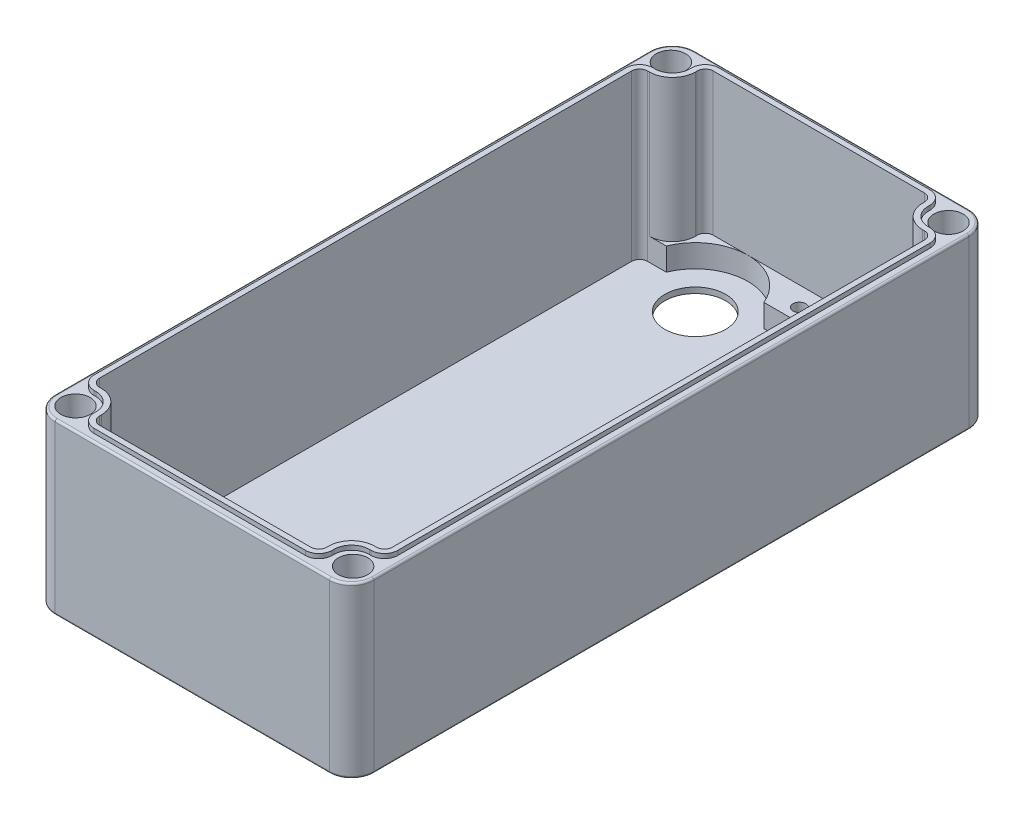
ISO-10303-21;
HEADER;
FILE_DESCRIPTION(('STEP AP214'),'2;1');
FILE_NAME('part.step','',(''),(''),'','','');
FILE_SCHEMA(('AUTOMOTIVE_DESIGN { 1 0 10303 214 1 1 1 1 }'));
ENDSEC;
DATA;
#1=APPLICATION_CONTEXT('core data for automotive mechanical design processes');
#2=APPLICATION_PROTOCOL_DEFINITION('international standard','automotive_design',2000,#1);
#3=PRODUCT_CONTEXT('',#1,'mechanical');
#4=PRODUCT('Part','Part','',(#3));
#5=PRODUCT_RELATED_PRODUCT_CATEGORY('part','',(#4));
#6=PRODUCT_DEFINITION_FORMATION('','',#4);
#7=PRODUCT_DEFINITION_CONTEXT('part definition',#1,'design');
#8=PRODUCT_DEFINITION('design','',#6,#7);
#9=PRODUCT_DEFINITION_SHAPE('','',#8);
#10=(LENGTH_UNIT() NAMED_UNIT(*) SI_UNIT(.MILLI.,.METRE.));
#11=(NAMED_UNIT(*) PLANE_ANGLE_UNIT() SI_UNIT($,.RADIAN.));
#12=(NAMED_UNIT(*) SI_UNIT($,.STERADIAN.) SOLID_ANGLE_UNIT());
#13=UNCERTAINTY_MEASURE_WITH_UNIT(LENGTH_MEASURE(1.E-05),#10,'distance_accuracy_value','');
#14=(GEOMETRIC_REPRESENTATION_CONTEXT(3) GLOBAL_UNCERTAINTY_ASSIGNED_CONTEXT((#13)) GLOBAL_UNIT_ASSIGNED_CONTEXT((#10,
#11,#12)) REPRESENTATION_CONTEXT('',''));
#15=CARTESIAN_POINT('',(0.,0.,0.));
#16=DIRECTION('',(0.,0.,1.));
#17=DIRECTION('',(1.,0.,0.));
#18=AXIS2_PLACEMENT_3D('',#15,#16,#17);
#19=CARTESIAN_POINT('',(0.,0.,81.28));
#20=DIRECTION('',(0.,1.,0.));
#21=DIRECTION('',(0.,0.,1.));
#22=AXIS2_PLACEMENT_3D('',#19,#20,#21);
#23=CYLINDRICAL_SURFACE('',#22,7.14375);
#24=CARTESIAN_POINT('',(0.,2.79399999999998,81.28));
#25=DIRECTION('',(0.,1.,0.));
#26=DIRECTION('',(0.,0.,1.));
#27=AXIS2_PLACEMENT_3D('',#24,#25,#26);
#28=CIRCLE('',#27,7.14375);
#29=CARTESIAN_POINT('',(0.,2.79399999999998,88.42375));
#30=VERTEX_POINT('',#29);
#31=EDGE_CURVE('E11',#30,#30,#28,.T.);
#32=ORIENTED_EDGE('',*,*,#31,.T.);
#33=EDGE_LOOP('',(#32));
#34=FACE_BOUND('',#33,.T.);
#35=CARTESIAN_POINT('',(0.,1.01599999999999,81.28));
#36=DIRECTION('',(0.,-1.,0.));
#37=DIRECTION('',(0.,0.,-1.));
#38=AXIS2_PLACEMENT_3D('',#35,#36,#37);
#39=CIRCLE('',#38,7.14375);
#40=CARTESIAN_POINT('',(0.,1.01599999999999,74.13625));
#41=VERTEX_POINT('',#40);
#42=EDGE_CURVE('E30',#41,#41,#39,.F.);
#43=ORIENTED_EDGE('',*,*,#42,.F.);
#44=EDGE_LOOP('',(#43));
#45=FACE_BOUND('',#44,.T.);
#46=ADVANCED_FACE('F26',(#34,#45),#23,.F.);
#47=CARTESIAN_POINT('',(-22.2250000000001,54.4830000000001,-79.6527));
#48=DIRECTION('',(0.,-1.,0.));
#49=DIRECTION('',(0.,0.,-1.));
#50=AXIS2_PLACEMENT_3D('',#47,#48,#49);
#51=CYLINDRICAL_SURFACE('',#50,9.525);
#52=CARTESIAN_POINT('',(-22.225,2.79400000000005,-79.6527));
#53=DIRECTION('',(0.,1.,0.));
#54=DIRECTION('',(0.,0.,1.));
#55=AXIS2_PLACEMENT_3D('',#52,#53,#54);
#56=CIRCLE('',#55,9.525);
#57=CARTESIAN_POINT('',(-22.225,2.79400000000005,-70.1277));
#58=VERTEX_POINT('',#57);
#59=EDGE_CURVE('E775',#58,#58,#56,.F.);
#60=ORIENTED_EDGE('',*,*,#59,.F.);
#61=EDGE_LOOP('',(#60));
#62=FACE_BOUND('',#61,.T.);
#63=CARTESIAN_POINT('',(-22.225,1.01600000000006,-79.6527));
#64=DIRECTION('',(0.,-1.,0.));
#65=DIRECTION('',(0.,0.,-1.));
#66=AXIS2_PLACEMENT_3D('',#63,#64,#65);
#67=CIRCLE('',#66,9.525);
#68=CARTESIAN_POINT('',(-22.225,1.01600000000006,-89.1777));
#69=VERTEX_POINT('',#68);
#70=EDGE_CURVE('E724',#69,#69,#67,.T.);
#71=ORIENTED_EDGE('',*,*,#70,.T.);
#72=EDGE_LOOP('',(#71));
#73=FACE_BOUND('',#72,.T.);
#74=ADVANCED_FACE('F1259',(#62,#73),#51,.F.);
#75=CARTESIAN_POINT('',(22.2249999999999,54.483,-79.6527000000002));
#76=DIRECTION('',(0.,-1.,0.));
#77=DIRECTION('',(0.,0.,-1.));
#78=AXIS2_PLACEMENT_3D('',#75,#76,#77);
#79=CYLINDRICAL_SURFACE('',#78,9.52500000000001);
#80=CARTESIAN_POINT('',(22.225,2.79399999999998,-79.6527000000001));
#81=DIRECTION('',(0.,1.,0.));
#82=DIRECTION('',(0.,0.,1.));
#83=AXIS2_PLACEMENT_3D('',#80,#81,#82);
#84=CIRCLE('',#83,9.52500000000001);
#85=CARTESIAN_POINT('',(22.225,2.79399999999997,-70.1277000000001));
#86=VERTEX_POINT('',#85);
#87=EDGE_CURVE('E778',#86,#86,#84,.F.);
#88=ORIENTED_EDGE('',*,*,#87,.F.);
#89=EDGE_LOOP('',(#88));
#90=FACE_BOUND('',#89,.T.);
#91=CARTESIAN_POINT('',(22.225,1.01599999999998,-79.6527000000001));
#92=DIRECTION('',(0.,-1.,0.));
#93=DIRECTION('',(0.,0.,-1.));
#94=AXIS2_PLACEMENT_3D('',#91,#92,#93);
#95=CIRCLE('',#94,9.52500000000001);
#96=CARTESIAN_POINT('',(22.225,1.01599999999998,-89.1777000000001));
#97=VERTEX_POINT('',#96);
#98=EDGE_CURVE('E720',#97,#97,#95,.T.);
#99=ORIENTED_EDGE('',*,*,#98,.T.);
#100=EDGE_LOOP('',(#99));
#101=FACE_BOUND('',#100,.T.);
#102=ADVANCED_FACE('F1265',(#90,#101),#79,.F.);
#103=CARTESIAN_POINT('',(43.38664,9.9059999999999,85.863));
#104=DIRECTION('',(0.,0.,1.));
#105=DIRECTION('',(1.,0.,0.));
#106=AXIS2_PLACEMENT_3D('',#103,#104,#105);
#107=PLANE('',#106);
#108=DIRECTION('',(1.,0.,0.));
#109=VECTOR('',#108,1.);
#110=CARTESIAN_POINT('',(-43.38664,2.79400000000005,85.863));
#111=LINE('',#110,#109);
#112=CARTESIAN_POINT('',(13.1968561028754,2.79399999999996,85.863));
#113=VERTEX_POINT('',#112);
#114=CARTESIAN_POINT('',(43.38664,2.7939999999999,85.863));
#115=VERTEX_POINT('',#114);
#116=EDGE_CURVE('E497',#113,#115,#111,.T.);
#117=ORIENTED_EDGE('',*,*,#116,.F.);
#118=DIRECTION('',(0.,1.,0.));
#119=VECTOR('',#118,1.);
#120=CARTESIAN_POINT('',(13.1968561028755,-36.7191269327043,85.863));
#121=LINE('',#120,#119);
#122=CARTESIAN_POINT('',(13.1968561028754,9.90599999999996,85.863));
#123=VERTEX_POINT('',#122);
#124=EDGE_CURVE('E476',#113,#123,#121,.T.);
#125=ORIENTED_EDGE('',*,*,#124,.T.);
#126=DIRECTION('',(1.,0.,0.));
#127=VECTOR('',#126,1.);
#128=CARTESIAN_POINT('',(43.38664,9.9059999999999,85.863));
#129=LINE('',#128,#127);
#130=CARTESIAN_POINT('',(42.84816,9.9059999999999,85.863));
#131=VERTEX_POINT('',#130);
#132=EDGE_CURVE('E557',#123,#131,#129,.T.);
#133=ORIENTED_EDGE('',*,*,#132,.T.);
#134=DIRECTION('',(0.,1.,0.));
#135=VECTOR('',#134,1.);
#136=CARTESIAN_POINT('',(42.84816,9.9059999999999,85.863));
#137=LINE('',#136,#135);
#138=CARTESIAN_POINT('',(42.8481599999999,54.4829999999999,85.863));
#139=VERTEX_POINT('',#138);
#140=EDGE_CURVE('E562',#131,#139,#137,.T.);
#141=ORIENTED_EDGE('',*,*,#140,.T.);
#142=DIRECTION('',(1.,0.,0.));
#143=VECTOR('',#142,1.);
#144=CARTESIAN_POINT('',(42.8481599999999,54.4829999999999,85.863));
#145=LINE('',#144,#143);
#146=CARTESIAN_POINT('',(43.3866399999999,54.4829999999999,85.863));
#147=VERTEX_POINT('',#146);
#148=EDGE_CURVE('E840',#139,#147,#145,.T.);
#149=ORIENTED_EDGE('',*,*,#148,.T.);
#150=DIRECTION('',(0.,1.,0.));
#151=VECTOR('',#150,1.);
#152=CARTESIAN_POINT('',(43.38664,9.9059999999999,85.863));
#153=LINE('',#152,#151);
#154=EDGE_CURVE('E560',#115,#147,#153,.T.);
#155=ORIENTED_EDGE('',*,*,#154,.F.);
#156=EDGE_LOOP('',(#117,#125,#133,#141,#149,#155));
#157=FACE_BOUND('',#156,.T.);
#158=ADVANCED_FACE('F1144',(#157),#107,.F.);
#159=CARTESIAN_POINT('',(43.38664,9.90599999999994,-83.36364));
#160=DIRECTION('',(0.,1.,0.));
#161=DIRECTION('',(0.,0.,1.));
#162=AXIS2_PLACEMENT_3D('',#159,#160,#161);
#163=PLANE('',#162);
#164=CARTESIAN_POINT('',(-22.225,9.90600000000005,-79.6527));
#165=DIRECTION('',(0.,1.,0.));
#166=DIRECTION('',(0.,0.,1.));
#167=AXIS2_PLACEMENT_3D('',#164,#165,#166);
#168=CIRCLE('',#167,16.4973);
#169=CARTESIAN_POINT('',(-6.94124780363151,9.90600000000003,-85.863));
#170=VERTEX_POINT('',#169);
#171=CARTESIAN_POINT('',(-22.225,9.90600000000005,-96.15));
#172=VERTEX_POINT('',#171);
#173=EDGE_CURVE('E757',#170,#172,#168,.T.);
#174=ORIENTED_EDGE('',*,*,#173,.F.);
#175=DIRECTION('',(-1.,0.,0.));
#176=VECTOR('',#175,1.);
#177=CARTESIAN_POINT('',(43.38664,9.90599999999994,-85.863));
#178=LINE('',#177,#176);
#179=CARTESIAN_POINT('',(6.94124780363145,9.90600000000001,-85.863));
#180=VERTEX_POINT('',#179);
#181=EDGE_CURVE('E609',#180,#170,#178,.T.);
#182=ORIENTED_EDGE('',*,*,#181,.F.);
#183=CARTESIAN_POINT('',(22.225,9.90599999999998,-79.6527000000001));
#184=DIRECTION('',(0.,1.,0.));
#185=DIRECTION('',(0.,0.,1.));
#186=AXIS2_PLACEMENT_3D('',#183,#184,#185);
#187=CIRCLE('',#186,16.4973);
#188=CARTESIAN_POINT('',(22.225,9.90599999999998,-96.1500000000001));
#189=VERTEX_POINT('',#188);
#190=EDGE_CURVE('E767',#189,#180,#187,.T.);
#191=ORIENTED_EDGE('',*,*,#190,.F.);
#192=DIRECTION('',(-1.,0.,0.));
#193=VECTOR('',#192,1.);
#194=CARTESIAN_POINT('',(33.09964,9.90599999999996,-96.15));
#195=LINE('',#194,#193);
#196=EDGE_CURVE('E524',#189,#172,#195,.T.);
#197=ORIENTED_EDGE('',*,*,#196,.T.);
#198=EDGE_LOOP('',(#174,#182,#191,#197));
#199=FACE_BOUND('',#198,.T.);
#200=CARTESIAN_POINT('',(0.,9.90600000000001,-90.07475));
#201=DIRECTION('',(0.,1.,0.));
#202=DIRECTION('',(0.,0.,1.));
#203=AXIS2_PLACEMENT_3D('',#200,#201,#202);
#204=CIRCLE('',#203,2.00000000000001);
#205=CARTESIAN_POINT('',(0.,9.90600000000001,-88.07475));
#206=VERTEX_POINT('',#205);
#207=EDGE_CURVE('E1106',#206,#206,#204,.T.);
#208=ORIENTED_EDGE('',*,*,#207,.F.);
#209=EDGE_LOOP('',(#208));
#210=FACE_BOUND('',#209,.T.);
#211=ADVANCED_FACE('F1210',(#199,#210),#163,.T.);
#212=CARTESIAN_POINT('',(37.5087521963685,9.90599999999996,-85.863));
#213=VERTEX_POINT('',#212);
#214=EDGE_CURVE('E768',#213,#189,#187,.T.);
#215=ORIENTED_EDGE('',*,*,#214,.F.);
#216=CARTESIAN_POINT('',(42.84816,9.90599999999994,-85.863));
#217=VERTEX_POINT('',#216);
#218=EDGE_CURVE('E605',#217,#213,#178,.T.);
#219=ORIENTED_EDGE('',*,*,#218,.F.);
#220=CARTESIAN_POINT('',(42.84816,9.90599999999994,-93.11216));
#221=DIRECTION('',(0.,-1.,0.));
#222=DIRECTION('',(0.,0.,-1.));
#223=AXIS2_PLACEMENT_3D('',#220,#221,#222);
#224=CIRCLE('',#223,7.24916);
#225=CARTESIAN_POINT('',(35.599,9.90599999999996,-93.11216));
#226=VERTEX_POINT('',#225);
#227=EDGE_CURVE('E510',#217,#226,#224,.T.);
#228=ORIENTED_EDGE('',*,*,#227,.T.);
#229=DIRECTION('',(0.,0.,-1.));
#230=VECTOR('',#229,1.);
#231=CARTESIAN_POINT('',(35.599,9.90599999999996,-93.65064));
#232=LINE('',#231,#230);
#233=CARTESIAN_POINT('',(35.5989999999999,9.90599999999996,-93.65064));
#234=VERTEX_POINT('',#233);
#235=EDGE_CURVE('E513',#226,#234,#232,.T.);
#236=ORIENTED_EDGE('',*,*,#235,.T.);
#237=CARTESIAN_POINT('',(33.09964,9.90599999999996,-93.65064));
#238=DIRECTION('',(0.,1.,0.));
#239=DIRECTION('',(0.,0.,-1.));
#240=AXIS2_PLACEMENT_3D('',#237,#238,#239);
#241=CIRCLE('',#240,2.49935999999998);
#242=CARTESIAN_POINT('',(33.09964,9.90599999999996,-96.15));
#243=VERTEX_POINT('',#242);
#244=EDGE_CURVE('E516',#234,#243,#241,.T.);
#245=ORIENTED_EDGE('',*,*,#244,.T.);
#246=EDGE_CURVE('E520',#243,#189,#195,.T.);
#247=ORIENTED_EDGE('',*,*,#246,.T.);
#248=EDGE_LOOP('',(#215,#219,#228,#236,#245,#247));
#249=FACE_BOUND('',#248,.T.);
#250=ADVANCED_FACE('F1171',(#249),#163,.T.);
#251=CARTESIAN_POINT('',(-49.95,0.,100.2));
#252=DIRECTION('',(0.,1.,0.));
#253=DIRECTION('',(0.,0.,1.));
#254=AXIS2_PLACEMENT_3D('',#251,#252,#253);
#255=PLANE('',#254);
#256=CARTESIAN_POINT('',(0.,0.,81.28));
#257=DIRECTION('',(0.,-1.,0.));
#258=DIRECTION('',(0.,0.,-1.));
#259=AXIS2_PLACEMENT_3D('',#256,#257,#258);
#260=CIRCLE('',#259,12.7);
#261=CARTESIAN_POINT('',(0.,0.,68.58));
#262=VERTEX_POINT('',#261);
#263=EDGE_CURVE('E1824',#262,#262,#260,.T.);
#264=ORIENTED_EDGE('',*,*,#263,.F.);
#265=EDGE_LOOP('',(#264));
#266=FACE_BOUND('',#265,.T.);
#267=CARTESIAN_POINT('',(-22.225,0.,-79.6527));
#268=DIRECTION('',(0.,-1.,0.));
#269=DIRECTION('',(0.,0.,-1.));
#270=AXIS2_PLACEMENT_3D('',#267,#268,#269);
#271=CIRCLE('',#270,15.24);
#272=CARTESIAN_POINT('',(-22.225,0.,-94.8927));
#273=VERTEX_POINT('',#272);
#274=EDGE_CURVE('E733',#273,#273,#271,.T.);
#275=ORIENTED_EDGE('',*,*,#274,.F.);
#276=EDGE_LOOP('',(#275));
#277=FACE_BOUND('',#276,.T.);
#278=CARTESIAN_POINT('',(22.225,0.,-79.6527000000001));
#279=DIRECTION('',(0.,-1.,0.));
#280=DIRECTION('',(0.,0.,-1.));
#281=AXIS2_PLACEMENT_3D('',#278,#279,#280);
#282=CIRCLE('',#281,15.24);
#283=CARTESIAN_POINT('',(22.225,0.,-94.8927000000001));
#284=VERTEX_POINT('',#283);
#285=EDGE_CURVE('E726',#284,#284,#282,.T.);
#286=ORIENTED_EDGE('',*,*,#285,.F.);
#287=EDGE_LOOP('',(#286));
#288=FACE_BOUND('',#287,.T.);
#289=CARTESIAN_POINT('',(-27.94,0.,66.802));
#290=DIRECTION('',(0.,1.,0.));
#291=DIRECTION('',(0.,0.,1.));
#292=AXIS2_PLACEMENT_3D('',#289,#290,#291);
#293=CIRCLE('',#292,11.1125);
#294=CARTESIAN_POINT('',(-27.94,0.,77.9145));
#295=VERTEX_POINT('',#294);
#296=EDGE_CURVE('E745',#295,#295,#293,.T.);
#297=ORIENTED_EDGE('',*,*,#296,.T.);
#298=EDGE_LOOP('',(#297));
#299=FACE_BOUND('',#298,.T.);
#300=CARTESIAN_POINT('',(27.94,0.,66.802));
#301=DIRECTION('',(0.,1.,0.));
#302=DIRECTION('',(0.,0.,1.));
#303=AXIS2_PLACEMENT_3D('',#300,#301,#302);
#304=CIRCLE('',#303,11.1125);
#305=CARTESIAN_POINT('',(27.94,0.,77.9145));
#306=VERTEX_POINT('',#305);
#307=EDGE_CURVE('E751',#306,#306,#304,.T.);
#308=ORIENTED_EDGE('',*,*,#307,.T.);
#309=EDGE_LOOP('',(#308));
#310=FACE_BOUND('',#309,.T.);
#311=CARTESIAN_POINT('',(42.95,0.,93.2));
#312=DIRECTION('',(0.,1.,0.));
#313=DIRECTION('',(0.,0.,1.));
#314=AXIS2_PLACEMENT_3D('',#311,#312,#313);
#315=CIRCLE('',#314,6.365);
#316=CARTESIAN_POINT('',(49.315,-1.04083408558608E-13,93.2));
#317=VERTEX_POINT('',#316);
#318=CARTESIAN_POINT('',(42.95,0.,99.565));
#319=VERTEX_POINT('',#318);
#320=EDGE_CURVE('E670',#317,#319,#315,.F.);
#321=ORIENTED_EDGE('',*,*,#320,.T.);
#322=DIRECTION('',(1.,0.,0.));
#323=VECTOR('',#322,1.);
#324=CARTESIAN_POINT('',(-49.95,0.,99.565));
#325=LINE('',#324,#323);
#326=CARTESIAN_POINT('',(-42.95,0.,99.565));
#327=VERTEX_POINT('',#326);
#328=EDGE_CURVE('E672',#319,#327,#325,.F.);
#329=ORIENTED_EDGE('',*,*,#328,.T.);
#330=CARTESIAN_POINT('',(-42.95,0.,93.2));
#331=DIRECTION('',(0.,1.,0.));
#332=DIRECTION('',(0.,0.,1.));
#333=AXIS2_PLACEMENT_3D('',#330,#331,#332);
#334=CIRCLE('',#333,6.365);
#335=CARTESIAN_POINT('',(-49.315,0.,93.2));
#336=VERTEX_POINT('',#335);
#337=EDGE_CURVE('E668',#327,#336,#334,.F.);
#338=ORIENTED_EDGE('',*,*,#337,.T.);
#339=DIRECTION('',(0.,0.,1.));
#340=VECTOR('',#339,1.);
#341=CARTESIAN_POINT('',(-49.315,0.,100.2));
#342=LINE('',#341,#340);
#343=CARTESIAN_POINT('',(-49.315,0.,-93.2));
#344=VERTEX_POINT('',#343);
#345=EDGE_CURVE('E666',#336,#344,#342,.F.);
#346=ORIENTED_EDGE('',*,*,#345,.T.);
#347=CARTESIAN_POINT('',(-42.95,0.,-93.2));
#348=DIRECTION('',(0.,1.,0.));
#349=DIRECTION('',(0.,0.,1.));
#350=AXIS2_PLACEMENT_3D('',#347,#348,#349);
#351=CIRCLE('',#350,6.365);
#352=CARTESIAN_POINT('',(-42.95,0.,-99.565));
#353=VERTEX_POINT('',#352);
#354=EDGE_CURVE('E664',#344,#353,#351,.F.);
#355=ORIENTED_EDGE('',*,*,#354,.T.);
#356=DIRECTION('',(-1.,0.,0.));
#357=VECTOR('',#356,1.);
#358=CARTESIAN_POINT('',(-49.95,1.04083408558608E-13,-99.565));
#359=LINE('',#358,#357);
#360=CARTESIAN_POINT('',(42.95,0.,-99.565));
#361=VERTEX_POINT('',#360);
#362=EDGE_CURVE('E662',#353,#361,#359,.F.);
#363=ORIENTED_EDGE('',*,*,#362,.T.);
#364=CARTESIAN_POINT('',(42.95,0.,-93.2));
#365=DIRECTION('',(0.,1.,0.));
#366=DIRECTION('',(0.,0.,1.));
#367=AXIS2_PLACEMENT_3D('',#364,#365,#366);
#368=CIRCLE('',#367,6.365);
#369=CARTESIAN_POINT('',(49.315,0.,-93.2));
#370=VERTEX_POINT('',#369);
#371=EDGE_CURVE('E660',#361,#370,#368,.F.);
#372=ORIENTED_EDGE('',*,*,#371,.T.);
#373=DIRECTION('',(0.,0.,-1.));
#374=VECTOR('',#373,1.);
#375=CARTESIAN_POINT('',(49.315,-1.11022302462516E-13,100.2));
#376=LINE('',#375,#374);
#377=EDGE_CURVE('E658',#370,#317,#376,.F.);
#378=ORIENTED_EDGE('',*,*,#377,.T.);
#379=EDGE_LOOP('',(#321,#329,#338,#346,#355,#363,#372,#378));
#380=FACE_BOUND('',#379,.T.);
#381=CARTESIAN_POINT('',(-43.4975,0.,-93.2934507));
#382=DIRECTION('',(0.,1.,0.));
#383=DIRECTION('',(0.,0.,-1.));
#384=AXIS2_PLACEMENT_3D('',#381,#382,#383);
#385=CIRCLE('',#384,4.0132);
#386=CARTESIAN_POINT('',(-43.4975,0.,-97.3066507));
#387=VERTEX_POINT('',#386);
#388=EDGE_CURVE('E637',#387,#387,#385,.T.);
#389=ORIENTED_EDGE('',*,*,#388,.T.);
#390=EDGE_LOOP('',(#389));
#391=FACE_BOUND('',#390,.T.);
#392=CARTESIAN_POINT('',(-43.4975,0.,93.2934507));
#393=DIRECTION('',(0.,1.,0.));
#394=DIRECTION('',(0.,0.,1.));
#395=AXIS2_PLACEMENT_3D('',#392,#393,#394);
#396=CIRCLE('',#395,4.0132);
#397=CARTESIAN_POINT('',(-43.4975,0.,97.3066507));
#398=VERTEX_POINT('',#397);
#399=EDGE_CURVE('E1085',#398,#398,#396,.T.);
#400=ORIENTED_EDGE('',*,*,#399,.T.);
#401=EDGE_LOOP('',(#400));
#402=FACE_BOUND('',#401,.T.);
#403=CARTESIAN_POINT('',(43.4975,0.,93.2934507));
#404=DIRECTION('',(0.,1.,0.));
#405=DIRECTION('',(0.,0.,-1.));
#406=AXIS2_PLACEMENT_3D('',#403,#404,#405);
#407=CIRCLE('',#406,4.0132);
#408=CARTESIAN_POINT('',(43.4975,0.,89.2802507));
#409=VERTEX_POINT('',#408);
#410=EDGE_CURVE('E1088',#409,#409,#407,.T.);
#411=ORIENTED_EDGE('',*,*,#410,.T.);
#412=EDGE_LOOP('',(#411));
#413=FACE_BOUND('',#412,.T.);
#414=CARTESIAN_POINT('',(43.4975,0.,-93.2934507));
#415=DIRECTION('',(0.,1.,0.));
#416=DIRECTION('',(0.,0.,1.));
#417=AXIS2_PLACEMENT_3D('',#414,#415,#416);
#418=CIRCLE('',#417,4.0132);
#419=CARTESIAN_POINT('',(43.4975,0.,-89.2802507));
#420=VERTEX_POINT('',#419);
#421=EDGE_CURVE('E1091',#420,#420,#418,.T.);
#422=ORIENTED_EDGE('',*,*,#421,.T.);
#423=EDGE_LOOP('',(#422));
#424=FACE_BOUND('',#423,.T.);
#425=ADVANCED_FACE('F28',(#266,#277,#288,#299,#310,#380,#391,#402,#413,#424),#255,.F.);
#426=CARTESIAN_POINT('',(-37.5087521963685,9.90600000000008,-85.863));
#427=VERTEX_POINT('',#426);
#428=EDGE_CURVE('E756',#172,#427,#168,.T.);
#429=ORIENTED_EDGE('',*,*,#428,.F.);
#430=CARTESIAN_POINT('',(-33.09964,9.90600000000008,-96.15));
#431=VERTEX_POINT('',#430);
#432=EDGE_CURVE('E519',#172,#431,#195,.T.);
#433=ORIENTED_EDGE('',*,*,#432,.T.);
#434=CARTESIAN_POINT('',(-33.09964,9.90600000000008,-93.65064));
#435=DIRECTION('',(0.,1.,0.));
#436=DIRECTION('',(0.,0.,1.));
#437=AXIS2_PLACEMENT_3D('',#434,#435,#436);
#438=CIRCLE('',#437,2.49935999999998);
#439=CARTESIAN_POINT('',(-35.599,9.90600000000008,-93.65064));
#440=VERTEX_POINT('',#439);
#441=EDGE_CURVE('E523',#431,#440,#438,.T.);
#442=ORIENTED_EDGE('',*,*,#441,.T.);
#443=DIRECTION('',(0.,0.,1.));
#444=VECTOR('',#443,1.);
#445=CARTESIAN_POINT('',(-35.599,9.90600000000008,-93.65064));
#446=LINE('',#445,#444);
#447=CARTESIAN_POINT('',(-35.599,9.90600000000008,-93.11216));
#448=VERTEX_POINT('',#447);
#449=EDGE_CURVE('E527',#440,#448,#446,.T.);
#450=ORIENTED_EDGE('',*,*,#449,.T.);
#451=CARTESIAN_POINT('',(-42.84816,9.90600000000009,-93.11216));
#452=DIRECTION('',(0.,-1.,0.));
#453=DIRECTION('',(0.,0.,1.));
#454=AXIS2_PLACEMENT_3D('',#451,#452,#453);
#455=CIRCLE('',#454,7.24916);
#456=CARTESIAN_POINT('',(-42.84816,9.90600000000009,-85.863));
#457=VERTEX_POINT('',#456);
#458=EDGE_CURVE('E530',#448,#457,#455,.T.);
#459=ORIENTED_EDGE('',*,*,#458,.T.);
#460=EDGE_CURVE('E604',#427,#457,#178,.T.);
#461=ORIENTED_EDGE('',*,*,#460,.F.);
#462=EDGE_LOOP('',(#429,#433,#442,#450,#459,#461));
#463=FACE_BOUND('',#462,.T.);
#464=ADVANCED_FACE('F1184',(#463),#163,.T.);
#465=CARTESIAN_POINT('',(-43.38664,9.90600000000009,-85.863));
#466=DIRECTION('',(0.,0.,-1.));
#467=DIRECTION('',(-1.,0.,0.));
#468=AXIS2_PLACEMENT_3D('',#465,#466,#467);
#469=PLANE('',#468);
#470=ORIENTED_EDGE('',*,*,#181,.T.);
#471=DIRECTION('',(0.,1.,0.));
#472=VECTOR('',#471,1.);
#473=CARTESIAN_POINT('',(-6.94124780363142,-43.8674108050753,-85.863));
#474=LINE('',#473,#472);
#475=CARTESIAN_POINT('',(-6.94124780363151,2.79400000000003,-85.863));
#476=VERTEX_POINT('',#475);
#477=EDGE_CURVE('E764',#170,#476,#474,.F.);
#478=ORIENTED_EDGE('',*,*,#477,.T.);
#479=DIRECTION('',(-1.,0.,0.));
#480=VECTOR('',#479,1.);
#481=CARTESIAN_POINT('',(-42.84816,2.79400000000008,-85.863));
#482=LINE('',#481,#480);
#483=CARTESIAN_POINT('',(6.94124780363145,2.794,-85.863));
#484=VERTEX_POINT('',#483);
#485=EDGE_CURVE('E1117',#484,#476,#482,.T.);
#486=ORIENTED_EDGE('',*,*,#485,.F.);
#487=DIRECTION('',(0.,1.,0.));
#488=VECTOR('',#487,1.);
#489=CARTESIAN_POINT('',(6.94124780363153,-43.8674108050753,-85.863));
#490=LINE('',#489,#488);
#491=EDGE_CURVE('E772',#484,#180,#490,.T.);
#492=ORIENTED_EDGE('',*,*,#491,.T.);
#493=EDGE_LOOP('',(#470,#478,#486,#492));
#494=FACE_BOUND('',#493,.T.);
#495=ADVANCED_FACE('F1209',(#494),#469,.F.);
#496=CARTESIAN_POINT('',(-37.5087521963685,2.79400000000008,-85.863));
#497=VERTEX_POINT('',#496);
#498=CARTESIAN_POINT('',(-43.38664,2.79400000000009,-85.863));
#499=VERTEX_POINT('',#498);
#500=EDGE_CURVE('E1112',#497,#499,#482,.T.);
#501=ORIENTED_EDGE('',*,*,#500,.F.);
#502=DIRECTION('',(0.,1.,0.));
#503=VECTOR('',#502,1.);
#504=CARTESIAN_POINT('',(-37.5087521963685,-43.8674108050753,-85.863));
#505=LINE('',#504,#503);
#506=EDGE_CURVE('E761',#497,#427,#505,.T.);
#507=ORIENTED_EDGE('',*,*,#506,.T.);
#508=ORIENTED_EDGE('',*,*,#460,.T.);
#509=DIRECTION('',(0.,1.,0.));
#510=VECTOR('',#509,1.);
#511=CARTESIAN_POINT('',(-42.84816,9.90600000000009,-85.863));
#512=LINE('',#511,#510);
#513=CARTESIAN_POINT('',(-42.8481600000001,54.4830000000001,-85.8630000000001));
#514=VERTEX_POINT('',#513);
#515=EDGE_CURVE('E586',#457,#514,#512,.T.);
#516=ORIENTED_EDGE('',*,*,#515,.T.);
#517=DIRECTION('',(-1.,0.,0.));
#518=VECTOR('',#517,1.);
#519=CARTESIAN_POINT('',(-42.8481600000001,54.4830000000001,-85.8630000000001));
#520=LINE('',#519,#518);
#521=CARTESIAN_POINT('',(-43.3866400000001,54.4830000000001,-85.8630000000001));
#522=VERTEX_POINT('',#521);
#523=EDGE_CURVE('E876',#514,#522,#520,.T.);
#524=ORIENTED_EDGE('',*,*,#523,.T.);
#525=DIRECTION('',(0.,1.,0.));
#526=VECTOR('',#525,1.);
#527=CARTESIAN_POINT('',(-43.38664,9.90600000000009,-85.863));
#528=LINE('',#527,#526);
#529=EDGE_CURVE('E584',#499,#522,#528,.T.);
#530=ORIENTED_EDGE('',*,*,#529,.F.);
#531=EDGE_LOOP('',(#501,#507,#508,#516,#524,#530));
#532=FACE_BOUND('',#531,.T.);
#533=ADVANCED_FACE('F1203',(#532),#469,.F.);
#534=ORIENTED_EDGE('',*,*,#218,.T.);
#535=DIRECTION('',(0.,1.,0.));
#536=VECTOR('',#535,1.);
#537=CARTESIAN_POINT('',(37.5087521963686,-43.8674108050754,-85.863));
#538=LINE('',#537,#536);
#539=CARTESIAN_POINT('',(37.5087521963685,2.79399999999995,-85.863));
#540=VERTEX_POINT('',#539);
#541=EDGE_CURVE('E35',#213,#540,#538,.F.);
#542=ORIENTED_EDGE('',*,*,#541,.T.);
#543=CARTESIAN_POINT('',(43.38664,2.79399999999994,-85.863));
#544=VERTEX_POINT('',#543);
#545=EDGE_CURVE('E1113',#544,#540,#482,.T.);
#546=ORIENTED_EDGE('',*,*,#545,.F.);
#547=DIRECTION('',(0.,1.,0.));
#548=VECTOR('',#547,1.);
#549=CARTESIAN_POINT('',(43.38664,9.90599999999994,-85.863));
#550=LINE('',#549,#548);
#551=CARTESIAN_POINT('',(43.3866399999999,54.483,-85.8630000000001));
#552=VERTEX_POINT('',#551);
#553=EDGE_CURVE('E554',#544,#552,#550,.T.);
#554=ORIENTED_EDGE('',*,*,#553,.T.);
#555=DIRECTION('',(-1.,0.,0.));
#556=VECTOR('',#555,1.);
#557=CARTESIAN_POINT('',(43.3866399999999,54.483,-85.8630000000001));
#558=LINE('',#557,#556);
#559=CARTESIAN_POINT('',(42.8481599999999,54.483,-85.8630000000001));
#560=VERTEX_POINT('',#559);
#561=EDGE_CURVE('E852',#552,#560,#558,.T.);
#562=ORIENTED_EDGE('',*,*,#561,.T.);
#563=DIRECTION('',(0.,1.,0.));
#564=VECTOR('',#563,1.);
#565=CARTESIAN_POINT('',(42.84816,9.90599999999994,-85.863));
#566=LINE('',#565,#564);
#567=EDGE_CURVE('E600',#217,#560,#566,.T.);
#568=ORIENTED_EDGE('',*,*,#567,.F.);
#569=EDGE_LOOP('',(#534,#542,#546,#554,#562,#568));
#570=FACE_BOUND('',#569,.T.);
#571=ADVANCED_FACE('F1164',(#570),#469,.F.);
#572=CARTESIAN_POINT('',(49.9499999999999,53.0859999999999,-100.2));
#573=DIRECTION('',(0.,1.,0.));
#574=DIRECTION('',(0.,0.,1.));
#575=AXIS2_PLACEMENT_3D('',#572,#573,#574);
#576=PLANE('',#575);
#577=CARTESIAN_POINT('',(42.9499999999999,53.0859999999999,93.2));
#578=DIRECTION('',(0.,1.,0.));
#579=DIRECTION('',(0.,0.,1.));
#580=AXIS2_PLACEMENT_3D('',#577,#578,#579);
#581=CIRCLE('',#580,6.365);
#582=CARTESIAN_POINT('',(42.9499999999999,53.0859999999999,99.565));
#583=VERTEX_POINT('',#582);
#584=CARTESIAN_POINT('',(49.3149999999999,53.0859999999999,93.2));
#585=VERTEX_POINT('',#584);
#586=EDGE_CURVE('E43',#583,#585,#581,.T.);
#587=ORIENTED_EDGE('',*,*,#586,.T.);
#588=DIRECTION('',(0.,0.,-1.));
#589=VECTOR('',#588,1.);
#590=CARTESIAN_POINT('',(49.3149999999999,53.0859999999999,-93.2000000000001));
#591=LINE('',#590,#589);
#592=CARTESIAN_POINT('',(49.3149999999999,53.0859999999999,-93.2000000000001));
#593=VERTEX_POINT('',#592);
#594=EDGE_CURVE('E716',#585,#593,#591,.T.);
#595=ORIENTED_EDGE('',*,*,#594,.T.);
#596=CARTESIAN_POINT('',(42.9499999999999,53.086,-93.2000000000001));
#597=DIRECTION('',(0.,1.,0.));
#598=DIRECTION('',(0.,0.,1.));
#599=AXIS2_PLACEMENT_3D('',#596,#597,#598);
#600=CIRCLE('',#599,6.365);
#601=CARTESIAN_POINT('',(42.9499999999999,53.086,-99.5650000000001));
#602=VERTEX_POINT('',#601);
#603=EDGE_CURVE('E704',#593,#602,#600,.T.);
#604=ORIENTED_EDGE('',*,*,#603,.T.);
#605=DIRECTION('',(-1.,0.,0.));
#606=VECTOR('',#605,1.);
#607=CARTESIAN_POINT('',(-42.9500000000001,53.0860000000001,-99.5650000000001));
#608=LINE('',#607,#606);
#609=CARTESIAN_POINT('',(-42.9500000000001,53.0860000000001,-99.5650000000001));
#610=VERTEX_POINT('',#609);
#611=EDGE_CURVE('E706',#602,#610,#608,.T.);
#612=ORIENTED_EDGE('',*,*,#611,.T.);
#613=CARTESIAN_POINT('',(-42.9500000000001,53.0860000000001,-93.2000000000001));
#614=DIRECTION('',(0.,1.,0.));
#615=DIRECTION('',(0.,0.,1.));
#616=AXIS2_PLACEMENT_3D('',#613,#614,#615);
#617=CIRCLE('',#616,6.365);
#618=CARTESIAN_POINT('',(-49.3150000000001,53.0860000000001,-93.2000000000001));
#619=VERTEX_POINT('',#618);
#620=EDGE_CURVE('E708',#610,#619,#617,.T.);
#621=ORIENTED_EDGE('',*,*,#620,.T.);
#622=DIRECTION('',(0.,0.,1.));
#623=VECTOR('',#622,1.);
#624=CARTESIAN_POINT('',(-49.3150000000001,53.086,93.1999999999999));
#625=LINE('',#624,#623);
#626=CARTESIAN_POINT('',(-49.3150000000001,53.086,93.1999999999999));
#627=VERTEX_POINT('',#626);
#628=EDGE_CURVE('E710',#619,#627,#625,.T.);
#629=ORIENTED_EDGE('',*,*,#628,.T.);
#630=CARTESIAN_POINT('',(-42.9500000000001,53.086,93.1999999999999));
#631=DIRECTION('',(0.,1.,0.));
#632=DIRECTION('',(0.,0.,1.));
#633=AXIS2_PLACEMENT_3D('',#630,#631,#632);
#634=CIRCLE('',#633,6.365);
#635=CARTESIAN_POINT('',(-42.9500000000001,53.086,99.565));
#636=VERTEX_POINT('',#635);
#637=EDGE_CURVE('E712',#627,#636,#634,.T.);
#638=ORIENTED_EDGE('',*,*,#637,.T.);
#639=DIRECTION('',(1.,0.,0.));
#640=VECTOR('',#639,1.);
#641=CARTESIAN_POINT('',(42.9499999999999,53.0859999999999,99.565));
#642=LINE('',#641,#640);
#643=EDGE_CURVE('E48',#636,#583,#642,.T.);
#644=ORIENTED_EDGE('',*,*,#643,.T.);
#645=EDGE_LOOP('',(#587,#595,#604,#612,#621,#629,#638,#644));
#646=FACE_BOUND('',#645,.T.);
#647=CARTESIAN_POINT('',(43.4974999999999,53.086,-93.2934507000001));
#648=DIRECTION('',(0.,1.,0.));
#649=DIRECTION('',(0.,0.,1.));
#650=AXIS2_PLACEMENT_3D('',#647,#648,#649);
#651=CIRCLE('',#650,4.5974);
#652=CARTESIAN_POINT('',(43.4974999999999,53.086,-88.6960507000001));
#653=VERTEX_POINT('',#652);
#654=EDGE_CURVE('E642',#653,#653,#651,.T.);
#655=ORIENTED_EDGE('',*,*,#654,.F.);
#656=EDGE_LOOP('',(#655));
#657=FACE_BOUND('',#656,.T.);
#658=CARTESIAN_POINT('',(43.4974999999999,53.0859999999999,93.2934507));
#659=DIRECTION('',(0.,1.,0.));
#660=DIRECTION('',(0.,0.,-1.));
#661=AXIS2_PLACEMENT_3D('',#658,#659,#660);
#662=CIRCLE('',#661,4.5974);
#663=CARTESIAN_POINT('',(43.4974999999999,53.0859999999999,88.6960507));
#664=VERTEX_POINT('',#663);
#665=EDGE_CURVE('E647',#664,#664,#662,.T.);
#666=ORIENTED_EDGE('',*,*,#665,.F.);
#667=EDGE_LOOP('',(#666));
#668=FACE_BOUND('',#667,.T.);
#669=CARTESIAN_POINT('',(-43.4975000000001,53.086,93.2934506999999));
#670=DIRECTION('',(0.,1.,0.));
#671=DIRECTION('',(0.,0.,1.));
#672=AXIS2_PLACEMENT_3D('',#669,#670,#671);
#673=CIRCLE('',#672,4.5974);
#674=CARTESIAN_POINT('',(-43.4975000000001,53.086,97.8908506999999));
#675=VERTEX_POINT('',#674);
#676=EDGE_CURVE('E652',#675,#675,#673,.T.);
#677=ORIENTED_EDGE('',*,*,#676,.F.);
#678=EDGE_LOOP('',(#677));
#679=FACE_BOUND('',#678,.T.);
#680=CARTESIAN_POINT('',(-43.4975000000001,53.0860000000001,-93.2934507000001));
#681=DIRECTION('',(0.,1.,0.));
#682=DIRECTION('',(0.,0.,-1.));
#683=AXIS2_PLACEMENT_3D('',#680,#681,#682);
#684=CIRCLE('',#683,4.5974);
#685=CARTESIAN_POINT('',(-43.4975000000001,53.0860000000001,-97.8908507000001));
#686=VERTEX_POINT('',#685);
#687=EDGE_CURVE('E1066',#686,#686,#684,.T.);
#688=ORIENTED_EDGE('',*,*,#687,.F.);
#689=EDGE_LOOP('',(#688));
#690=FACE_BOUND('',#689,.T.);
#691=DIRECTION('',(0.,0.,1.));
#692=VECTOR('',#691,1.);
#693=CARTESIAN_POINT('',(-37.3008000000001,53.086,93.1121600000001));
#694=LINE('',#693,#692);
#695=CARTESIAN_POINT('',(-37.3008000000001,53.086,93.1121600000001));
#696=VERTEX_POINT('',#695);
#697=CARTESIAN_POINT('',(-37.3008,53.086,93.6506400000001));
#698=VERTEX_POINT('',#697);
#699=EDGE_CURVE('E900',#696,#698,#694,.T.);
#700=ORIENTED_EDGE('',*,*,#699,.F.);
#701=CARTESIAN_POINT('',(-42.84816,53.086,93.1121599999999));
#702=DIRECTION('',(0.,-1.,0.));
#703=DIRECTION('',(0.,0.,1.));
#704=AXIS2_PLACEMENT_3D('',#701,#702,#703);
#705=CIRCLE('',#704,5.54736);
#706=CARTESIAN_POINT('',(-42.84816,53.086,87.5647999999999));
#707=VERTEX_POINT('',#706);
#708=EDGE_CURVE('E897',#707,#696,#705,.T.);
#709=ORIENTED_EDGE('',*,*,#708,.F.);
#710=DIRECTION('',(1.,0.,0.));
#711=VECTOR('',#710,1.);
#712=CARTESIAN_POINT('',(-43.3866400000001,53.086,87.5647999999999));
#713=LINE('',#712,#711);
#714=CARTESIAN_POINT('',(-43.38664,53.086,87.5647999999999));
#715=VERTEX_POINT('',#714);
#716=EDGE_CURVE('E945',#715,#707,#713,.T.);
#717=ORIENTED_EDGE('',*,*,#716,.F.);
#718=CARTESIAN_POINT('',(-43.3866400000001,53.086,83.3636399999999));
#719=DIRECTION('',(0.,1.,0.));
#720=DIRECTION('',(0.,0.,1.));
#721=AXIS2_PLACEMENT_3D('',#718,#719,#720);
#722=CIRCLE('',#721,4.20116000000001);
#723=CARTESIAN_POINT('',(-47.5878000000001,53.086,83.3636399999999));
#724=VERTEX_POINT('',#723);
#725=EDGE_CURVE('E942',#724,#715,#722,.T.);
#726=ORIENTED_EDGE('',*,*,#725,.F.);
#727=DIRECTION('',(0.,0.,1.));
#728=VECTOR('',#727,1.);
#729=CARTESIAN_POINT('',(-47.5878000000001,53.0860000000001,-83.3636400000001));
#730=LINE('',#729,#728);
#731=CARTESIAN_POINT('',(-47.5878000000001,53.0860000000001,-83.3636400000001));
#732=VERTEX_POINT('',#731);
#733=EDGE_CURVE('E940',#732,#724,#730,.T.);
#734=ORIENTED_EDGE('',*,*,#733,.F.);
#735=CARTESIAN_POINT('',(-43.3866400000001,53.0860000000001,-83.3636400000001));
#736=DIRECTION('',(0.,1.,0.));
#737=DIRECTION('',(0.,0.,1.));
#738=AXIS2_PLACEMENT_3D('',#735,#736,#737);
#739=CIRCLE('',#738,4.20116000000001);
#740=CARTESIAN_POINT('',(-43.3866400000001,53.0860000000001,-87.5648000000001));
#741=VERTEX_POINT('',#740);
#742=EDGE_CURVE('E938',#741,#732,#739,.T.);
#743=ORIENTED_EDGE('',*,*,#742,.F.);
#744=DIRECTION('',(-1.,0.,0.));
#745=VECTOR('',#744,1.);
#746=CARTESIAN_POINT('',(-42.84816,53.0860000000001,-87.5648000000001));
#747=LINE('',#746,#745);
#748=CARTESIAN_POINT('',(-42.84816,53.0860000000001,-87.5648000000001));
#749=VERTEX_POINT('',#748);
#750=EDGE_CURVE('E936',#749,#741,#747,.T.);
#751=ORIENTED_EDGE('',*,*,#750,.F.);
#752=CARTESIAN_POINT('',(-42.84816,53.0860000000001,-93.1121600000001));
#753=DIRECTION('',(0.,-1.,0.));
#754=DIRECTION('',(0.,0.,1.));
#755=AXIS2_PLACEMENT_3D('',#752,#753,#754);
#756=CIRCLE('',#755,5.54736);
#757=CARTESIAN_POINT('',(-37.3008000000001,53.0860000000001,-93.1121600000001));
#758=VERTEX_POINT('',#757);
#759=EDGE_CURVE('E934',#758,#749,#756,.T.);
#760=ORIENTED_EDGE('',*,*,#759,.F.);
#761=DIRECTION('',(0.,0.,1.));
#762=VECTOR('',#761,1.);
#763=CARTESIAN_POINT('',(-37.3008,53.0860000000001,-93.6506400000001));
#764=LINE('',#763,#762);
#765=CARTESIAN_POINT('',(-37.3008,53.0860000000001,-93.6506400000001));
#766=VERTEX_POINT('',#765);
#767=EDGE_CURVE('E932',#766,#758,#764,.T.);
#768=ORIENTED_EDGE('',*,*,#767,.F.);
#769=CARTESIAN_POINT('',(-33.0996400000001,53.0860000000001,-93.6506400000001));
#770=DIRECTION('',(0.,1.,0.));
#771=DIRECTION('',(0.,0.,1.));
#772=AXIS2_PLACEMENT_3D('',#769,#770,#771);
#773=CIRCLE('',#772,4.20115999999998);
#774=CARTESIAN_POINT('',(-33.0996400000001,53.0860000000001,-97.8518000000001));
#775=VERTEX_POINT('',#774);
#776=EDGE_CURVE('E930',#775,#766,#773,.T.);
#777=ORIENTED_EDGE('',*,*,#776,.F.);
#778=DIRECTION('',(-1.,0.,0.));
#779=VECTOR('',#778,1.);
#780=CARTESIAN_POINT('',(33.0996399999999,53.086,-97.8518000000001));
#781=LINE('',#780,#779);
#782=CARTESIAN_POINT('',(33.0996399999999,53.086,-97.8518000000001));
#783=VERTEX_POINT('',#782);
#784=EDGE_CURVE('E928',#783,#775,#781,.T.);
#785=ORIENTED_EDGE('',*,*,#784,.F.);
#786=CARTESIAN_POINT('',(33.0996399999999,53.086,-93.6506400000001));
#787=DIRECTION('',(0.,1.,0.));
#788=DIRECTION('',(0.,0.,1.));
#789=AXIS2_PLACEMENT_3D('',#786,#787,#788);
#790=CIRCLE('',#789,4.20115999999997);
#791=CARTESIAN_POINT('',(37.3007999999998,53.086,-93.6506400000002));
#792=VERTEX_POINT('',#791);
#793=EDGE_CURVE('E926',#792,#783,#790,.T.);
#794=ORIENTED_EDGE('',*,*,#793,.F.);
#795=DIRECTION('',(0.,0.,-1.));
#796=VECTOR('',#795,1.);
#797=CARTESIAN_POINT('',(37.3007999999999,53.086,-93.1121600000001));
#798=LINE('',#797,#796);
#799=CARTESIAN_POINT('',(37.3007999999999,53.086,-93.1121600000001));
#800=VERTEX_POINT('',#799);
#801=EDGE_CURVE('E924',#800,#792,#798,.T.);
#802=ORIENTED_EDGE('',*,*,#801,.F.);
#803=CARTESIAN_POINT('',(42.8481599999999,53.086,-93.1121600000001));
#804=DIRECTION('',(0.,-1.,0.));
#805=DIRECTION('',(0.,0.,1.));
#806=AXIS2_PLACEMENT_3D('',#803,#804,#805);
#807=CIRCLE('',#806,5.54736);
#808=CARTESIAN_POINT('',(42.8481599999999,53.086,-87.5648000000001));
#809=VERTEX_POINT('',#808);
#810=EDGE_CURVE('E922',#809,#800,#807,.T.);
#811=ORIENTED_EDGE('',*,*,#810,.F.);
#812=DIRECTION('',(-1.,0.,0.));
#813=VECTOR('',#812,1.);
#814=CARTESIAN_POINT('',(43.3866399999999,53.086,-87.5648000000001));
#815=LINE('',#814,#813);
#816=CARTESIAN_POINT('',(43.3866399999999,53.086,-87.5648000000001));
#817=VERTEX_POINT('',#816);
#818=EDGE_CURVE('E920',#817,#809,#815,.T.);
#819=ORIENTED_EDGE('',*,*,#818,.F.);
#820=CARTESIAN_POINT('',(43.3866399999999,53.086,-83.3636400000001));
#821=DIRECTION('',(0.,1.,0.));
#822=DIRECTION('',(0.,0.,1.));
#823=AXIS2_PLACEMENT_3D('',#820,#821,#822);
#824=CIRCLE('',#823,4.20116000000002);
#825=CARTESIAN_POINT('',(47.5877999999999,53.0859999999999,-83.3636400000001));
#826=VERTEX_POINT('',#825);
#827=EDGE_CURVE('E918',#826,#817,#824,.T.);
#828=ORIENTED_EDGE('',*,*,#827,.F.);
#829=DIRECTION('',(0.,0.,-1.));
#830=VECTOR('',#829,1.);
#831=CARTESIAN_POINT('',(47.5877999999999,53.0859999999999,83.36364));
#832=LINE('',#831,#830);
#833=CARTESIAN_POINT('',(47.5877999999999,53.0859999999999,83.36364));
#834=VERTEX_POINT('',#833);
#835=EDGE_CURVE('E916',#834,#826,#832,.T.);
#836=ORIENTED_EDGE('',*,*,#835,.F.);
#837=CARTESIAN_POINT('',(43.3866399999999,53.0859999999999,83.36364));
#838=DIRECTION('',(0.,1.,0.));
#839=DIRECTION('',(0.,0.,1.));
#840=AXIS2_PLACEMENT_3D('',#837,#838,#839);
#841=CIRCLE('',#840,4.20116000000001);
#842=CARTESIAN_POINT('',(43.3866399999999,53.0859999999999,87.5648));
#843=VERTEX_POINT('',#842);
#844=EDGE_CURVE('E914',#843,#834,#841,.T.);
#845=ORIENTED_EDGE('',*,*,#844,.F.);
#846=DIRECTION('',(1.,0.,0.));
#847=VECTOR('',#846,1.);
#848=CARTESIAN_POINT('',(42.8481599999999,53.0859999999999,87.5648));
#849=LINE('',#848,#847);
#850=CARTESIAN_POINT('',(42.8481599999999,53.0859999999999,87.5648));
#851=VERTEX_POINT('',#850);
#852=EDGE_CURVE('E912',#851,#843,#849,.T.);
#853=ORIENTED_EDGE('',*,*,#852,.F.);
#854=CARTESIAN_POINT('',(42.8481599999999,53.0859999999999,93.11216));
#855=DIRECTION('',(0.,-1.,0.));
#856=DIRECTION('',(0.,0.,1.));
#857=AXIS2_PLACEMENT_3D('',#854,#855,#856);
#858=CIRCLE('',#857,5.54736);
#859=CARTESIAN_POINT('',(37.3007999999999,53.0859999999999,93.1121599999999));
#860=VERTEX_POINT('',#859);
#861=EDGE_CURVE('E910',#860,#851,#858,.T.);
#862=ORIENTED_EDGE('',*,*,#861,.F.);
#863=DIRECTION('',(0.,0.,-1.));
#864=VECTOR('',#863,1.);
#865=CARTESIAN_POINT('',(37.3007999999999,53.0859999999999,93.65064));
#866=LINE('',#865,#864);
#867=CARTESIAN_POINT('',(37.3007999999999,53.0859999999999,93.65064));
#868=VERTEX_POINT('',#867);
#869=EDGE_CURVE('E908',#868,#860,#866,.T.);
#870=ORIENTED_EDGE('',*,*,#869,.F.);
#871=CARTESIAN_POINT('',(33.0996399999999,53.0859999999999,93.65064));
#872=DIRECTION('',(0.,1.,0.));
#873=DIRECTION('',(0.,0.,1.));
#874=AXIS2_PLACEMENT_3D('',#871,#872,#873);
#875=CIRCLE('',#874,4.20115999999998);
#876=CARTESIAN_POINT('',(33.0996399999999,53.0859999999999,97.8518));
#877=VERTEX_POINT('',#876);
#878=EDGE_CURVE('E906',#877,#868,#875,.T.);
#879=ORIENTED_EDGE('',*,*,#878,.F.);
#880=DIRECTION('',(1.,0.,0.));
#881=VECTOR('',#880,1.);
#882=CARTESIAN_POINT('',(-33.0996400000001,53.086,97.8517999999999));
#883=LINE('',#882,#881);
#884=CARTESIAN_POINT('',(-33.0996400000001,53.086,97.8517999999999));
#885=VERTEX_POINT('',#884);
#886=EDGE_CURVE('E904',#885,#877,#883,.T.);
#887=ORIENTED_EDGE('',*,*,#886,.F.);
#888=CARTESIAN_POINT('',(-33.0996400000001,53.086,93.65064));
#889=DIRECTION('',(0.,1.,0.));
#890=DIRECTION('',(0.,0.,1.));
#891=AXIS2_PLACEMENT_3D('',#888,#889,#890);
#892=CIRCLE('',#891,4.20115999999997);
#893=EDGE_CURVE('E902',#698,#885,#892,.T.);
#894=ORIENTED_EDGE('',*,*,#893,.F.);
#895=EDGE_LOOP('',(#700,#709,#717,#726,#734,#743,#751,#760,#768,#777,#785,#794,#802,#811,#819,
#828,#836,#845,#853,#862,#870,#879,#887,#894));
#896=FACE_BOUND('',#895,.T.);
#897=ADVANCED_FACE('F1484',(#646,#657,#668,#679,#690,#896),#576,.T.);
#898=CARTESIAN_POINT('',(-43.4975,0.,93.2934507));
#899=DIRECTION('',(0.,1.,0.));
#900=DIRECTION('',(0.,0.,1.));
#901=AXIS2_PLACEMENT_3D('',#898,#899,#900);
#902=CYLINDRICAL_SURFACE('',#901,4.0132);
#903=ORIENTED_EDGE('',*,*,#399,.F.);
#904=EDGE_LOOP('',(#903));
#905=FACE_BOUND('',#904,.T.);
#906=CARTESIAN_POINT('',(-43.4975,10.4140000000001,93.2934507));
#907=DIRECTION('',(0.,1.,0.));
#908=DIRECTION('',(0.,0.,1.));
#909=AXIS2_PLACEMENT_3D('',#906,#907,#908);
#910=CIRCLE('',#909,4.0132);
#911=CARTESIAN_POINT('',(-43.4975,10.4140000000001,97.3066507));
#912=VERTEX_POINT('',#911);
#913=EDGE_CURVE('E644',#912,#912,#910,.F.);
#914=ORIENTED_EDGE('',*,*,#913,.F.);
#915=EDGE_LOOP('',(#914));
#916=FACE_BOUND('',#915,.T.);
#917=ADVANCED_FACE('F1480',(#905,#916),#902,.F.);
#918=CARTESIAN_POINT('',(43.4975,0.,-93.2934507));
#919=DIRECTION('',(0.,1.,0.));
#920=DIRECTION('',(0.,0.,1.));
#921=AXIS2_PLACEMENT_3D('',#918,#919,#920);
#922=CYLINDRICAL_SURFACE('',#921,4.0132);
#923=ORIENTED_EDGE('',*,*,#421,.F.);
#924=EDGE_LOOP('',(#923));
#925=FACE_BOUND('',#924,.T.);
#926=CARTESIAN_POINT('',(43.4975,10.4139999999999,-93.2934507));
#927=DIRECTION('',(0.,1.,0.));
#928=DIRECTION('',(0.,0.,1.));
#929=AXIS2_PLACEMENT_3D('',#926,#927,#928);
#930=CIRCLE('',#929,4.0132);
#931=CARTESIAN_POINT('',(43.4975,10.4139999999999,-89.2802507));
#932=VERTEX_POINT('',#931);
#933=EDGE_CURVE('E634',#932,#932,#930,.F.);
#934=ORIENTED_EDGE('',*,*,#933,.F.);
#935=EDGE_LOOP('',(#934));
#936=FACE_BOUND('',#935,.T.);
#937=ADVANCED_FACE('F1483',(#925,#936),#922,.F.);
#938=CARTESIAN_POINT('',(49.9499999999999,53.0859999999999,-100.2));
#939=DIRECTION('',(-1.,0.,0.));
#940=DIRECTION('',(0.,0.,1.));
#941=AXIS2_PLACEMENT_3D('',#938,#939,#940);
#942=PLANE('',#941);
#943=DIRECTION('',(0.,1.,0.));
#944=VECTOR('',#943,1.);
#945=CARTESIAN_POINT('',(49.9499999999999,53.0859999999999,93.2));
#946=LINE('',#945,#944);
#947=CARTESIAN_POINT('',(49.9499999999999,52.4509999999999,93.2));
#948=VERTEX_POINT('',#947);
#949=CARTESIAN_POINT('',(49.95,0.634999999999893,93.2));
#950=VERTEX_POINT('',#949);
#951=EDGE_CURVE('E608',#948,#950,#946,.F.);
#952=ORIENTED_EDGE('',*,*,#951,.T.);
#953=DIRECTION('',(0.,0.,-1.));
#954=VECTOR('',#953,1.);
#955=CARTESIAN_POINT('',(49.95,0.634999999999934,-100.2));
#956=LINE('',#955,#954);
#957=CARTESIAN_POINT('',(49.95,0.634999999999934,-93.2));
#958=VERTEX_POINT('',#957);
#959=EDGE_CURVE('E702',#950,#958,#956,.T.);
#960=ORIENTED_EDGE('',*,*,#959,.T.);
#961=DIRECTION('',(0.,1.,0.));
#962=VECTOR('',#961,1.);
#963=CARTESIAN_POINT('',(49.9499999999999,53.0859999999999,-93.2000000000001));
#964=LINE('',#963,#962);
#965=CARTESIAN_POINT('',(49.9499999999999,52.4509999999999,-93.2000000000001));
#966=VERTEX_POINT('',#965);
#967=EDGE_CURVE('E612',#958,#966,#964,.T.);
#968=ORIENTED_EDGE('',*,*,#967,.T.);
#969=DIRECTION('',(0.,0.,-1.));
#970=VECTOR('',#969,1.);
#971=CARTESIAN_POINT('',(49.9499999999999,52.4509999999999,93.2));
#972=LINE('',#971,#970);
#973=EDGE_CURVE('E699',#966,#948,#972,.F.);
#974=ORIENTED_EDGE('',*,*,#973,.T.);
#975=EDGE_LOOP('',(#952,#960,#968,#974));
#976=FACE_BOUND('',#975,.T.);
#977=ADVANCED_FACE('F1492',(#976),#942,.F.);
#978=CARTESIAN_POINT('',(49.9499999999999,53.0859999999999,100.2));
#979=DIRECTION('',(0.,0.,-1.));
#980=DIRECTION('',(-1.,0.,0.));
#981=AXIS2_PLACEMENT_3D('',#978,#979,#980);
#982=PLANE('',#981);
#983=DIRECTION('',(0.,1.,0.));
#984=VECTOR('',#983,1.);
#985=CARTESIAN_POINT('',(-42.9500000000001,53.086,100.2));
#986=LINE('',#985,#984);
#987=CARTESIAN_POINT('',(-42.9500000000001,52.451,100.2));
#988=VERTEX_POINT('',#987);
#989=CARTESIAN_POINT('',(-42.95,0.635000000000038,100.2));
#990=VERTEX_POINT('',#989);
#991=EDGE_CURVE('E627',#988,#990,#986,.F.);
#992=ORIENTED_EDGE('',*,*,#991,.T.);
#993=DIRECTION('',(1.,0.,0.));
#994=VECTOR('',#993,1.);
#995=CARTESIAN_POINT('',(49.95,0.634999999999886,100.2));
#996=LINE('',#995,#994);
#997=CARTESIAN_POINT('',(42.95,0.6349999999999,100.2));
#998=VERTEX_POINT('',#997);
#999=EDGE_CURVE('E655',#990,#998,#996,.T.);
#1000=ORIENTED_EDGE('',*,*,#999,.T.);
#1001=DIRECTION('',(0.,1.,0.));
#1002=VECTOR('',#1001,1.);
#1003=CARTESIAN_POINT('',(42.9499999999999,53.0859999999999,100.2));
#1004=LINE('',#1003,#1002);
#1005=CARTESIAN_POINT('',(42.9499999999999,52.4509999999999,100.2));
#1006=VERTEX_POINT('',#1005);
#1007=EDGE_CURVE('E630',#998,#1006,#1004,.T.);
#1008=ORIENTED_EDGE('',*,*,#1007,.T.);
#1009=DIRECTION('',(1.,0.,0.));
#1010=VECTOR('',#1009,1.);
#1011=CARTESIAN_POINT('',(-42.9500000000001,52.451,100.2));
#1012=LINE('',#1011,#1010);
#1013=EDGE_CURVE('E633',#1006,#988,#1012,.F.);
#1014=ORIENTED_EDGE('',*,*,#1013,.T.);
#1015=EDGE_LOOP('',(#992,#1000,#1008,#1014));
#1016=FACE_BOUND('',#1015,.T.);
#1017=ADVANCED_FACE('F1868',(#1016),#982,.F.);
#1018=CARTESIAN_POINT('',(-49.9500000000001,53.0860000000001,-100.2));
#1019=DIRECTION('',(0.,0.,1.));
#1020=DIRECTION('',(1.,0.,0.));
#1021=AXIS2_PLACEMENT_3D('',#1018,#1019,#1020);
#1022=PLANE('',#1021);
#1023=DIRECTION('',(0.,1.,0.));
#1024=VECTOR('',#1023,1.);
#1025=CARTESIAN_POINT('',(42.9499999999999,53.086,-100.2));
#1026=LINE('',#1025,#1024);
#1027=CARTESIAN_POINT('',(42.9499999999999,52.451,-100.2));
#1028=VERTEX_POINT('',#1027);
#1029=CARTESIAN_POINT('',(42.95,0.634999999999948,-100.2));
#1030=VERTEX_POINT('',#1029);
#1031=EDGE_CURVE('E618',#1028,#1030,#1026,.F.);
#1032=ORIENTED_EDGE('',*,*,#1031,.T.);
#1033=DIRECTION('',(-1.,0.,0.));
#1034=VECTOR('',#1033,1.);
#1035=CARTESIAN_POINT('',(-49.95,0.635000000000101,-100.2));
#1036=LINE('',#1035,#1034);
#1037=CARTESIAN_POINT('',(-42.95,0.635000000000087,-100.2));
#1038=VERTEX_POINT('',#1037);
#1039=EDGE_CURVE('E693',#1030,#1038,#1036,.T.);
#1040=ORIENTED_EDGE('',*,*,#1039,.T.);
#1041=DIRECTION('',(0.,1.,0.));
#1042=VECTOR('',#1041,1.);
#1043=CARTESIAN_POINT('',(-42.9500000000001,53.0860000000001,-100.2));
#1044=LINE('',#1043,#1042);
#1045=CARTESIAN_POINT('',(-42.9500000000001,52.4510000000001,-100.2));
#1046=VERTEX_POINT('',#1045);
#1047=EDGE_CURVE('E615',#1038,#1046,#1044,.T.);
#1048=ORIENTED_EDGE('',*,*,#1047,.T.);
#1049=DIRECTION('',(-1.,0.,0.));
#1050=VECTOR('',#1049,1.);
#1051=CARTESIAN_POINT('',(42.9499999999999,52.451,-100.2));
#1052=LINE('',#1051,#1050);
#1053=EDGE_CURVE('E691',#1046,#1028,#1052,.F.);
#1054=ORIENTED_EDGE('',*,*,#1053,.T.);
#1055=EDGE_LOOP('',(#1032,#1040,#1048,#1054));
#1056=FACE_BOUND('',#1055,.T.);
#1057=ADVANCED_FACE('F1975',(#1056),#1022,.F.);
#1058=CARTESIAN_POINT('',(-49.9500000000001,53.086,100.2));
#1059=DIRECTION('',(1.,0.,0.));
#1060=DIRECTION('',(0.,0.,-1.));
#1061=AXIS2_PLACEMENT_3D('',#1058,#1059,#1060);
#1062=PLANE('',#1061);
#1063=DIRECTION('',(0.,1.,0.));
#1064=VECTOR('',#1063,1.);
#1065=CARTESIAN_POINT('',(-49.9500000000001,53.0860000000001,-93.2000000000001));
#1066=LINE('',#1065,#1064);
#1067=CARTESIAN_POINT('',(-49.9500000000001,52.4510000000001,-93.2000000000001));
#1068=VERTEX_POINT('',#1067);
#1069=CARTESIAN_POINT('',(-49.95,0.635000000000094,-93.2));
#1070=VERTEX_POINT('',#1069);
#1071=EDGE_CURVE('E624',#1068,#1070,#1066,.F.);
#1072=ORIENTED_EDGE('',*,*,#1071,.T.);
#1073=DIRECTION('',(0.,0.,1.));
#1074=VECTOR('',#1073,1.);
#1075=CARTESIAN_POINT('',(-49.95,0.635000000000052,100.2));
#1076=LINE('',#1075,#1074);
#1077=CARTESIAN_POINT('',(-49.95,0.635000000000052,93.2));
#1078=VERTEX_POINT('',#1077);
#1079=EDGE_CURVE('E685',#1070,#1078,#1076,.T.);
#1080=ORIENTED_EDGE('',*,*,#1079,.T.);
#1081=DIRECTION('',(0.,1.,0.));
#1082=VECTOR('',#1081,1.);
#1083=CARTESIAN_POINT('',(-49.9500000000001,53.086,93.1999999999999));
#1084=LINE('',#1083,#1082);
#1085=CARTESIAN_POINT('',(-49.9500000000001,52.4510000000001,93.1999999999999));
#1086=VERTEX_POINT('',#1085);
#1087=EDGE_CURVE('E621',#1078,#1086,#1084,.T.);
#1088=ORIENTED_EDGE('',*,*,#1087,.T.);
#1089=DIRECTION('',(0.,0.,1.));
#1090=VECTOR('',#1089,1.);
#1091=CARTESIAN_POINT('',(-49.9500000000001,52.4510000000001,-93.2000000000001));
#1092=LINE('',#1091,#1090);
#1093=EDGE_CURVE('E683',#1086,#1068,#1092,.F.);
#1094=ORIENTED_EDGE('',*,*,#1093,.T.);
#1095=EDGE_LOOP('',(#1072,#1080,#1088,#1094));
#1096=FACE_BOUND('',#1095,.T.);
#1097=ADVANCED_FACE('F1494',(#1096),#1062,.F.);
#1098=CARTESIAN_POINT('',(42.9499999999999,53.086,-93.2000000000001));
#1099=DIRECTION('',(0.,1.,0.));
#1100=DIRECTION('',(0.,0.,1.));
#1101=AXIS2_PLACEMENT_3D('',#1098,#1099,#1100);
#1102=CYLINDRICAL_SURFACE('',#1101,7.);
#1103=ORIENTED_EDGE('',*,*,#967,.F.);
#1104=CARTESIAN_POINT('',(42.95,0.634999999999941,-93.2));
#1105=DIRECTION('',(0.,1.,0.));
#1106=DIRECTION('',(0.,0.,1.));
#1107=AXIS2_PLACEMENT_3D('',#1104,#1105,#1106);
#1108=CIRCLE('',#1107,7.);
#1109=EDGE_CURVE('E697',#958,#1030,#1108,.T.);
#1110=ORIENTED_EDGE('',*,*,#1109,.T.);
#1111=ORIENTED_EDGE('',*,*,#1031,.F.);
#1112=CARTESIAN_POINT('',(42.9499999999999,52.451,-93.2000000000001));
#1113=DIRECTION('',(0.,1.,0.));
#1114=DIRECTION('',(0.,0.,1.));
#1115=AXIS2_PLACEMENT_3D('',#1112,#1113,#1114);
#1116=CIRCLE('',#1115,7.);
#1117=EDGE_CURVE('E695',#1028,#966,#1116,.F.);
#1118=ORIENTED_EDGE('',*,*,#1117,.T.);
#1119=EDGE_LOOP('',(#1103,#1110,#1111,#1118));
#1120=FACE_BOUND('',#1119,.T.);
#1121=ADVANCED_FACE('F1505',(#1120),#1102,.T.);
#1122=CARTESIAN_POINT('',(-42.9500000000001,53.0860000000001,-93.2000000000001));
#1123=DIRECTION('',(0.,1.,0.));
#1124=DIRECTION('',(0.,0.,1.));
#1125=AXIS2_PLACEMENT_3D('',#1122,#1123,#1124);
#1126=CYLINDRICAL_SURFACE('',#1125,7.);
#1127=ORIENTED_EDGE('',*,*,#1047,.F.);
#1128=CARTESIAN_POINT('',(-42.95,0.635000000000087,-93.2));
#1129=DIRECTION('',(0.,1.,0.));
#1130=DIRECTION('',(0.,0.,1.));
#1131=AXIS2_PLACEMENT_3D('',#1128,#1129,#1130);
#1132=CIRCLE('',#1131,7.);
#1133=EDGE_CURVE('E689',#1038,#1070,#1132,.T.);
#1134=ORIENTED_EDGE('',*,*,#1133,.T.);
#1135=ORIENTED_EDGE('',*,*,#1071,.F.);
#1136=CARTESIAN_POINT('',(-42.9500000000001,52.4510000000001,-93.2000000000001));
#1137=DIRECTION('',(0.,1.,0.));
#1138=DIRECTION('',(0.,0.,1.));
#1139=AXIS2_PLACEMENT_3D('',#1136,#1137,#1138);
#1140=CIRCLE('',#1139,7.);
#1141=EDGE_CURVE('E687',#1068,#1046,#1140,.F.);
#1142=ORIENTED_EDGE('',*,*,#1141,.T.);
#1143=EDGE_LOOP('',(#1127,#1134,#1135,#1142));
#1144=FACE_BOUND('',#1143,.T.);
#1145=ADVANCED_FACE('F1501',(#1144),#1126,.T.);
#1146=CARTESIAN_POINT('',(42.9499999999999,53.0859999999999,93.2));
#1147=DIRECTION('',(0.,1.,0.));
#1148=DIRECTION('',(0.,0.,1.));
#1149=AXIS2_PLACEMENT_3D('',#1146,#1147,#1148);
#1150=CYLINDRICAL_SURFACE('',#1149,7.);
#1151=ORIENTED_EDGE('',*,*,#1007,.F.);
#1152=CARTESIAN_POINT('',(42.95,0.6349999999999,93.2));
#1153=DIRECTION('',(0.,1.,0.));
#1154=DIRECTION('',(0.,0.,1.));
#1155=AXIS2_PLACEMENT_3D('',#1152,#1153,#1154);
#1156=CIRCLE('',#1155,7.);
#1157=EDGE_CURVE('E677',#998,#950,#1156,.T.);
#1158=ORIENTED_EDGE('',*,*,#1157,.T.);
#1159=ORIENTED_EDGE('',*,*,#951,.F.);
#1160=CARTESIAN_POINT('',(42.9499999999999,52.4509999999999,93.2));
#1161=DIRECTION('',(0.,1.,0.));
#1162=DIRECTION('',(0.,0.,1.));
#1163=AXIS2_PLACEMENT_3D('',#1160,#1161,#1162);
#1164=CIRCLE('',#1163,7.);
#1165=EDGE_CURVE('E675',#948,#1006,#1164,.F.);
#1166=ORIENTED_EDGE('',*,*,#1165,.T.);
#1167=EDGE_LOOP('',(#1151,#1158,#1159,#1166));
#1168=FACE_BOUND('',#1167,.T.);
#1169=ADVANCED_FACE('F1497',(#1168),#1150,.T.);
#1170=CARTESIAN_POINT('',(-42.9500000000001,53.086,93.1999999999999));
#1171=DIRECTION('',(0.,1.,0.));
#1172=DIRECTION('',(0.,0.,1.));
#1173=AXIS2_PLACEMENT_3D('',#1170,#1171,#1172);
#1174=CYLINDRICAL_SURFACE('',#1173,7.);
#1175=ORIENTED_EDGE('',*,*,#1087,.F.);
#1176=CARTESIAN_POINT('',(-42.95,0.635000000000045,93.2));
#1177=DIRECTION('',(0.,1.,0.));
#1178=DIRECTION('',(0.,0.,1.));
#1179=AXIS2_PLACEMENT_3D('',#1176,#1177,#1178);
#1180=CIRCLE('',#1179,7.);
#1181=EDGE_CURVE('E681',#1078,#990,#1180,.T.);
#1182=ORIENTED_EDGE('',*,*,#1181,.T.);
#1183=ORIENTED_EDGE('',*,*,#991,.F.);
#1184=CARTESIAN_POINT('',(-42.9500000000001,52.451,93.1999999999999));
#1185=DIRECTION('',(0.,1.,0.));
#1186=DIRECTION('',(0.,0.,1.));
#1187=AXIS2_PLACEMENT_3D('',#1184,#1185,#1186);
#1188=CIRCLE('',#1187,7.);
#1189=EDGE_CURVE('E679',#988,#1086,#1188,.F.);
#1190=ORIENTED_EDGE('',*,*,#1189,.T.);
#1191=EDGE_LOOP('',(#1175,#1182,#1183,#1190));
#1192=FACE_BOUND('',#1191,.T.);
#1193=ADVANCED_FACE('F1488',(#1192),#1174,.T.);
#1194=CARTESIAN_POINT('',(43.4975,0.,93.2934507));
#1195=DIRECTION('',(0.,1.,0.));
#1196=DIRECTION('',(0.,0.,1.));
#1197=AXIS2_PLACEMENT_3D('',#1194,#1195,#1196);
#1198=CYLINDRICAL_SURFACE('',#1197,4.0132);
#1199=CARTESIAN_POINT('',(43.4975,10.4139999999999,93.2934507));
#1200=DIRECTION('',(0.,-1.,0.));
#1201=DIRECTION('',(0.,0.,-1.));
#1202=AXIS2_PLACEMENT_3D('',#1199,#1200,#1201);
#1203=CIRCLE('',#1202,4.0132);
#1204=CARTESIAN_POINT('',(43.4975,10.4139999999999,89.2802507));
#1205=VERTEX_POINT('',#1204);
#1206=EDGE_CURVE('E639',#1205,#1205,#1203,.F.);
#1207=ORIENTED_EDGE('',*,*,#1206,.T.);
#1208=EDGE_LOOP('',(#1207));
#1209=FACE_BOUND('',#1208,.T.);
#1210=ORIENTED_EDGE('',*,*,#410,.F.);
#1211=EDGE_LOOP('',(#1210));
#1212=FACE_BOUND('',#1211,.T.);
#1213=ADVANCED_FACE('F1478',(#1209,#1212),#1198,.F.);
#1214=CARTESIAN_POINT('',(-43.4975,0.,-93.2934507));
#1215=DIRECTION('',(0.,1.,0.));
#1216=DIRECTION('',(0.,0.,1.));
#1217=AXIS2_PLACEMENT_3D('',#1214,#1215,#1216);
#1218=CYLINDRICAL_SURFACE('',#1217,4.0132);
#1219=CARTESIAN_POINT('',(-43.4975,10.4140000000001,-93.2934507));
#1220=DIRECTION('',(0.,-1.,0.));
#1221=DIRECTION('',(0.,0.,-1.));
#1222=AXIS2_PLACEMENT_3D('',#1219,#1220,#1221);
#1223=CIRCLE('',#1222,4.0132);
#1224=CARTESIAN_POINT('',(-43.4975,10.4140000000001,-97.3066507));
#1225=VERTEX_POINT('',#1224);
#1226=EDGE_CURVE('E649',#1225,#1225,#1223,.F.);
#1227=ORIENTED_EDGE('',*,*,#1226,.T.);
#1228=EDGE_LOOP('',(#1227));
#1229=FACE_BOUND('',#1228,.T.);
#1230=ORIENTED_EDGE('',*,*,#388,.F.);
#1231=EDGE_LOOP('',(#1230));
#1232=FACE_BOUND('',#1231,.T.);
#1233=ADVANCED_FACE('F1471',(#1229,#1232),#1218,.F.);
#1234=CARTESIAN_POINT('',(43.4975,10.4139999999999,-93.2934507));
#1235=DIRECTION('',(0.,1.,0.));
#1236=DIRECTION('',(0.,0.,1.));
#1237=AXIS2_PLACEMENT_3D('',#1234,#1235,#1236);
#1238=PLANE('',#1237);
#1239=CARTESIAN_POINT('',(43.4975,10.4139999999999,-93.2934507));
#1240=DIRECTION('',(0.,1.,0.));
#1241=DIRECTION('',(0.,0.,1.));
#1242=AXIS2_PLACEMENT_3D('',#1239,#1240,#1241);
#1243=CIRCLE('',#1242,4.5974);
#1244=CARTESIAN_POINT('',(43.4975,10.4139999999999,-88.6960507));
#1245=VERTEX_POINT('',#1244);
#1246=EDGE_CURVE('E638',#1245,#1245,#1243,.T.);
#1247=ORIENTED_EDGE('',*,*,#1246,.T.);
#1248=EDGE_LOOP('',(#1247));
#1249=FACE_BOUND('',#1248,.T.);
#1250=ORIENTED_EDGE('',*,*,#933,.T.);
#1251=EDGE_LOOP('',(#1250));
#1252=FACE_BOUND('',#1251,.T.);
#1253=ADVANCED_FACE('F1468',(#1249,#1252),#1238,.T.);
#1254=CARTESIAN_POINT('',(43.4975,10.4139999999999,-93.2934507));
#1255=DIRECTION('',(0.,1.,0.));
#1256=DIRECTION('',(0.,0.,1.));
#1257=AXIS2_PLACEMENT_3D('',#1254,#1255,#1256);
#1258=CYLINDRICAL_SURFACE('',#1257,4.5974);
#1259=ORIENTED_EDGE('',*,*,#1246,.F.);
#1260=EDGE_LOOP('',(#1259));
#1261=FACE_BOUND('',#1260,.T.);
#1262=ORIENTED_EDGE('',*,*,#654,.T.);
#1263=EDGE_LOOP('',(#1262));
#1264=FACE_BOUND('',#1263,.T.);
#1265=ADVANCED_FACE('F1463',(#1261,#1264),#1258,.F.);
#1266=CARTESIAN_POINT('',(43.4975,10.4139999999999,93.2934507));
#1267=DIRECTION('',(0.,-1.,0.));
#1268=DIRECTION('',(0.,0.,-1.));
#1269=AXIS2_PLACEMENT_3D('',#1266,#1267,#1268);
#1270=PLANE('',#1269);
#1271=CARTESIAN_POINT('',(43.4975,10.4139999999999,93.2934507));
#1272=DIRECTION('',(0.,1.,0.));
#1273=DIRECTION('',(0.,0.,-1.));
#1274=AXIS2_PLACEMENT_3D('',#1271,#1272,#1273);
#1275=CIRCLE('',#1274,4.5974);
#1276=CARTESIAN_POINT('',(43.4975,10.4139999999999,88.6960507));
#1277=VERTEX_POINT('',#1276);
#1278=EDGE_CURVE('E643',#1277,#1277,#1275,.T.);
#1279=ORIENTED_EDGE('',*,*,#1278,.T.);
#1280=EDGE_LOOP('',(#1279));
#1281=FACE_BOUND('',#1280,.T.);
#1282=ORIENTED_EDGE('',*,*,#1206,.F.);
#1283=EDGE_LOOP('',(#1282));
#1284=FACE_BOUND('',#1283,.T.);
#1285=ADVANCED_FACE('F1460',(#1281,#1284),#1270,.F.);
#1286=CARTESIAN_POINT('',(43.4975,10.4139999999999,93.2934507));
#1287=DIRECTION('',(0.,1.,0.));
#1288=DIRECTION('',(0.,0.,1.));
#1289=AXIS2_PLACEMENT_3D('',#1286,#1287,#1288);
#1290=CYLINDRICAL_SURFACE('',#1289,4.5974);
#1291=ORIENTED_EDGE('',*,*,#1278,.F.);
#1292=EDGE_LOOP('',(#1291));
#1293=FACE_BOUND('',#1292,.T.);
#1294=ORIENTED_EDGE('',*,*,#665,.T.);
#1295=EDGE_LOOP('',(#1294));
#1296=FACE_BOUND('',#1295,.T.);
#1297=ADVANCED_FACE('F1455',(#1293,#1296),#1290,.F.);
#1298=CARTESIAN_POINT('',(-43.4975,10.4140000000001,93.2934507));
#1299=DIRECTION('',(0.,1.,0.));
#1300=DIRECTION('',(0.,0.,1.));
#1301=AXIS2_PLACEMENT_3D('',#1298,#1299,#1300);
#1302=PLANE('',#1301);
#1303=CARTESIAN_POINT('',(-43.4975,10.4140000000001,93.2934507));
#1304=DIRECTION('',(0.,1.,0.));
#1305=DIRECTION('',(0.,0.,1.));
#1306=AXIS2_PLACEMENT_3D('',#1303,#1304,#1305);
#1307=CIRCLE('',#1306,4.5974);
#1308=CARTESIAN_POINT('',(-43.4975,10.4140000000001,97.8908507));
#1309=VERTEX_POINT('',#1308);
#1310=EDGE_CURVE('E648',#1309,#1309,#1307,.T.);
#1311=ORIENTED_EDGE('',*,*,#1310,.T.);
#1312=EDGE_LOOP('',(#1311));
#1313=FACE_BOUND('',#1312,.T.);
#1314=ORIENTED_EDGE('',*,*,#913,.T.);
#1315=EDGE_LOOP('',(#1314));
#1316=FACE_BOUND('',#1315,.T.);
#1317=ADVANCED_FACE('F1452',(#1313,#1316),#1302,.T.);
#1318=CARTESIAN_POINT('',(-43.4975,10.4140000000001,93.2934507));
#1319=DIRECTION('',(0.,1.,0.));
#1320=DIRECTION('',(0.,0.,1.));
#1321=AXIS2_PLACEMENT_3D('',#1318,#1319,#1320);
#1322=CYLINDRICAL_SURFACE('',#1321,4.5974);
#1323=ORIENTED_EDGE('',*,*,#1310,.F.);
#1324=EDGE_LOOP('',(#1323));
#1325=FACE_BOUND('',#1324,.T.);
#1326=ORIENTED_EDGE('',*,*,#676,.T.);
#1327=EDGE_LOOP('',(#1326));
#1328=FACE_BOUND('',#1327,.T.);
#1329=ADVANCED_FACE('F1447',(#1325,#1328),#1322,.F.);
#1330=CARTESIAN_POINT('',(-43.4975,10.4140000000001,-93.2934507));
#1331=DIRECTION('',(0.,-1.,0.));
#1332=DIRECTION('',(0.,0.,-1.));
#1333=AXIS2_PLACEMENT_3D('',#1330,#1331,#1332);
#1334=PLANE('',#1333);
#1335=CARTESIAN_POINT('',(-43.4975,10.4140000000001,-93.2934507));
#1336=DIRECTION('',(0.,1.,0.));
#1337=DIRECTION('',(0.,0.,-1.));
#1338=AXIS2_PLACEMENT_3D('',#1335,#1336,#1337);
#1339=CIRCLE('',#1338,4.5974);
#1340=CARTESIAN_POINT('',(-43.4975,10.4140000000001,-97.8908507));
#1341=VERTEX_POINT('',#1340);
#1342=EDGE_CURVE('E653',#1341,#1341,#1339,.T.);
#1343=ORIENTED_EDGE('',*,*,#1342,.T.);
#1344=EDGE_LOOP('',(#1343));
#1345=FACE_BOUND('',#1344,.T.);
#1346=ORIENTED_EDGE('',*,*,#1226,.F.);
#1347=EDGE_LOOP('',(#1346));
#1348=FACE_BOUND('',#1347,.T.);
#1349=ADVANCED_FACE('F1444',(#1345,#1348),#1334,.F.);
#1350=CARTESIAN_POINT('',(-43.4975,10.4140000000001,-93.2934507));
#1351=DIRECTION('',(0.,1.,0.));
#1352=DIRECTION('',(0.,0.,1.));
#1353=AXIS2_PLACEMENT_3D('',#1350,#1351,#1352);
#1354=CYLINDRICAL_SURFACE('',#1353,4.5974);
#1355=ORIENTED_EDGE('',*,*,#1342,.F.);
#1356=EDGE_LOOP('',(#1355));
#1357=FACE_BOUND('',#1356,.T.);
#1358=ORIENTED_EDGE('',*,*,#687,.T.);
#1359=EDGE_LOOP('',(#1358));
#1360=FACE_BOUND('',#1359,.T.);
#1361=ADVANCED_FACE('F1346',(#1357,#1360),#1354,.F.);
#1362=CARTESIAN_POINT('',(-42.84816,54.483,93.1121599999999));
#1363=DIRECTION('',(0.,1.,0.));
#1364=DIRECTION('',(0.,0.,1.));
#1365=AXIS2_PLACEMENT_3D('',#1362,#1363,#1364);
#1366=PLANE('',#1365);
#1367=CARTESIAN_POINT('',(-42.84816,54.483,93.1121599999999));
#1368=DIRECTION('',(0.,-1.,0.));
#1369=DIRECTION('',(0.,0.,1.));
#1370=AXIS2_PLACEMENT_3D('',#1367,#1368,#1369);
#1371=CIRCLE('',#1370,5.54736);
#1372=CARTESIAN_POINT('',(-42.84816,54.483,87.5647999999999));
#1373=VERTEX_POINT('',#1372);
#1374=CARTESIAN_POINT('',(-37.3008000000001,54.483,93.1121600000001));
#1375=VERTEX_POINT('',#1374);
#1376=EDGE_CURVE('E947',#1373,#1375,#1371,.T.);
#1377=ORIENTED_EDGE('',*,*,#1376,.T.);
#1378=DIRECTION('',(0.,0.,1.));
#1379=VECTOR('',#1378,1.);
#1380=CARTESIAN_POINT('',(-37.3008000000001,54.483,93.1121600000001));
#1381=LINE('',#1380,#1379);
#1382=CARTESIAN_POINT('',(-37.3008,54.483,93.6506400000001));
#1383=VERTEX_POINT('',#1382);
#1384=EDGE_CURVE('E950',#1375,#1383,#1381,.T.);
#1385=ORIENTED_EDGE('',*,*,#1384,.T.);
#1386=CARTESIAN_POINT('',(-33.0996400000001,54.483,93.65064));
#1387=DIRECTION('',(0.,1.,0.));
#1388=DIRECTION('',(0.,0.,1.));
#1389=AXIS2_PLACEMENT_3D('',#1386,#1387,#1388);
#1390=CIRCLE('',#1389,4.20115999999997);
#1391=CARTESIAN_POINT('',(-33.0996400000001,54.483,97.8517999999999));
#1392=VERTEX_POINT('',#1391);
#1393=EDGE_CURVE('E952',#1383,#1392,#1390,.T.);
#1394=ORIENTED_EDGE('',*,*,#1393,.T.);
#1395=DIRECTION('',(1.,0.,0.));
#1396=VECTOR('',#1395,1.);
#1397=CARTESIAN_POINT('',(-33.0996400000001,54.483,97.8517999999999));
#1398=LINE('',#1397,#1396);
#1399=CARTESIAN_POINT('',(33.0996399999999,54.4829999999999,97.8518));
#1400=VERTEX_POINT('',#1399);
#1401=EDGE_CURVE('E954',#1392,#1400,#1398,.T.);
#1402=ORIENTED_EDGE('',*,*,#1401,.T.);
#1403=CARTESIAN_POINT('',(33.0996399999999,54.4829999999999,93.65064));
#1404=DIRECTION('',(0.,1.,0.));
#1405=DIRECTION('',(0.,0.,1.));
#1406=AXIS2_PLACEMENT_3D('',#1403,#1404,#1405);
#1407=CIRCLE('',#1406,4.20115999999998);
#1408=CARTESIAN_POINT('',(37.3007999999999,54.4829999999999,93.65064));
#1409=VERTEX_POINT('',#1408);
#1410=EDGE_CURVE('E956',#1400,#1409,#1407,.T.);
#1411=ORIENTED_EDGE('',*,*,#1410,.T.);
#1412=DIRECTION('',(0.,0.,-1.));
#1413=VECTOR('',#1412,1.);
#1414=CARTESIAN_POINT('',(37.3007999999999,54.4829999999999,93.65064));
#1415=LINE('',#1414,#1413);
#1416=CARTESIAN_POINT('',(37.3007999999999,54.4829999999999,93.1121599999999));
#1417=VERTEX_POINT('',#1416);
#1418=EDGE_CURVE('E958',#1409,#1417,#1415,.T.);
#1419=ORIENTED_EDGE('',*,*,#1418,.T.);
#1420=CARTESIAN_POINT('',(42.8481599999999,54.4829999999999,93.11216));
#1421=DIRECTION('',(0.,-1.,0.));
#1422=DIRECTION('',(0.,0.,1.));
#1423=AXIS2_PLACEMENT_3D('',#1420,#1421,#1422);
#1424=CIRCLE('',#1423,5.54736);
#1425=CARTESIAN_POINT('',(42.8481599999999,54.4829999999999,87.5648));
#1426=VERTEX_POINT('',#1425);
#1427=EDGE_CURVE('E960',#1417,#1426,#1424,.T.);
#1428=ORIENTED_EDGE('',*,*,#1427,.T.);
#1429=DIRECTION('',(1.,0.,0.));
#1430=VECTOR('',#1429,1.);
#1431=CARTESIAN_POINT('',(42.8481599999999,54.4829999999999,87.5648));
#1432=LINE('',#1431,#1430);
#1433=CARTESIAN_POINT('',(43.3866399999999,54.4829999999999,87.5648));
#1434=VERTEX_POINT('',#1433);
#1435=EDGE_CURVE('E962',#1426,#1434,#1432,.T.);
#1436=ORIENTED_EDGE('',*,*,#1435,.T.);
#1437=CARTESIAN_POINT('',(43.3866399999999,54.4829999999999,83.36364));
#1438=DIRECTION('',(0.,1.,0.));
#1439=DIRECTION('',(0.,0.,1.));
#1440=AXIS2_PLACEMENT_3D('',#1437,#1438,#1439);
#1441=CIRCLE('',#1440,4.20116000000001);
#1442=CARTESIAN_POINT('',(47.5877999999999,54.4829999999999,83.36364));
#1443=VERTEX_POINT('',#1442);
#1444=EDGE_CURVE('E964',#1434,#1443,#1441,.T.);
#1445=ORIENTED_EDGE('',*,*,#1444,.T.);
#1446=DIRECTION('',(0.,0.,-1.));
#1447=VECTOR('',#1446,1.);
#1448=CARTESIAN_POINT('',(47.5877999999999,54.4829999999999,83.36364));
#1449=LINE('',#1448,#1447);
#1450=CARTESIAN_POINT('',(47.5877999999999,54.4829999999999,-83.3636400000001));
#1451=VERTEX_POINT('',#1450);
#1452=EDGE_CURVE('E966',#1443,#1451,#1449,.T.);
#1453=ORIENTED_EDGE('',*,*,#1452,.T.);
#1454=CARTESIAN_POINT('',(43.3866399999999,54.483,-83.3636400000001));
#1455=DIRECTION('',(0.,1.,0.));
#1456=DIRECTION('',(0.,0.,1.));
#1457=AXIS2_PLACEMENT_3D('',#1454,#1455,#1456);
#1458=CIRCLE('',#1457,4.20116000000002);
#1459=CARTESIAN_POINT('',(43.3866399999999,54.483,-87.5648000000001));
#1460=VERTEX_POINT('',#1459);
#1461=EDGE_CURVE('E968',#1451,#1460,#1458,.T.);
#1462=ORIENTED_EDGE('',*,*,#1461,.T.);
#1463=DIRECTION('',(-1.,0.,0.));
#1464=VECTOR('',#1463,1.);
#1465=CARTESIAN_POINT('',(43.3866399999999,54.483,-87.5648000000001));
#1466=LINE('',#1465,#1464);
#1467=CARTESIAN_POINT('',(42.8481599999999,54.483,-87.5648000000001));
#1468=VERTEX_POINT('',#1467);
#1469=EDGE_CURVE('E970',#1460,#1468,#1466,.T.);
#1470=ORIENTED_EDGE('',*,*,#1469,.T.);
#1471=CARTESIAN_POINT('',(42.8481599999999,54.483,-93.1121600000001));
#1472=DIRECTION('',(0.,-1.,0.));
#1473=DIRECTION('',(0.,0.,1.));
#1474=AXIS2_PLACEMENT_3D('',#1471,#1472,#1473);
#1475=CIRCLE('',#1474,5.54736);
#1476=CARTESIAN_POINT('',(37.3007999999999,54.483,-93.1121600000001));
#1477=VERTEX_POINT('',#1476);
#1478=EDGE_CURVE('E972',#1468,#1477,#1475,.T.);
#1479=ORIENTED_EDGE('',*,*,#1478,.T.);
#1480=DIRECTION('',(0.,0.,-1.));
#1481=VECTOR('',#1480,1.);
#1482=CARTESIAN_POINT('',(37.3007999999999,54.483,-93.1121600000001));
#1483=LINE('',#1482,#1481);
#1484=CARTESIAN_POINT('',(37.3007999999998,54.483,-93.6506400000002));
#1485=VERTEX_POINT('',#1484);
#1486=EDGE_CURVE('E974',#1477,#1485,#1483,.T.);
#1487=ORIENTED_EDGE('',*,*,#1486,.T.);
#1488=CARTESIAN_POINT('',(33.0996399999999,54.483,-93.6506400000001));
#1489=DIRECTION('',(0.,1.,0.));
#1490=DIRECTION('',(0.,0.,1.));
#1491=AXIS2_PLACEMENT_3D('',#1488,#1489,#1490);
#1492=CIRCLE('',#1491,4.20115999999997);
#1493=CARTESIAN_POINT('',(33.0996399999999,54.483,-97.8518000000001));
#1494=VERTEX_POINT('',#1493);
#1495=EDGE_CURVE('E976',#1485,#1494,#1492,.T.);
#1496=ORIENTED_EDGE('',*,*,#1495,.T.);
#1497=DIRECTION('',(-1.,0.,0.));
#1498=VECTOR('',#1497,1.);
#1499=CARTESIAN_POINT('',(33.0996399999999,54.483,-97.8518000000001));
#1500=LINE('',#1499,#1498);
#1501=CARTESIAN_POINT('',(-33.0996400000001,54.4830000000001,-97.8518000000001));
#1502=VERTEX_POINT('',#1501);
#1503=EDGE_CURVE('E978',#1494,#1502,#1500,.T.);
#1504=ORIENTED_EDGE('',*,*,#1503,.T.);
#1505=CARTESIAN_POINT('',(-33.0996400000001,54.4830000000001,-93.6506400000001));
#1506=DIRECTION('',(0.,1.,0.));
#1507=DIRECTION('',(0.,0.,1.));
#1508=AXIS2_PLACEMENT_3D('',#1505,#1506,#1507);
#1509=CIRCLE('',#1508,4.20115999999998);
#1510=CARTESIAN_POINT('',(-37.3008,54.4830000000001,-93.6506400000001));
#1511=VERTEX_POINT('',#1510);
#1512=EDGE_CURVE('E980',#1502,#1511,#1509,.T.);
#1513=ORIENTED_EDGE('',*,*,#1512,.T.);
#1514=DIRECTION('',(0.,0.,1.));
#1515=VECTOR('',#1514,1.);
#1516=CARTESIAN_POINT('',(-37.3008,54.4830000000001,-93.6506400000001));
#1517=LINE('',#1516,#1515);
#1518=CARTESIAN_POINT('',(-37.3008000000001,54.4830000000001,-93.1121600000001));
#1519=VERTEX_POINT('',#1518);
#1520=EDGE_CURVE('E982',#1511,#1519,#1517,.T.);
#1521=ORIENTED_EDGE('',*,*,#1520,.T.);
#1522=CARTESIAN_POINT('',(-42.84816,54.4830000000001,-93.1121600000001));
#1523=DIRECTION('',(0.,-1.,0.));
#1524=DIRECTION('',(0.,0.,1.));
#1525=AXIS2_PLACEMENT_3D('',#1522,#1523,#1524);
#1526=CIRCLE('',#1525,5.54736);
#1527=CARTESIAN_POINT('',(-42.8481600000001,54.4830000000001,-87.5648000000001));
#1528=VERTEX_POINT('',#1527);
#1529=EDGE_CURVE('E984',#1519,#1528,#1526,.T.);
#1530=ORIENTED_EDGE('',*,*,#1529,.T.);
#1531=DIRECTION('',(-1.,0.,0.));
#1532=VECTOR('',#1531,1.);
#1533=CARTESIAN_POINT('',(-42.8481600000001,54.4830000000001,-87.5648000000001));
#1534=LINE('',#1533,#1532);
#1535=CARTESIAN_POINT('',(-43.3866400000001,54.4830000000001,-87.5648000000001));
#1536=VERTEX_POINT('',#1535);
#1537=EDGE_CURVE('E986',#1528,#1536,#1534,.T.);
#1538=ORIENTED_EDGE('',*,*,#1537,.T.);
#1539=CARTESIAN_POINT('',(-43.3866400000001,54.4830000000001,-83.3636400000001));
#1540=DIRECTION('',(0.,1.,0.));
#1541=DIRECTION('',(0.,0.,1.));
#1542=AXIS2_PLACEMENT_3D('',#1539,#1540,#1541);
#1543=CIRCLE('',#1542,4.20116000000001);
#1544=CARTESIAN_POINT('',(-47.5878000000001,54.4830000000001,-83.3636400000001));
#1545=VERTEX_POINT('',#1544);
#1546=EDGE_CURVE('E988',#1536,#1545,#1543,.T.);
#1547=ORIENTED_EDGE('',*,*,#1546,.T.);
#1548=DIRECTION('',(0.,0.,1.));
#1549=VECTOR('',#1548,1.);
#1550=CARTESIAN_POINT('',(-47.5878000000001,54.4830000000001,-83.3636400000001));
#1551=LINE('',#1550,#1549);
#1552=CARTESIAN_POINT('',(-47.5878000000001,54.4830000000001,83.3636399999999));
#1553=VERTEX_POINT('',#1552);
#1554=EDGE_CURVE('E990',#1545,#1553,#1551,.T.);
#1555=ORIENTED_EDGE('',*,*,#1554,.T.);
#1556=CARTESIAN_POINT('',(-43.3866400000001,54.483,83.3636399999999));
#1557=DIRECTION('',(0.,1.,0.));
#1558=DIRECTION('',(0.,0.,1.));
#1559=AXIS2_PLACEMENT_3D('',#1556,#1557,#1558);
#1560=CIRCLE('',#1559,4.20116000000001);
#1561=CARTESIAN_POINT('',(-43.3866400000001,54.483,87.5647999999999));
#1562=VERTEX_POINT('',#1561);
#1563=EDGE_CURVE('E992',#1553,#1562,#1560,.T.);
#1564=ORIENTED_EDGE('',*,*,#1563,.T.);
#1565=DIRECTION('',(1.,0.,0.));
#1566=VECTOR('',#1565,1.);
#1567=CARTESIAN_POINT('',(-43.3866400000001,54.483,87.5647999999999));
#1568=LINE('',#1567,#1566);
#1569=EDGE_CURVE('E994',#1562,#1373,#1568,.T.);
#1570=ORIENTED_EDGE('',*,*,#1569,.T.);
#1571=EDGE_LOOP('',(#1377,#1385,#1394,#1402,#1411,#1419,#1428,#1436,#1445,#1453,#1462,#1470,
#1479,#1487,#1496,#1504,#1513,#1521,#1530,#1538,#1547,#1555,#1564,#1570));
#1572=FACE_BOUND('',#1571,.T.);
#1573=DIRECTION('',(1.,0.,0.));
#1574=VECTOR('',#1573,1.);
#1575=CARTESIAN_POINT('',(-33.0996400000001,54.483,96.1499999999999));
#1576=LINE('',#1575,#1574);
#1577=CARTESIAN_POINT('',(-33.0996400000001,54.483,96.1499999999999));
#1578=VERTEX_POINT('',#1577);
#1579=CARTESIAN_POINT('',(33.0996399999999,54.4829999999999,96.15));
#1580=VERTEX_POINT('',#1579);
#1581=EDGE_CURVE('E828',#1578,#1580,#1576,.T.);
#1582=ORIENTED_EDGE('',*,*,#1581,.F.);
#1583=CARTESIAN_POINT('',(-33.0996400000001,54.483,93.65064));
#1584=DIRECTION('',(0.,1.,0.));
#1585=DIRECTION('',(0.,0.,1.));
#1586=AXIS2_PLACEMENT_3D('',#1583,#1584,#1585);
#1587=CIRCLE('',#1586,2.49935999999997);
#1588=CARTESIAN_POINT('',(-35.599,54.483,93.65064));
#1589=VERTEX_POINT('',#1588);
#1590=EDGE_CURVE('E825',#1589,#1578,#1587,.T.);
#1591=ORIENTED_EDGE('',*,*,#1590,.F.);
#1592=DIRECTION('',(0.,0.,1.));
#1593=VECTOR('',#1592,1.);
#1594=CARTESIAN_POINT('',(-35.5990000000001,54.483,93.1121599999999));
#1595=LINE('',#1594,#1593);
#1596=CARTESIAN_POINT('',(-35.5990000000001,54.483,93.1121599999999));
#1597=VERTEX_POINT('',#1596);
#1598=EDGE_CURVE('E894',#1597,#1589,#1595,.T.);
#1599=ORIENTED_EDGE('',*,*,#1598,.F.);
#1600=CARTESIAN_POINT('',(-42.84816,54.483,93.1121599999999));
#1601=DIRECTION('',(0.,-1.,0.));
#1602=DIRECTION('',(0.,0.,1.));
#1603=AXIS2_PLACEMENT_3D('',#1600,#1601,#1602);
#1604=CIRCLE('',#1603,7.24916);
#1605=CARTESIAN_POINT('',(-42.84816,54.483,85.863));
#1606=VERTEX_POINT('',#1605);
#1607=EDGE_CURVE('E891',#1606,#1597,#1604,.T.);
#1608=ORIENTED_EDGE('',*,*,#1607,.F.);
#1609=DIRECTION('',(1.,0.,0.));
#1610=VECTOR('',#1609,1.);
#1611=CARTESIAN_POINT('',(-43.3866400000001,54.483,85.863));
#1612=LINE('',#1611,#1610);
#1613=CARTESIAN_POINT('',(-43.3866400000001,54.483,85.863));
#1614=VERTEX_POINT('',#1613);
#1615=EDGE_CURVE('E888',#1614,#1606,#1612,.T.);
#1616=ORIENTED_EDGE('',*,*,#1615,.F.);
#1617=CARTESIAN_POINT('',(-43.3866400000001,54.483,83.3636399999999));
#1618=DIRECTION('',(0.,1.,0.));
#1619=DIRECTION('',(0.,0.,1.));
#1620=AXIS2_PLACEMENT_3D('',#1617,#1618,#1619);
#1621=CIRCLE('',#1620,2.49936000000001);
#1622=CARTESIAN_POINT('',(-45.8860000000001,54.4830000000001,83.3636399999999));
#1623=VERTEX_POINT('',#1622);
#1624=EDGE_CURVE('E885',#1623,#1614,#1621,.T.);
#1625=ORIENTED_EDGE('',*,*,#1624,.F.);
#1626=DIRECTION('',(0.,0.,1.));
#1627=VECTOR('',#1626,1.);
#1628=CARTESIAN_POINT('',(-45.8860000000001,54.4830000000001,-83.3636400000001));
#1629=LINE('',#1628,#1627);
#1630=CARTESIAN_POINT('',(-45.8860000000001,54.4830000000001,-83.3636400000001));
#1631=VERTEX_POINT('',#1630);
#1632=EDGE_CURVE('E882',#1631,#1623,#1629,.T.);
#1633=ORIENTED_EDGE('',*,*,#1632,.F.);
#1634=CARTESIAN_POINT('',(-43.3866400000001,54.4830000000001,-83.3636400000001));
#1635=DIRECTION('',(0.,1.,0.));
#1636=DIRECTION('',(0.,0.,1.));
#1637=AXIS2_PLACEMENT_3D('',#1634,#1635,#1636);
#1638=CIRCLE('',#1637,2.49936000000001);
#1639=EDGE_CURVE('E879',#522,#1631,#1638,.T.);
#1640=ORIENTED_EDGE('',*,*,#1639,.F.);
#1641=ORIENTED_EDGE('',*,*,#523,.F.);
#1642=CARTESIAN_POINT('',(-42.84816,54.4830000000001,-93.1121600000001));
#1643=DIRECTION('',(0.,-1.,0.));
#1644=DIRECTION('',(0.,0.,1.));
#1645=AXIS2_PLACEMENT_3D('',#1642,#1643,#1644);
#1646=CIRCLE('',#1645,7.24916);
#1647=CARTESIAN_POINT('',(-35.599,54.4830000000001,-93.1121600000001));
#1648=VERTEX_POINT('',#1647);
#1649=EDGE_CURVE('E873',#1648,#514,#1646,.T.);
#1650=ORIENTED_EDGE('',*,*,#1649,.F.);
#1651=DIRECTION('',(0.,0.,1.));
#1652=VECTOR('',#1651,1.);
#1653=CARTESIAN_POINT('',(-35.5990000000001,54.4830000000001,-93.6506400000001));
#1654=LINE('',#1653,#1652);
#1655=CARTESIAN_POINT('',(-35.599,54.4830000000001,-93.6506400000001));
#1656=VERTEX_POINT('',#1655);
#1657=EDGE_CURVE('E870',#1656,#1648,#1654,.T.);
#1658=ORIENTED_EDGE('',*,*,#1657,.F.);
#1659=CARTESIAN_POINT('',(-33.0996400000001,54.4830000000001,-93.6506400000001));
#1660=DIRECTION('',(0.,1.,0.));
#1661=DIRECTION('',(0.,0.,1.));
#1662=AXIS2_PLACEMENT_3D('',#1659,#1660,#1661);
#1663=CIRCLE('',#1662,2.49935999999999);
#1664=CARTESIAN_POINT('',(-33.0996400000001,54.4830000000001,-96.1500000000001));
#1665=VERTEX_POINT('',#1664);
#1666=EDGE_CURVE('E867',#1665,#1656,#1663,.T.);
#1667=ORIENTED_EDGE('',*,*,#1666,.F.);
#1668=DIRECTION('',(-1.,0.,0.));
#1669=VECTOR('',#1668,1.);
#1670=CARTESIAN_POINT('',(33.0996399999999,54.483,-96.1500000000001));
#1671=LINE('',#1670,#1669);
#1672=CARTESIAN_POINT('',(33.0996399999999,54.483,-96.1500000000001));
#1673=VERTEX_POINT('',#1672);
#1674=EDGE_CURVE('E864',#1673,#1665,#1671,.T.);
#1675=ORIENTED_EDGE('',*,*,#1674,.F.);
#1676=CARTESIAN_POINT('',(33.0996399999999,54.483,-93.6506400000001));
#1677=DIRECTION('',(0.,1.,0.));
#1678=DIRECTION('',(0.,0.,1.));
#1679=AXIS2_PLACEMENT_3D('',#1676,#1677,#1678);
#1680=CIRCLE('',#1679,2.49935999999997);
#1681=CARTESIAN_POINT('',(35.5989999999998,54.483,-93.6506400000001));
#1682=VERTEX_POINT('',#1681);
#1683=EDGE_CURVE('E861',#1682,#1673,#1680,.T.);
#1684=ORIENTED_EDGE('',*,*,#1683,.F.);
#1685=DIRECTION('',(0.,0.,-1.));
#1686=VECTOR('',#1685,1.);
#1687=CARTESIAN_POINT('',(35.5989999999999,54.483,-93.1121600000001));
#1688=LINE('',#1687,#1686);
#1689=CARTESIAN_POINT('',(35.5989999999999,54.483,-93.1121600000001));
#1690=VERTEX_POINT('',#1689);
#1691=EDGE_CURVE('E858',#1690,#1682,#1688,.T.);
#1692=ORIENTED_EDGE('',*,*,#1691,.F.);
#1693=CARTESIAN_POINT('',(42.8481599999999,54.483,-93.1121600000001));
#1694=DIRECTION('',(0.,-1.,0.));
#1695=DIRECTION('',(0.,0.,1.));
#1696=AXIS2_PLACEMENT_3D('',#1693,#1694,#1695);
#1697=CIRCLE('',#1696,7.24916);
#1698=EDGE_CURVE('E855',#560,#1690,#1697,.T.);
#1699=ORIENTED_EDGE('',*,*,#1698,.F.);
#1700=ORIENTED_EDGE('',*,*,#561,.F.);
#1701=CARTESIAN_POINT('',(43.3866399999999,54.483,-83.3636400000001));
#1702=DIRECTION('',(0.,1.,0.));
#1703=DIRECTION('',(0.,0.,1.));
#1704=AXIS2_PLACEMENT_3D('',#1701,#1702,#1703);
#1705=CIRCLE('',#1704,2.49936000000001);
#1706=CARTESIAN_POINT('',(45.8859999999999,54.4829999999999,-83.3636400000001));
#1707=VERTEX_POINT('',#1706);
#1708=EDGE_CURVE('E849',#1707,#552,#1705,.T.);
#1709=ORIENTED_EDGE('',*,*,#1708,.F.);
#1710=DIRECTION('',(0.,0.,-1.));
#1711=VECTOR('',#1710,1.);
#1712=CARTESIAN_POINT('',(45.8859999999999,54.4829999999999,83.36364));
#1713=LINE('',#1712,#1711);
#1714=CARTESIAN_POINT('',(45.8859999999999,54.4829999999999,83.36364));
#1715=VERTEX_POINT('',#1714);
#1716=EDGE_CURVE('E846',#1715,#1707,#1713,.T.);
#1717=ORIENTED_EDGE('',*,*,#1716,.F.);
#1718=CARTESIAN_POINT('',(43.3866399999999,54.4829999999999,83.36364));
#1719=DIRECTION('',(0.,1.,0.));
#1720=DIRECTION('',(0.,0.,1.));
#1721=AXIS2_PLACEMENT_3D('',#1718,#1719,#1720);
#1722=CIRCLE('',#1721,2.49936000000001);
#1723=EDGE_CURVE('E843',#147,#1715,#1722,.T.);
#1724=ORIENTED_EDGE('',*,*,#1723,.F.);
#1725=ORIENTED_EDGE('',*,*,#148,.F.);
#1726=CARTESIAN_POINT('',(42.8481599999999,54.4829999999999,93.11216));
#1727=DIRECTION('',(0.,-1.,0.));
#1728=DIRECTION('',(0.,0.,1.));
#1729=AXIS2_PLACEMENT_3D('',#1726,#1727,#1728);
#1730=CIRCLE('',#1729,7.24916);
#1731=CARTESIAN_POINT('',(35.5989999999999,54.4829999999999,93.11216));
#1732=VERTEX_POINT('',#1731);
#1733=EDGE_CURVE('E837',#1732,#139,#1730,.T.);
#1734=ORIENTED_EDGE('',*,*,#1733,.F.);
#1735=DIRECTION('',(0.,0.,-1.));
#1736=VECTOR('',#1735,1.);
#1737=CARTESIAN_POINT('',(35.5989999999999,54.4829999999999,93.65064));
#1738=LINE('',#1737,#1736);
#1739=CARTESIAN_POINT('',(35.5989999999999,54.4829999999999,93.65064));
#1740=VERTEX_POINT('',#1739);
#1741=EDGE_CURVE('E834',#1740,#1732,#1738,.T.);
#1742=ORIENTED_EDGE('',*,*,#1741,.F.);
#1743=CARTESIAN_POINT('',(33.0996399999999,54.4829999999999,93.65064));
#1744=DIRECTION('',(0.,1.,0.));
#1745=DIRECTION('',(0.,0.,1.));
#1746=AXIS2_PLACEMENT_3D('',#1743,#1744,#1745);
#1747=CIRCLE('',#1746,2.49935999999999);
#1748=EDGE_CURVE('E831',#1580,#1740,#1747,.T.);
#1749=ORIENTED_EDGE('',*,*,#1748,.F.);
#1750=EDGE_LOOP('',(#1582,#1591,#1599,#1608,#1616,#1625,#1633,#1640,#1641,#1650,#1658,#1667,
#1675,#1684,#1692,#1699,#1700,#1709,#1717,#1724,#1725,#1734,#1742,#1749));
#1751=FACE_BOUND('',#1750,.T.);
#1752=ADVANCED_FACE('F1134',(#1572,#1751),#1366,.T.);
#1753=CARTESIAN_POINT('',(-42.84816,54.483,93.1121599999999));
#1754=DIRECTION('',(0.,-1.,0.));
#1755=DIRECTION('',(0.,0.,-1.));
#1756=AXIS2_PLACEMENT_3D('',#1753,#1754,#1755);
#1757=CYLINDRICAL_SURFACE('',#1756,5.54736);
#1758=ORIENTED_EDGE('',*,*,#708,.T.);
#1759=DIRECTION('',(0.,-1.,0.));
#1760=VECTOR('',#1759,1.);
#1761=CARTESIAN_POINT('',(-37.3008000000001,54.483,93.1121600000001));
#1762=LINE('',#1761,#1760);
#1763=EDGE_CURVE('E1064',#1375,#696,#1762,.T.);
#1764=ORIENTED_EDGE('',*,*,#1763,.F.);
#1765=ORIENTED_EDGE('',*,*,#1376,.F.);
#1766=DIRECTION('',(0.,-1.,0.));
#1767=VECTOR('',#1766,1.);
#1768=CARTESIAN_POINT('',(-42.84816,54.483,87.5647999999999));
#1769=LINE('',#1768,#1767);
#1770=EDGE_CURVE('E996',#1373,#707,#1769,.T.);
#1771=ORIENTED_EDGE('',*,*,#1770,.T.);
#1772=EDGE_LOOP('',(#1758,#1764,#1765,#1771));
#1773=FACE_BOUND('',#1772,.T.);
#1774=ADVANCED_FACE('F1345',(#1773),#1757,.F.);
#1775=CARTESIAN_POINT('',(-37.3008000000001,54.483,93.1121600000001));
#1776=DIRECTION('',(1.,0.,0.));
#1777=DIRECTION('',(0.,0.,-1.));
#1778=AXIS2_PLACEMENT_3D('',#1775,#1776,#1777);
#1779=PLANE('',#1778);
#1780=ORIENTED_EDGE('',*,*,#699,.T.);
#1781=DIRECTION('',(0.,-1.,0.));
#1782=VECTOR('',#1781,1.);
#1783=CARTESIAN_POINT('',(-37.3008,54.483,93.6506400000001));
#1784=LINE('',#1783,#1782);
#1785=EDGE_CURVE('E1061',#1383,#698,#1784,.T.);
#1786=ORIENTED_EDGE('',*,*,#1785,.F.);
#1787=ORIENTED_EDGE('',*,*,#1384,.F.);
#1788=ORIENTED_EDGE('',*,*,#1763,.T.);
#1789=EDGE_LOOP('',(#1780,#1786,#1787,#1788));
#1790=FACE_BOUND('',#1789,.T.);
#1791=ADVANCED_FACE('F1436',(#1790),#1779,.F.);
#1792=CARTESIAN_POINT('',(-33.0996400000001,54.483,93.65064));
#1793=DIRECTION('',(0.,-1.,0.));
#1794=DIRECTION('',(0.,0.,-1.));
#1795=AXIS2_PLACEMENT_3D('',#1792,#1793,#1794);
#1796=CYLINDRICAL_SURFACE('',#1795,4.20115999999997);
#1797=ORIENTED_EDGE('',*,*,#893,.T.);
#1798=DIRECTION('',(0.,-1.,0.));
#1799=VECTOR('',#1798,1.);
#1800=CARTESIAN_POINT('',(-33.0996400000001,54.483,97.8517999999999));
#1801=LINE('',#1800,#1799);
#1802=EDGE_CURVE('E1058',#1392,#885,#1801,.T.);
#1803=ORIENTED_EDGE('',*,*,#1802,.F.);
#1804=ORIENTED_EDGE('',*,*,#1393,.F.);
#1805=ORIENTED_EDGE('',*,*,#1785,.T.);
#1806=EDGE_LOOP('',(#1797,#1803,#1804,#1805));
#1807=FACE_BOUND('',#1806,.T.);
#1808=ADVANCED_FACE('F1432',(#1807),#1796,.T.);
#1809=CARTESIAN_POINT('',(-33.0996400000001,54.483,97.8517999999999));
#1810=DIRECTION('',(0.,0.,-1.));
#1811=DIRECTION('',(-1.,0.,0.));
#1812=AXIS2_PLACEMENT_3D('',#1809,#1810,#1811);
#1813=PLANE('',#1812);
#1814=ORIENTED_EDGE('',*,*,#886,.T.);
#1815=DIRECTION('',(0.,-1.,0.));
#1816=VECTOR('',#1815,1.);
#1817=CARTESIAN_POINT('',(33.0996399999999,54.4829999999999,97.8518));
#1818=LINE('',#1817,#1816);
#1819=EDGE_CURVE('E1055',#1400,#877,#1818,.T.);
#1820=ORIENTED_EDGE('',*,*,#1819,.F.);
#1821=ORIENTED_EDGE('',*,*,#1401,.F.);
#1822=ORIENTED_EDGE('',*,*,#1802,.T.);
#1823=EDGE_LOOP('',(#1814,#1820,#1821,#1822));
#1824=FACE_BOUND('',#1823,.T.);
#1825=ADVANCED_FACE('F1428',(#1824),#1813,.F.);
#1826=CARTESIAN_POINT('',(33.0996399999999,54.4829999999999,93.65064));
#1827=DIRECTION('',(0.,-1.,0.));
#1828=DIRECTION('',(0.,0.,-1.));
#1829=AXIS2_PLACEMENT_3D('',#1826,#1827,#1828);
#1830=CYLINDRICAL_SURFACE('',#1829,4.20115999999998);
#1831=ORIENTED_EDGE('',*,*,#878,.T.);
#1832=DIRECTION('',(0.,-1.,0.));
#1833=VECTOR('',#1832,1.);
#1834=CARTESIAN_POINT('',(37.3007999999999,54.4829999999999,93.65064));
#1835=LINE('',#1834,#1833);
#1836=EDGE_CURVE('E1052',#1409,#868,#1835,.T.);
#1837=ORIENTED_EDGE('',*,*,#1836,.F.);
#1838=ORIENTED_EDGE('',*,*,#1410,.F.);
#1839=ORIENTED_EDGE('',*,*,#1819,.T.);
#1840=EDGE_LOOP('',(#1831,#1837,#1838,#1839));
#1841=FACE_BOUND('',#1840,.T.);
#1842=ADVANCED_FACE('F1424',(#1841),#1830,.T.);
#1843=CARTESIAN_POINT('',(37.3007999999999,54.4829999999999,93.65064));
#1844=DIRECTION('',(-1.,0.,0.));
#1845=DIRECTION('',(0.,0.,1.));
#1846=AXIS2_PLACEMENT_3D('',#1843,#1844,#1845);
#1847=PLANE('',#1846);
#1848=ORIENTED_EDGE('',*,*,#869,.T.);
#1849=DIRECTION('',(0.,-1.,0.));
#1850=VECTOR('',#1849,1.);
#1851=CARTESIAN_POINT('',(37.3007999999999,54.4829999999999,93.1121599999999));
#1852=LINE('',#1851,#1850);
#1853=EDGE_CURVE('E1049',#1417,#860,#1852,.T.);
#1854=ORIENTED_EDGE('',*,*,#1853,.F.);
#1855=ORIENTED_EDGE('',*,*,#1418,.F.);
#1856=ORIENTED_EDGE('',*,*,#1836,.T.);
#1857=EDGE_LOOP('',(#1848,#1854,#1855,#1856));
#1858=FACE_BOUND('',#1857,.T.);
#1859=ADVANCED_FACE('F1420',(#1858),#1847,.F.);
#1860=CARTESIAN_POINT('',(42.8481599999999,54.4829999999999,93.11216));
#1861=DIRECTION('',(0.,-1.,0.));
#1862=DIRECTION('',(0.,0.,-1.));
#1863=AXIS2_PLACEMENT_3D('',#1860,#1861,#1862);
#1864=CYLINDRICAL_SURFACE('',#1863,5.54736);
#1865=ORIENTED_EDGE('',*,*,#861,.T.);
#1866=DIRECTION('',(0.,-1.,0.));
#1867=VECTOR('',#1866,1.);
#1868=CARTESIAN_POINT('',(42.8481599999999,54.4829999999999,87.5648));
#1869=LINE('',#1868,#1867);
#1870=EDGE_CURVE('E1046',#1426,#851,#1869,.T.);
#1871=ORIENTED_EDGE('',*,*,#1870,.F.);
#1872=ORIENTED_EDGE('',*,*,#1427,.F.);
#1873=ORIENTED_EDGE('',*,*,#1853,.T.);
#1874=EDGE_LOOP('',(#1865,#1871,#1872,#1873));
#1875=FACE_BOUND('',#1874,.T.);
#1876=ADVANCED_FACE('F1416',(#1875),#1864,.F.);
#1877=CARTESIAN_POINT('',(42.8481599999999,54.4829999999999,87.5648));
#1878=DIRECTION('',(0.,0.,-1.));
#1879=DIRECTION('',(-1.,0.,0.));
#1880=AXIS2_PLACEMENT_3D('',#1877,#1878,#1879);
#1881=PLANE('',#1880);
#1882=ORIENTED_EDGE('',*,*,#852,.T.);
#1883=DIRECTION('',(0.,-1.,0.));
#1884=VECTOR('',#1883,1.);
#1885=CARTESIAN_POINT('',(43.3866399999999,54.4829999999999,87.5648));
#1886=LINE('',#1885,#1884);
#1887=EDGE_CURVE('E1043',#1434,#843,#1886,.T.);
#1888=ORIENTED_EDGE('',*,*,#1887,.F.);
#1889=ORIENTED_EDGE('',*,*,#1435,.F.);
#1890=ORIENTED_EDGE('',*,*,#1870,.T.);
#1891=EDGE_LOOP('',(#1882,#1888,#1889,#1890));
#1892=FACE_BOUND('',#1891,.T.);
#1893=ADVANCED_FACE('F1412',(#1892),#1881,.F.);
#1894=CARTESIAN_POINT('',(43.3866399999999,54.4829999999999,83.36364));
#1895=DIRECTION('',(0.,-1.,0.));
#1896=DIRECTION('',(0.,0.,-1.));
#1897=AXIS2_PLACEMENT_3D('',#1894,#1895,#1896);
#1898=CYLINDRICAL_SURFACE('',#1897,4.20116000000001);
#1899=ORIENTED_EDGE('',*,*,#844,.T.);
#1900=DIRECTION('',(0.,-1.,0.));
#1901=VECTOR('',#1900,1.);
#1902=CARTESIAN_POINT('',(47.5877999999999,54.4829999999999,83.36364));
#1903=LINE('',#1902,#1901);
#1904=EDGE_CURVE('E1040',#1443,#834,#1903,.T.);
#1905=ORIENTED_EDGE('',*,*,#1904,.F.);
#1906=ORIENTED_EDGE('',*,*,#1444,.F.);
#1907=ORIENTED_EDGE('',*,*,#1887,.T.);
#1908=EDGE_LOOP('',(#1899,#1905,#1906,#1907));
#1909=FACE_BOUND('',#1908,.T.);
#1910=ADVANCED_FACE('F1408',(#1909),#1898,.T.);
#1911=CARTESIAN_POINT('',(47.5877999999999,54.4829999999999,83.36364));
#1912=DIRECTION('',(-1.,0.,0.));
#1913=DIRECTION('',(0.,0.,1.));
#1914=AXIS2_PLACEMENT_3D('',#1911,#1912,#1913);
#1915=PLANE('',#1914);
#1916=ORIENTED_EDGE('',*,*,#835,.T.);
#1917=DIRECTION('',(0.,-1.,0.));
#1918=VECTOR('',#1917,1.);
#1919=CARTESIAN_POINT('',(47.5877999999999,54.4829999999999,-83.3636400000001));
#1920=LINE('',#1919,#1918);
#1921=EDGE_CURVE('E1037',#1451,#826,#1920,.T.);
#1922=ORIENTED_EDGE('',*,*,#1921,.F.);
#1923=ORIENTED_EDGE('',*,*,#1452,.F.);
#1924=ORIENTED_EDGE('',*,*,#1904,.T.);
#1925=EDGE_LOOP('',(#1916,#1922,#1923,#1924));
#1926=FACE_BOUND('',#1925,.T.);
#1927=ADVANCED_FACE('F1404',(#1926),#1915,.F.);
#1928=CARTESIAN_POINT('',(43.3866399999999,54.483,-83.3636400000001));
#1929=DIRECTION('',(0.,-1.,0.));
#1930=DIRECTION('',(0.,0.,-1.));
#1931=AXIS2_PLACEMENT_3D('',#1928,#1929,#1930);
#1932=CYLINDRICAL_SURFACE('',#1931,4.20116000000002);
#1933=ORIENTED_EDGE('',*,*,#827,.T.);
#1934=DIRECTION('',(0.,-1.,0.));
#1935=VECTOR('',#1934,1.);
#1936=CARTESIAN_POINT('',(43.3866399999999,54.483,-87.5648000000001));
#1937=LINE('',#1936,#1935);
#1938=EDGE_CURVE('E1034',#1460,#817,#1937,.T.);
#1939=ORIENTED_EDGE('',*,*,#1938,.F.);
#1940=ORIENTED_EDGE('',*,*,#1461,.F.);
#1941=ORIENTED_EDGE('',*,*,#1921,.T.);
#1942=EDGE_LOOP('',(#1933,#1939,#1940,#1941));
#1943=FACE_BOUND('',#1942,.T.);
#1944=ADVANCED_FACE('F1400',(#1943),#1932,.T.);
#1945=CARTESIAN_POINT('',(43.3866399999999,54.483,-87.5648000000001));
#1946=DIRECTION('',(0.,0.,1.));
#1947=DIRECTION('',(1.,0.,0.));
#1948=AXIS2_PLACEMENT_3D('',#1945,#1946,#1947);
#1949=PLANE('',#1948);
#1950=ORIENTED_EDGE('',*,*,#818,.T.);
#1951=DIRECTION('',(0.,-1.,0.));
#1952=VECTOR('',#1951,1.);
#1953=CARTESIAN_POINT('',(42.8481599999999,54.483,-87.5648000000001));
#1954=LINE('',#1953,#1952);
#1955=EDGE_CURVE('E1031',#1468,#809,#1954,.T.);
#1956=ORIENTED_EDGE('',*,*,#1955,.F.);
#1957=ORIENTED_EDGE('',*,*,#1469,.F.);
#1958=ORIENTED_EDGE('',*,*,#1938,.T.);
#1959=EDGE_LOOP('',(#1950,#1956,#1957,#1958));
#1960=FACE_BOUND('',#1959,.T.);
#1961=ADVANCED_FACE('F1396',(#1960),#1949,.F.);
#1962=CARTESIAN_POINT('',(42.8481599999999,54.483,-93.1121600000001));
#1963=DIRECTION('',(0.,-1.,0.));
#1964=DIRECTION('',(0.,0.,-1.));
#1965=AXIS2_PLACEMENT_3D('',#1962,#1963,#1964);
#1966=CYLINDRICAL_SURFACE('',#1965,5.54736);
#1967=ORIENTED_EDGE('',*,*,#810,.T.);
#1968=DIRECTION('',(0.,-1.,0.));
#1969=VECTOR('',#1968,1.);
#1970=CARTESIAN_POINT('',(37.3007999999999,54.483,-93.1121600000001));
#1971=LINE('',#1970,#1969);
#1972=EDGE_CURVE('E1028',#1477,#800,#1971,.T.);
#1973=ORIENTED_EDGE('',*,*,#1972,.F.);
#1974=ORIENTED_EDGE('',*,*,#1478,.F.);
#1975=ORIENTED_EDGE('',*,*,#1955,.T.);
#1976=EDGE_LOOP('',(#1967,#1973,#1974,#1975));
#1977=FACE_BOUND('',#1976,.T.);
#1978=ADVANCED_FACE('F1392',(#1977),#1966,.F.);
#1979=CARTESIAN_POINT('',(37.3007999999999,54.483,-93.1121600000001));
#1980=DIRECTION('',(-1.,0.,0.));
#1981=DIRECTION('',(0.,0.,1.));
#1982=AXIS2_PLACEMENT_3D('',#1979,#1980,#1981);
#1983=PLANE('',#1982);
#1984=ORIENTED_EDGE('',*,*,#801,.T.);
#1985=DIRECTION('',(0.,-1.,0.));
#1986=VECTOR('',#1985,1.);
#1987=CARTESIAN_POINT('',(37.3007999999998,54.483,-93.6506400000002));
#1988=LINE('',#1987,#1986);
#1989=EDGE_CURVE('E1025',#1485,#792,#1988,.T.);
#1990=ORIENTED_EDGE('',*,*,#1989,.F.);
#1991=ORIENTED_EDGE('',*,*,#1486,.F.);
#1992=ORIENTED_EDGE('',*,*,#1972,.T.);
#1993=EDGE_LOOP('',(#1984,#1990,#1991,#1992));
#1994=FACE_BOUND('',#1993,.T.);
#1995=ADVANCED_FACE('F1388',(#1994),#1983,.F.);
#1996=CARTESIAN_POINT('',(33.0996399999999,54.483,-93.6506400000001));
#1997=DIRECTION('',(0.,-1.,0.));
#1998=DIRECTION('',(0.,0.,-1.));
#1999=AXIS2_PLACEMENT_3D('',#1996,#1997,#1998);
#2000=CYLINDRICAL_SURFACE('',#1999,4.20115999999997);
#2001=ORIENTED_EDGE('',*,*,#793,.T.);
#2002=DIRECTION('',(0.,-1.,0.));
#2003=VECTOR('',#2002,1.);
#2004=CARTESIAN_POINT('',(33.0996399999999,54.483,-97.8518000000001));
#2005=LINE('',#2004,#2003);
#2006=EDGE_CURVE('E1022',#1494,#783,#2005,.T.);
#2007=ORIENTED_EDGE('',*,*,#2006,.F.);
#2008=ORIENTED_EDGE('',*,*,#1495,.F.);
#2009=ORIENTED_EDGE('',*,*,#1989,.T.);
#2010=EDGE_LOOP('',(#2001,#2007,#2008,#2009));
#2011=FACE_BOUND('',#2010,.T.);
#2012=ADVANCED_FACE('F1384',(#2011),#2000,.T.);
#2013=CARTESIAN_POINT('',(33.0996399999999,54.483,-97.8518000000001));
#2014=DIRECTION('',(0.,0.,1.));
#2015=DIRECTION('',(1.,0.,0.));
#2016=AXIS2_PLACEMENT_3D('',#2013,#2014,#2015);
#2017=PLANE('',#2016);
#2018=ORIENTED_EDGE('',*,*,#784,.T.);
#2019=DIRECTION('',(0.,-1.,0.));
#2020=VECTOR('',#2019,1.);
#2021=CARTESIAN_POINT('',(-33.0996400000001,54.4830000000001,-97.8518000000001));
#2022=LINE('',#2021,#2020);
#2023=EDGE_CURVE('E1019',#1502,#775,#2022,.T.);
#2024=ORIENTED_EDGE('',*,*,#2023,.F.);
#2025=ORIENTED_EDGE('',*,*,#1503,.F.);
#2026=ORIENTED_EDGE('',*,*,#2006,.T.);
#2027=EDGE_LOOP('',(#2018,#2024,#2025,#2026));
#2028=FACE_BOUND('',#2027,.T.);
#2029=ADVANCED_FACE('F1380',(#2028),#2017,.F.);
#2030=CARTESIAN_POINT('',(-33.0996400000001,54.4830000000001,-93.6506400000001));
#2031=DIRECTION('',(0.,-1.,0.));
#2032=DIRECTION('',(0.,0.,-1.));
#2033=AXIS2_PLACEMENT_3D('',#2030,#2031,#2032);
#2034=CYLINDRICAL_SURFACE('',#2033,4.20115999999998);
#2035=ORIENTED_EDGE('',*,*,#776,.T.);
#2036=DIRECTION('',(0.,-1.,0.));
#2037=VECTOR('',#2036,1.);
#2038=CARTESIAN_POINT('',(-37.3008,54.4830000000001,-93.6506400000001));
#2039=LINE('',#2038,#2037);
#2040=EDGE_CURVE('E1016',#1511,#766,#2039,.T.);
#2041=ORIENTED_EDGE('',*,*,#2040,.F.);
#2042=ORIENTED_EDGE('',*,*,#1512,.F.);
#2043=ORIENTED_EDGE('',*,*,#2023,.T.);
#2044=EDGE_LOOP('',(#2035,#2041,#2042,#2043));
#2045=FACE_BOUND('',#2044,.T.);
#2046=ADVANCED_FACE('F1376',(#2045),#2034,.T.);
#2047=CARTESIAN_POINT('',(-37.3008,54.4830000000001,-93.6506400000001));
#2048=DIRECTION('',(1.,0.,0.));
#2049=DIRECTION('',(0.,0.,-1.));
#2050=AXIS2_PLACEMENT_3D('',#2047,#2048,#2049);
#2051=PLANE('',#2050);
#2052=ORIENTED_EDGE('',*,*,#767,.T.);
#2053=DIRECTION('',(0.,-1.,0.));
#2054=VECTOR('',#2053,1.);
#2055=CARTESIAN_POINT('',(-37.3008000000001,54.4830000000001,-93.1121600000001));
#2056=LINE('',#2055,#2054);
#2057=EDGE_CURVE('E1013',#1519,#758,#2056,.T.);
#2058=ORIENTED_EDGE('',*,*,#2057,.F.);
#2059=ORIENTED_EDGE('',*,*,#1520,.F.);
#2060=ORIENTED_EDGE('',*,*,#2040,.T.);
#2061=EDGE_LOOP('',(#2052,#2058,#2059,#2060));
#2062=FACE_BOUND('',#2061,.T.);
#2063=ADVANCED_FACE('F1372',(#2062),#2051,.F.);
#2064=CARTESIAN_POINT('',(-42.84816,54.4830000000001,-93.1121600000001));
#2065=DIRECTION('',(0.,-1.,0.));
#2066=DIRECTION('',(0.,0.,-1.));
#2067=AXIS2_PLACEMENT_3D('',#2064,#2065,#2066);
#2068=CYLINDRICAL_SURFACE('',#2067,5.54736);
#2069=ORIENTED_EDGE('',*,*,#759,.T.);
#2070=DIRECTION('',(0.,-1.,0.));
#2071=VECTOR('',#2070,1.);
#2072=CARTESIAN_POINT('',(-42.8481600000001,54.4830000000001,-87.5648000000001));
#2073=LINE('',#2072,#2071);
#2074=EDGE_CURVE('E1010',#1528,#749,#2073,.T.);
#2075=ORIENTED_EDGE('',*,*,#2074,.F.);
#2076=ORIENTED_EDGE('',*,*,#1529,.F.);
#2077=ORIENTED_EDGE('',*,*,#2057,.T.);
#2078=EDGE_LOOP('',(#2069,#2075,#2076,#2077));
#2079=FACE_BOUND('',#2078,.T.);
#2080=ADVANCED_FACE('F1368',(#2079),#2068,.F.);
#2081=CARTESIAN_POINT('',(-42.8481600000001,54.4830000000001,-87.5648000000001));
#2082=DIRECTION('',(0.,0.,1.));
#2083=DIRECTION('',(1.,0.,0.));
#2084=AXIS2_PLACEMENT_3D('',#2081,#2082,#2083);
#2085=PLANE('',#2084);
#2086=ORIENTED_EDGE('',*,*,#750,.T.);
#2087=DIRECTION('',(0.,-1.,0.));
#2088=VECTOR('',#2087,1.);
#2089=CARTESIAN_POINT('',(-43.3866400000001,54.4830000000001,-87.5648000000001));
#2090=LINE('',#2089,#2088);
#2091=EDGE_CURVE('E1007',#1536,#741,#2090,.T.);
#2092=ORIENTED_EDGE('',*,*,#2091,.F.);
#2093=ORIENTED_EDGE('',*,*,#1537,.F.);
#2094=ORIENTED_EDGE('',*,*,#2074,.T.);
#2095=EDGE_LOOP('',(#2086,#2092,#2093,#2094));
#2096=FACE_BOUND('',#2095,.T.);
#2097=ADVANCED_FACE('F1364',(#2096),#2085,.F.);
#2098=CARTESIAN_POINT('',(-43.3866400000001,54.4830000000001,-83.3636400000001));
#2099=DIRECTION('',(0.,-1.,0.));
#2100=DIRECTION('',(0.,0.,-1.));
#2101=AXIS2_PLACEMENT_3D('',#2098,#2099,#2100);
#2102=CYLINDRICAL_SURFACE('',#2101,4.20116000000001);
#2103=ORIENTED_EDGE('',*,*,#742,.T.);
#2104=DIRECTION('',(0.,-1.,0.));
#2105=VECTOR('',#2104,1.);
#2106=CARTESIAN_POINT('',(-47.5878000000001,54.4830000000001,-83.3636400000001));
#2107=LINE('',#2106,#2105);
#2108=EDGE_CURVE('E1004',#1545,#732,#2107,.T.);
#2109=ORIENTED_EDGE('',*,*,#2108,.F.);
#2110=ORIENTED_EDGE('',*,*,#1546,.F.);
#2111=ORIENTED_EDGE('',*,*,#2091,.T.);
#2112=EDGE_LOOP('',(#2103,#2109,#2110,#2111));
#2113=FACE_BOUND('',#2112,.T.);
#2114=ADVANCED_FACE('F1360',(#2113),#2102,.T.);
#2115=CARTESIAN_POINT('',(-47.5878000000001,54.4830000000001,-83.3636400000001));
#2116=DIRECTION('',(1.,0.,0.));
#2117=DIRECTION('',(0.,0.,-1.));
#2118=AXIS2_PLACEMENT_3D('',#2115,#2116,#2117);
#2119=PLANE('',#2118);
#2120=ORIENTED_EDGE('',*,*,#733,.T.);
#2121=DIRECTION('',(0.,-1.,0.));
#2122=VECTOR('',#2121,1.);
#2123=CARTESIAN_POINT('',(-47.5878000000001,54.4830000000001,83.3636399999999));
#2124=LINE('',#2123,#2122);
#2125=EDGE_CURVE('E1001',#1553,#724,#2124,.T.);
#2126=ORIENTED_EDGE('',*,*,#2125,.F.);
#2127=ORIENTED_EDGE('',*,*,#1554,.F.);
#2128=ORIENTED_EDGE('',*,*,#2108,.T.);
#2129=EDGE_LOOP('',(#2120,#2126,#2127,#2128));
#2130=FACE_BOUND('',#2129,.T.);
#2131=ADVANCED_FACE('F1356',(#2130),#2119,.F.);
#2132=CARTESIAN_POINT('',(-43.3866400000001,54.483,83.3636399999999));
#2133=DIRECTION('',(0.,-1.,0.));
#2134=DIRECTION('',(0.,0.,-1.));
#2135=AXIS2_PLACEMENT_3D('',#2132,#2133,#2134);
#2136=CYLINDRICAL_SURFACE('',#2135,4.20116000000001);
#2137=ORIENTED_EDGE('',*,*,#725,.T.);
#2138=DIRECTION('',(0.,-1.,0.));
#2139=VECTOR('',#2138,1.);
#2140=CARTESIAN_POINT('',(-43.3866400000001,54.483,87.5647999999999));
#2141=LINE('',#2140,#2139);
#2142=EDGE_CURVE('E999',#1562,#715,#2141,.T.);
#2143=ORIENTED_EDGE('',*,*,#2142,.F.);
#2144=ORIENTED_EDGE('',*,*,#1563,.F.);
#2145=ORIENTED_EDGE('',*,*,#2125,.T.);
#2146=EDGE_LOOP('',(#2137,#2143,#2144,#2145));
#2147=FACE_BOUND('',#2146,.T.);
#2148=ADVANCED_FACE('F1352',(#2147),#2136,.T.);
#2149=CARTESIAN_POINT('',(-43.3866400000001,54.483,87.5647999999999));
#2150=DIRECTION('',(0.,0.,-1.));
#2151=DIRECTION('',(-1.,0.,0.));
#2152=AXIS2_PLACEMENT_3D('',#2149,#2150,#2151);
#2153=PLANE('',#2152);
#2154=ORIENTED_EDGE('',*,*,#716,.T.);
#2155=ORIENTED_EDGE('',*,*,#1770,.F.);
#2156=ORIENTED_EDGE('',*,*,#1569,.F.);
#2157=ORIENTED_EDGE('',*,*,#2142,.T.);
#2158=EDGE_LOOP('',(#2154,#2155,#2156,#2157));
#2159=FACE_BOUND('',#2158,.T.);
#2160=ADVANCED_FACE('F1348',(#2159),#2153,.F.);
#2161=CARTESIAN_POINT('',(-29.464,2.79400000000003,90.07475));
#2162=DIRECTION('',(0.,-1.,0.));
#2163=DIRECTION('',(0.,0.,-1.));
#2164=AXIS2_PLACEMENT_3D('',#2161,#2162,#2163);
#2165=PLANE('',#2164);
#2166=CARTESIAN_POINT('',(-29.464,2.79400000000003,90.07475));
#2167=DIRECTION('',(0.,1.,0.));
#2168=DIRECTION('',(0.,0.,-1.));
#2169=AXIS2_PLACEMENT_3D('',#2166,#2167,#2168);
#2170=CIRCLE('',#2169,2.00000000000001);
#2171=CARTESIAN_POINT('',(-29.464,2.79400000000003,88.07475));
#2172=VERTEX_POINT('',#2171);
#2173=EDGE_CURVE('E1103',#2172,#2172,#2170,.T.);
#2174=ORIENTED_EDGE('',*,*,#2173,.T.);
#2175=EDGE_LOOP('',(#2174));
#2176=FACE_BOUND('',#2175,.T.);
#2177=ADVANCED_FACE('F1351',(#2176),#2165,.F.);
#2178=CARTESIAN_POINT('',(29.4639999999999,2.79399999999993,90.07475));
#2179=DIRECTION('',(0.,-1.,0.));
#2180=DIRECTION('',(0.,0.,-1.));
#2181=AXIS2_PLACEMENT_3D('',#2178,#2179,#2180);
#2182=PLANE('',#2181);
#2183=CARTESIAN_POINT('',(29.4639999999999,2.79399999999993,90.07475));
#2184=DIRECTION('',(0.,1.,0.));
#2185=DIRECTION('',(0.,0.,-1.));
#2186=AXIS2_PLACEMENT_3D('',#2183,#2184,#2185);
#2187=CIRCLE('',#2186,2.00000000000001);
#2188=CARTESIAN_POINT('',(29.4639999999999,2.79399999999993,88.07475));
#2189=VERTEX_POINT('',#2188);
#2190=EDGE_CURVE('E1097',#2189,#2189,#2187,.T.);
#2191=ORIENTED_EDGE('',*,*,#2190,.T.);
#2192=EDGE_LOOP('',(#2191));
#2193=FACE_BOUND('',#2192,.T.);
#2194=ADVANCED_FACE('F1510',(#2193),#2182,.F.);
#2195=CARTESIAN_POINT('',(0.,2.79400000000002,-90.07475));
#2196=DIRECTION('',(0.,1.,0.));
#2197=DIRECTION('',(0.,0.,1.));
#2198=AXIS2_PLACEMENT_3D('',#2195,#2196,#2197);
#2199=PLANE('',#2198);
#2200=CARTESIAN_POINT('',(0.,2.79400000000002,-90.07475));
#2201=DIRECTION('',(0.,1.,0.));
#2202=DIRECTION('',(0.,0.,1.));
#2203=AXIS2_PLACEMENT_3D('',#2200,#2201,#2202);
#2204=CIRCLE('',#2203,2.00000000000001);
#2205=CARTESIAN_POINT('',(0.,2.79400000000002,-88.07475));
#2206=VERTEX_POINT('',#2205);
#2207=EDGE_CURVE('E1109',#2206,#2206,#2204,.T.);
#2208=ORIENTED_EDGE('',*,*,#2207,.T.);
#2209=EDGE_LOOP('',(#2208));
#2210=FACE_BOUND('',#2209,.T.);
#2211=ADVANCED_FACE('F1513',(#2210),#2199,.T.);
#2212=CARTESIAN_POINT('',(-29.464,2.79400000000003,90.07475));
#2213=DIRECTION('',(0.,1.,0.));
#2214=DIRECTION('',(0.,0.,1.));
#2215=AXIS2_PLACEMENT_3D('',#2212,#2213,#2214);
#2216=CYLINDRICAL_SURFACE('',#2215,2.00000000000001);
#2217=ORIENTED_EDGE('',*,*,#2173,.F.);
#2218=EDGE_LOOP('',(#2217));
#2219=FACE_BOUND('',#2218,.T.);
#2220=CARTESIAN_POINT('',(-29.464,9.90600000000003,90.07475));
#2221=DIRECTION('',(0.,1.,0.));
#2222=DIRECTION('',(0.,0.,-1.));
#2223=AXIS2_PLACEMENT_3D('',#2220,#2221,#2222);
#2224=CIRCLE('',#2223,2.00000000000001);
#2225=CARTESIAN_POINT('',(-29.464,9.90600000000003,88.07475));
#2226=VERTEX_POINT('',#2225);
#2227=EDGE_CURVE('E1100',#2226,#2226,#2224,.T.);
#2228=ORIENTED_EDGE('',*,*,#2227,.T.);
#2229=EDGE_LOOP('',(#2228));
#2230=FACE_BOUND('',#2229,.T.);
#2231=ADVANCED_FACE('F1519',(#2219,#2230),#2216,.F.);
#2232=CARTESIAN_POINT('',(29.4639999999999,2.79399999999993,90.07475));
#2233=DIRECTION('',(0.,1.,0.));
#2234=DIRECTION('',(0.,0.,1.));
#2235=AXIS2_PLACEMENT_3D('',#2232,#2233,#2234);
#2236=CYLINDRICAL_SURFACE('',#2235,2.00000000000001);
#2237=ORIENTED_EDGE('',*,*,#2190,.F.);
#2238=EDGE_LOOP('',(#2237));
#2239=FACE_BOUND('',#2238,.T.);
#2240=CARTESIAN_POINT('',(29.464,9.90599999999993,90.07475));
#2241=DIRECTION('',(0.,1.,0.));
#2242=DIRECTION('',(0.,0.,-1.));
#2243=AXIS2_PLACEMENT_3D('',#2240,#2241,#2242);
#2244=CIRCLE('',#2243,2.00000000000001);
#2245=CARTESIAN_POINT('',(29.464,9.90599999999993,88.07475));
#2246=VERTEX_POINT('',#2245);
#2247=EDGE_CURVE('E1094',#2246,#2246,#2244,.T.);
#2248=ORIENTED_EDGE('',*,*,#2247,.T.);
#2249=EDGE_LOOP('',(#2248));
#2250=FACE_BOUND('',#2249,.T.);
#2251=ADVANCED_FACE('F1515',(#2239,#2250),#2236,.F.);
#2252=CARTESIAN_POINT('',(0.,2.79400000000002,-90.07475));
#2253=DIRECTION('',(0.,1.,0.));
#2254=DIRECTION('',(0.,0.,1.));
#2255=AXIS2_PLACEMENT_3D('',#2252,#2253,#2254);
#2256=CYLINDRICAL_SURFACE('',#2255,2.00000000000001);
#2257=ORIENTED_EDGE('',*,*,#2207,.F.);
#2258=EDGE_LOOP('',(#2257));
#2259=FACE_BOUND('',#2258,.T.);
#2260=ORIENTED_EDGE('',*,*,#207,.T.);
#2261=EDGE_LOOP('',(#2260));
#2262=FACE_BOUND('',#2261,.T.);
#2263=ADVANCED_FACE('F1518',(#2259,#2262),#2256,.F.);
#2264=CARTESIAN_POINT('',(0.,9.90599999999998,81.28));
#2265=DIRECTION('',(0.,1.,0.));
#2266=DIRECTION('',(0.,0.,1.));
#2267=AXIS2_PLACEMENT_3D('',#2264,#2265,#2266);
#2268=CIRCLE('',#2267,13.97);
#2269=CARTESIAN_POINT('',(-13.1968561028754,9.906,85.863));
#2270=VERTEX_POINT('',#2269);
#2271=EDGE_CURVE('E480',#2270,#123,#2268,.T.);
#2272=ORIENTED_EDGE('',*,*,#2271,.F.);
#2273=CARTESIAN_POINT('',(-42.84816,9.90600000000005,85.863));
#2274=VERTEX_POINT('',#2273);
#2275=EDGE_CURVE('E489',#2274,#2270,#129,.T.);
#2276=ORIENTED_EDGE('',*,*,#2275,.F.);
#2277=CARTESIAN_POINT('',(-42.84816,9.90600000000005,93.11216));
#2278=DIRECTION('',(0.,-1.,0.));
#2279=DIRECTION('',(0.,0.,-1.));
#2280=AXIS2_PLACEMENT_3D('',#2277,#2278,#2279);
#2281=CIRCLE('',#2280,7.24916);
#2282=CARTESIAN_POINT('',(-35.599,9.90600000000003,93.11216));
#2283=VERTEX_POINT('',#2282);
#2284=EDGE_CURVE('E533',#2274,#2283,#2281,.T.);
#2285=ORIENTED_EDGE('',*,*,#2284,.T.);
#2286=DIRECTION('',(0.,0.,1.));
#2287=VECTOR('',#2286,1.);
#2288=CARTESIAN_POINT('',(-35.599,9.90600000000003,93.65064));
#2289=LINE('',#2288,#2287);
#2290=CARTESIAN_POINT('',(-35.599,9.90600000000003,93.65064));
#2291=VERTEX_POINT('',#2290);
#2292=EDGE_CURVE('E536',#2283,#2291,#2289,.T.);
#2293=ORIENTED_EDGE('',*,*,#2292,.T.);
#2294=CARTESIAN_POINT('',(-33.09964,9.90600000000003,93.65064));
#2295=DIRECTION('',(0.,1.,0.));
#2296=DIRECTION('',(0.,0.,-1.));
#2297=AXIS2_PLACEMENT_3D('',#2294,#2295,#2296);
#2298=CIRCLE('',#2297,2.49935999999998);
#2299=CARTESIAN_POINT('',(-33.09964,9.90600000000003,96.15));
#2300=VERTEX_POINT('',#2299);
#2301=EDGE_CURVE('E539',#2291,#2300,#2298,.T.);
#2302=ORIENTED_EDGE('',*,*,#2301,.T.);
#2303=DIRECTION('',(1.,0.,0.));
#2304=VECTOR('',#2303,1.);
#2305=CARTESIAN_POINT('',(33.09964,9.90599999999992,96.15));
#2306=LINE('',#2305,#2304);
#2307=CARTESIAN_POINT('',(33.09964,9.90599999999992,96.15));
#2308=VERTEX_POINT('',#2307);
#2309=EDGE_CURVE('E542',#2300,#2308,#2306,.T.);
#2310=ORIENTED_EDGE('',*,*,#2309,.T.);
#2311=CARTESIAN_POINT('',(33.09964,9.90599999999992,93.65064));
#2312=DIRECTION('',(0.,1.,0.));
#2313=DIRECTION('',(0.,0.,1.));
#2314=AXIS2_PLACEMENT_3D('',#2311,#2312,#2313);
#2315=CIRCLE('',#2314,2.49935999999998);
#2316=CARTESIAN_POINT('',(35.599,9.90599999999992,93.65064));
#2317=VERTEX_POINT('',#2316);
#2318=EDGE_CURVE('E545',#2308,#2317,#2315,.T.);
#2319=ORIENTED_EDGE('',*,*,#2318,.T.);
#2320=DIRECTION('',(0.,0.,-1.));
#2321=VECTOR('',#2320,1.);
#2322=CARTESIAN_POINT('',(35.599,9.90599999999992,93.65064));
#2323=LINE('',#2322,#2321);
#2324=CARTESIAN_POINT('',(35.599,9.90599999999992,93.11216));
#2325=VERTEX_POINT('',#2324);
#2326=EDGE_CURVE('E548',#2317,#2325,#2323,.T.);
#2327=ORIENTED_EDGE('',*,*,#2326,.T.);
#2328=CARTESIAN_POINT('',(42.84816,9.9059999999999,93.11216));
#2329=DIRECTION('',(0.,-1.,0.));
#2330=DIRECTION('',(0.,0.,1.));
#2331=AXIS2_PLACEMENT_3D('',#2328,#2329,#2330);
#2332=CIRCLE('',#2331,7.24916);
#2333=EDGE_CURVE('E551',#2325,#131,#2332,.T.);
#2334=ORIENTED_EDGE('',*,*,#2333,.T.);
#2335=ORIENTED_EDGE('',*,*,#132,.F.);
#2336=EDGE_LOOP('',(#2272,#2276,#2285,#2293,#2302,#2310,#2319,#2327,#2334,#2335));
#2337=FACE_BOUND('',#2336,.T.);
#2338=ORIENTED_EDGE('',*,*,#2247,.F.);
#2339=EDGE_LOOP('',(#2338));
#2340=FACE_BOUND('',#2339,.T.);
#2341=ORIENTED_EDGE('',*,*,#2227,.F.);
#2342=EDGE_LOOP('',(#2341));
#2343=FACE_BOUND('',#2342,.T.);
#2344=ADVANCED_FACE('F1140',(#2337,#2340,#2343),#163,.T.);
#2345=CARTESIAN_POINT('',(-42.84816,9.90600000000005,93.11216));
#2346=DIRECTION('',(0.,1.,0.));
#2347=DIRECTION('',(0.,0.,1.));
#2348=AXIS2_PLACEMENT_3D('',#2345,#2346,#2347);
#2349=CYLINDRICAL_SURFACE('',#2348,7.24916);
#2350=DIRECTION('',(0.,1.,0.));
#2351=VECTOR('',#2350,1.);
#2352=CARTESIAN_POINT('',(-42.84816,9.90600000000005,85.863));
#2353=LINE('',#2352,#2351);
#2354=EDGE_CURVE('E576',#2274,#1606,#2353,.T.);
#2355=ORIENTED_EDGE('',*,*,#2354,.T.);
#2356=ORIENTED_EDGE('',*,*,#1607,.T.);
#2357=DIRECTION('',(0.,1.,0.));
#2358=VECTOR('',#2357,1.);
#2359=CARTESIAN_POINT('',(-35.599,9.90600000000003,93.11216));
#2360=LINE('',#2359,#2358);
#2361=EDGE_CURVE('E574',#2283,#1597,#2360,.T.);
#2362=ORIENTED_EDGE('',*,*,#2361,.F.);
#2363=ORIENTED_EDGE('',*,*,#2284,.F.);
#2364=EDGE_LOOP('',(#2355,#2356,#2362,#2363));
#2365=FACE_BOUND('',#2364,.T.);
#2366=ADVANCED_FACE('F1137',(#2365),#2349,.T.);
#2367=CARTESIAN_POINT('',(-35.599,9.90600000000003,93.65064));
#2368=DIRECTION('',(-1.,0.,0.));
#2369=DIRECTION('',(0.,0.,1.));
#2370=AXIS2_PLACEMENT_3D('',#2367,#2368,#2369);
#2371=PLANE('',#2370);
#2372=ORIENTED_EDGE('',*,*,#2361,.T.);
#2373=ORIENTED_EDGE('',*,*,#1598,.T.);
#2374=DIRECTION('',(0.,1.,0.));
#2375=VECTOR('',#2374,1.);
#2376=CARTESIAN_POINT('',(-35.599,9.90600000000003,93.65064));
#2377=LINE('',#2376,#2375);
#2378=EDGE_CURVE('E572',#2291,#1589,#2377,.T.);
#2379=ORIENTED_EDGE('',*,*,#2378,.F.);
#2380=ORIENTED_EDGE('',*,*,#2292,.F.);
#2381=EDGE_LOOP('',(#2372,#2373,#2379,#2380));
#2382=FACE_BOUND('',#2381,.T.);
#2383=ADVANCED_FACE('F1249',(#2382),#2371,.F.);
#2384=CARTESIAN_POINT('',(-33.09964,9.90600000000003,93.65064));
#2385=DIRECTION('',(0.,1.,0.));
#2386=DIRECTION('',(0.,0.,1.));
#2387=AXIS2_PLACEMENT_3D('',#2384,#2385,#2386);
#2388=CYLINDRICAL_SURFACE('',#2387,2.49935999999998);
#2389=ORIENTED_EDGE('',*,*,#2378,.T.);
#2390=ORIENTED_EDGE('',*,*,#1590,.T.);
#2391=DIRECTION('',(0.,1.,0.));
#2392=VECTOR('',#2391,1.);
#2393=CARTESIAN_POINT('',(-33.09964,9.90600000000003,96.15));
#2394=LINE('',#2393,#2392);
#2395=EDGE_CURVE('E570',#2300,#1578,#2394,.T.);
#2396=ORIENTED_EDGE('',*,*,#2395,.F.);
#2397=ORIENTED_EDGE('',*,*,#2301,.F.);
#2398=EDGE_LOOP('',(#2389,#2390,#2396,#2397));
#2399=FACE_BOUND('',#2398,.T.);
#2400=ADVANCED_FACE('F1247',(#2399),#2388,.F.);
#2401=CARTESIAN_POINT('',(33.09964,9.90599999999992,96.15));
#2402=DIRECTION('',(0.,0.,1.));
#2403=DIRECTION('',(1.,0.,0.));
#2404=AXIS2_PLACEMENT_3D('',#2401,#2402,#2403);
#2405=PLANE('',#2404);
#2406=ORIENTED_EDGE('',*,*,#2395,.T.);
#2407=ORIENTED_EDGE('',*,*,#1581,.T.);
#2408=DIRECTION('',(0.,1.,0.));
#2409=VECTOR('',#2408,1.);
#2410=CARTESIAN_POINT('',(33.09964,9.90599999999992,96.15));
#2411=LINE('',#2410,#2409);
#2412=EDGE_CURVE('E568',#2308,#1580,#2411,.T.);
#2413=ORIENTED_EDGE('',*,*,#2412,.F.);
#2414=ORIENTED_EDGE('',*,*,#2309,.F.);
#2415=EDGE_LOOP('',(#2406,#2407,#2413,#2414));
#2416=FACE_BOUND('',#2415,.T.);
#2417=ADVANCED_FACE('F1244',(#2416),#2405,.F.);
#2418=CARTESIAN_POINT('',(33.09964,9.90599999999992,93.65064));
#2419=DIRECTION('',(0.,1.,0.));
#2420=DIRECTION('',(0.,0.,1.));
#2421=AXIS2_PLACEMENT_3D('',#2418,#2419,#2420);
#2422=CYLINDRICAL_SURFACE('',#2421,2.49935999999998);
#2423=ORIENTED_EDGE('',*,*,#2412,.T.);
#2424=ORIENTED_EDGE('',*,*,#1748,.T.);
#2425=DIRECTION('',(0.,1.,0.));
#2426=VECTOR('',#2425,1.);
#2427=CARTESIAN_POINT('',(35.599,9.90599999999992,93.65064));
#2428=LINE('',#2427,#2426);
#2429=EDGE_CURVE('E566',#2317,#1740,#2428,.T.);
#2430=ORIENTED_EDGE('',*,*,#2429,.F.);
#2431=ORIENTED_EDGE('',*,*,#2318,.F.);
#2432=EDGE_LOOP('',(#2423,#2424,#2430,#2431));
#2433=FACE_BOUND('',#2432,.T.);
#2434=ADVANCED_FACE('F1240',(#2433),#2422,.F.);
#2435=CARTESIAN_POINT('',(35.599,9.90599999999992,93.65064));
#2436=DIRECTION('',(1.,0.,0.));
#2437=DIRECTION('',(0.,0.,-1.));
#2438=AXIS2_PLACEMENT_3D('',#2435,#2436,#2437);
#2439=PLANE('',#2438);
#2440=ORIENTED_EDGE('',*,*,#2429,.T.);
#2441=ORIENTED_EDGE('',*,*,#1741,.T.);
#2442=DIRECTION('',(0.,1.,0.));
#2443=VECTOR('',#2442,1.);
#2444=CARTESIAN_POINT('',(35.599,9.90599999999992,93.11216));
#2445=LINE('',#2444,#2443);
#2446=EDGE_CURVE('E564',#2325,#1732,#2445,.T.);
#2447=ORIENTED_EDGE('',*,*,#2446,.F.);
#2448=ORIENTED_EDGE('',*,*,#2326,.F.);
#2449=EDGE_LOOP('',(#2440,#2441,#2447,#2448));
#2450=FACE_BOUND('',#2449,.T.);
#2451=ADVANCED_FACE('F1237',(#2450),#2439,.F.);
#2452=CARTESIAN_POINT('',(42.84816,9.9059999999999,93.11216));
#2453=DIRECTION('',(0.,1.,0.));
#2454=DIRECTION('',(0.,0.,1.));
#2455=AXIS2_PLACEMENT_3D('',#2452,#2453,#2454);
#2456=CYLINDRICAL_SURFACE('',#2455,7.24916);
#2457=ORIENTED_EDGE('',*,*,#2446,.T.);
#2458=ORIENTED_EDGE('',*,*,#1733,.T.);
#2459=ORIENTED_EDGE('',*,*,#140,.F.);
#2460=ORIENTED_EDGE('',*,*,#2333,.F.);
#2461=EDGE_LOOP('',(#2457,#2458,#2459,#2460));
#2462=FACE_BOUND('',#2461,.T.);
#2463=ADVANCED_FACE('F1234',(#2462),#2456,.T.);
#2464=CARTESIAN_POINT('',(42.84816,9.90599999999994,-93.11216));
#2465=DIRECTION('',(0.,1.,0.));
#2466=DIRECTION('',(0.,0.,1.));
#2467=AXIS2_PLACEMENT_3D('',#2464,#2465,#2466);
#2468=CYLINDRICAL_SURFACE('',#2467,7.24916);
#2469=ORIENTED_EDGE('',*,*,#567,.T.);
#2470=ORIENTED_EDGE('',*,*,#1698,.T.);
#2471=DIRECTION('',(0.,1.,0.));
#2472=VECTOR('',#2471,1.);
#2473=CARTESIAN_POINT('',(35.599,9.90599999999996,-93.11216));
#2474=LINE('',#2473,#2472);
#2475=EDGE_CURVE('E598',#226,#1690,#2474,.T.);
#2476=ORIENTED_EDGE('',*,*,#2475,.F.);
#2477=ORIENTED_EDGE('',*,*,#227,.F.);
#2478=EDGE_LOOP('',(#2469,#2470,#2476,#2477));
#2479=FACE_BOUND('',#2478,.T.);
#2480=ADVANCED_FACE('F1227',(#2479),#2468,.T.);
#2481=CARTESIAN_POINT('',(35.599,9.90599999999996,-93.65064));
#2482=DIRECTION('',(1.,0.,0.));
#2483=DIRECTION('',(0.,0.,-1.));
#2484=AXIS2_PLACEMENT_3D('',#2481,#2482,#2483);
#2485=PLANE('',#2484);
#2486=ORIENTED_EDGE('',*,*,#2475,.T.);
#2487=ORIENTED_EDGE('',*,*,#1691,.T.);
#2488=DIRECTION('',(0.,1.,0.));
#2489=VECTOR('',#2488,1.);
#2490=CARTESIAN_POINT('',(35.5989999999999,9.90599999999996,-93.65064));
#2491=LINE('',#2490,#2489);
#2492=EDGE_CURVE('E596',#234,#1682,#2491,.T.);
#2493=ORIENTED_EDGE('',*,*,#2492,.F.);
#2494=ORIENTED_EDGE('',*,*,#235,.F.);
#2495=EDGE_LOOP('',(#2486,#2487,#2493,#2494));
#2496=FACE_BOUND('',#2495,.T.);
#2497=ADVANCED_FACE('F1224',(#2496),#2485,.F.);
#2498=CARTESIAN_POINT('',(33.09964,9.90599999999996,-93.65064));
#2499=DIRECTION('',(0.,1.,0.));
#2500=DIRECTION('',(0.,0.,1.));
#2501=AXIS2_PLACEMENT_3D('',#2498,#2499,#2500);
#2502=CYLINDRICAL_SURFACE('',#2501,2.49935999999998);
#2503=ORIENTED_EDGE('',*,*,#2492,.T.);
#2504=ORIENTED_EDGE('',*,*,#1683,.T.);
#2505=DIRECTION('',(0.,1.,0.));
#2506=VECTOR('',#2505,1.);
#2507=CARTESIAN_POINT('',(33.09964,9.90599999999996,-96.15));
#2508=LINE('',#2507,#2506);
#2509=EDGE_CURVE('E594',#243,#1673,#2508,.T.);
#2510=ORIENTED_EDGE('',*,*,#2509,.F.);
#2511=ORIENTED_EDGE('',*,*,#244,.F.);
#2512=EDGE_LOOP('',(#2503,#2504,#2510,#2511));
#2513=FACE_BOUND('',#2512,.T.);
#2514=ADVANCED_FACE('F1221',(#2513),#2502,.F.);
#2515=CARTESIAN_POINT('',(33.09964,9.90599999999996,-96.15));
#2516=DIRECTION('',(0.,0.,-1.));
#2517=DIRECTION('',(-1.,0.,0.));
#2518=AXIS2_PLACEMENT_3D('',#2515,#2516,#2517);
#2519=PLANE('',#2518);
#2520=ORIENTED_EDGE('',*,*,#2509,.T.);
#2521=ORIENTED_EDGE('',*,*,#1674,.T.);
#2522=DIRECTION('',(0.,1.,0.));
#2523=VECTOR('',#2522,1.);
#2524=CARTESIAN_POINT('',(-33.09964,9.90600000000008,-96.15));
#2525=LINE('',#2524,#2523);
#2526=EDGE_CURVE('E592',#431,#1665,#2525,.T.);
#2527=ORIENTED_EDGE('',*,*,#2526,.F.);
#2528=ORIENTED_EDGE('',*,*,#432,.F.);
#2529=ORIENTED_EDGE('',*,*,#196,.F.);
#2530=ORIENTED_EDGE('',*,*,#246,.F.);
#2531=EDGE_LOOP('',(#2520,#2521,#2527,#2528,#2529,#2530));
#2532=FACE_BOUND('',#2531,.T.);
#2533=ADVANCED_FACE('F1176',(#2532),#2519,.F.);
#2534=CARTESIAN_POINT('',(-33.09964,9.90600000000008,-93.65064));
#2535=DIRECTION('',(0.,1.,0.));
#2536=DIRECTION('',(0.,0.,1.));
#2537=AXIS2_PLACEMENT_3D('',#2534,#2535,#2536);
#2538=CYLINDRICAL_SURFACE('',#2537,2.49935999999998);
#2539=ORIENTED_EDGE('',*,*,#2526,.T.);
#2540=ORIENTED_EDGE('',*,*,#1666,.T.);
#2541=DIRECTION('',(0.,1.,0.));
#2542=VECTOR('',#2541,1.);
#2543=CARTESIAN_POINT('',(-35.599,9.90600000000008,-93.65064));
#2544=LINE('',#2543,#2542);
#2545=EDGE_CURVE('E590',#440,#1656,#2544,.T.);
#2546=ORIENTED_EDGE('',*,*,#2545,.F.);
#2547=ORIENTED_EDGE('',*,*,#441,.F.);
#2548=EDGE_LOOP('',(#2539,#2540,#2546,#2547));
#2549=FACE_BOUND('',#2548,.T.);
#2550=ADVANCED_FACE('F1190',(#2549),#2538,.F.);
#2551=CARTESIAN_POINT('',(-35.599,9.90600000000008,-93.65064));
#2552=DIRECTION('',(-1.,0.,0.));
#2553=DIRECTION('',(0.,0.,1.));
#2554=AXIS2_PLACEMENT_3D('',#2551,#2552,#2553);
#2555=PLANE('',#2554);
#2556=ORIENTED_EDGE('',*,*,#2545,.T.);
#2557=ORIENTED_EDGE('',*,*,#1657,.T.);
#2558=DIRECTION('',(0.,1.,0.));
#2559=VECTOR('',#2558,1.);
#2560=CARTESIAN_POINT('',(-35.599,9.90600000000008,-93.11216));
#2561=LINE('',#2560,#2559);
#2562=EDGE_CURVE('E588',#448,#1648,#2561,.T.);
#2563=ORIENTED_EDGE('',*,*,#2562,.F.);
#2564=ORIENTED_EDGE('',*,*,#449,.F.);
#2565=EDGE_LOOP('',(#2556,#2557,#2563,#2564));
#2566=FACE_BOUND('',#2565,.T.);
#2567=ADVANCED_FACE('F1194',(#2566),#2555,.F.);
#2568=CARTESIAN_POINT('',(-42.84816,9.90600000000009,-93.11216));
#2569=DIRECTION('',(0.,1.,0.));
#2570=DIRECTION('',(0.,0.,1.));
#2571=AXIS2_PLACEMENT_3D('',#2568,#2569,#2570);
#2572=CYLINDRICAL_SURFACE('',#2571,7.24916);
#2573=ORIENTED_EDGE('',*,*,#2562,.T.);
#2574=ORIENTED_EDGE('',*,*,#1649,.T.);
#2575=ORIENTED_EDGE('',*,*,#515,.F.);
#2576=ORIENTED_EDGE('',*,*,#458,.F.);
#2577=EDGE_LOOP('',(#2573,#2574,#2575,#2576));
#2578=FACE_BOUND('',#2577,.T.);
#2579=ADVANCED_FACE('F1198',(#2578),#2572,.T.);
#2580=CARTESIAN_POINT('',(-43.38664,9.90600000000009,-83.36364));
#2581=DIRECTION('',(0.,1.,0.));
#2582=DIRECTION('',(0.,0.,1.));
#2583=AXIS2_PLACEMENT_3D('',#2580,#2581,#2582);
#2584=CYLINDRICAL_SURFACE('',#2583,2.49936000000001);
#2585=ORIENTED_EDGE('',*,*,#529,.T.);
#2586=ORIENTED_EDGE('',*,*,#1639,.T.);
#2587=DIRECTION('',(0.,1.,0.));
#2588=VECTOR('',#2587,1.);
#2589=CARTESIAN_POINT('',(-45.886,9.90600000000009,-83.36364));
#2590=LINE('',#2589,#2588);
#2591=CARTESIAN_POINT('',(-45.886,2.79400000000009,-83.36364));
#2592=VERTEX_POINT('',#2591);
#2593=EDGE_CURVE('E582',#2592,#1631,#2590,.T.);
#2594=ORIENTED_EDGE('',*,*,#2593,.F.);
#2595=CARTESIAN_POINT('',(-43.38664,2.79400000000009,-83.36364));
#2596=DIRECTION('',(0.,1.,0.));
#2597=DIRECTION('',(0.,0.,1.));
#2598=AXIS2_PLACEMENT_3D('',#2595,#2596,#2597);
#2599=CIRCLE('',#2598,2.49936000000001);
#2600=EDGE_CURVE('E1116',#499,#2592,#2599,.T.);
#2601=ORIENTED_EDGE('',*,*,#2600,.F.);
#2602=EDGE_LOOP('',(#2585,#2586,#2594,#2601));
#2603=FACE_BOUND('',#2602,.T.);
#2604=ADVANCED_FACE('F1216',(#2603),#2584,.F.);
#2605=CARTESIAN_POINT('',(-45.886,9.90600000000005,83.36364));
#2606=DIRECTION('',(-1.,0.,0.));
#2607=DIRECTION('',(0.,0.,1.));
#2608=AXIS2_PLACEMENT_3D('',#2605,#2606,#2607);
#2609=PLANE('',#2608);
#2610=ORIENTED_EDGE('',*,*,#2593,.T.);
#2611=ORIENTED_EDGE('',*,*,#1632,.T.);
#2612=DIRECTION('',(0.,1.,0.));
#2613=VECTOR('',#2612,1.);
#2614=CARTESIAN_POINT('',(-45.886,9.90600000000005,83.36364));
#2615=LINE('',#2614,#2613);
#2616=CARTESIAN_POINT('',(-45.886,2.79400000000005,83.36364));
#2617=VERTEX_POINT('',#2616);
#2618=EDGE_CURVE('E580',#2617,#1623,#2615,.T.);
#2619=ORIENTED_EDGE('',*,*,#2618,.F.);
#2620=DIRECTION('',(0.,0.,1.));
#2621=VECTOR('',#2620,1.);
#2622=CARTESIAN_POINT('',(-45.886,2.79400000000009,-83.36364));
#2623=LINE('',#2622,#2621);
#2624=EDGE_CURVE('E1119',#2592,#2617,#2623,.T.);
#2625=ORIENTED_EDGE('',*,*,#2624,.F.);
#2626=EDGE_LOOP('',(#2610,#2611,#2619,#2625));
#2627=FACE_BOUND('',#2626,.T.);
#2628=ADVANCED_FACE('F1123',(#2627),#2609,.F.);
#2629=CARTESIAN_POINT('',(-43.38664,9.90600000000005,83.36364));
#2630=DIRECTION('',(0.,1.,0.));
#2631=DIRECTION('',(0.,0.,1.));
#2632=AXIS2_PLACEMENT_3D('',#2629,#2630,#2631);
#2633=CYLINDRICAL_SURFACE('',#2632,2.49936000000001);
#2634=ORIENTED_EDGE('',*,*,#2618,.T.);
#2635=ORIENTED_EDGE('',*,*,#1624,.T.);
#2636=DIRECTION('',(0.,1.,0.));
#2637=VECTOR('',#2636,1.);
#2638=CARTESIAN_POINT('',(-43.38664,9.90600000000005,85.863));
#2639=LINE('',#2638,#2637);
#2640=CARTESIAN_POINT('',(-43.38664,2.79400000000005,85.863));
#2641=VERTEX_POINT('',#2640);
#2642=EDGE_CURVE('E578',#2641,#1614,#2639,.T.);
#2643=ORIENTED_EDGE('',*,*,#2642,.F.);
#2644=CARTESIAN_POINT('',(-43.38664,2.79400000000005,83.36364));
#2645=DIRECTION('',(0.,1.,0.));
#2646=DIRECTION('',(0.,0.,1.));
#2647=AXIS2_PLACEMENT_3D('',#2644,#2645,#2646);
#2648=CIRCLE('',#2647,2.49936000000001);
#2649=EDGE_CURVE('E495',#2617,#2641,#2648,.T.);
#2650=ORIENTED_EDGE('',*,*,#2649,.F.);
#2651=EDGE_LOOP('',(#2634,#2635,#2643,#2650));
#2652=FACE_BOUND('',#2651,.T.);
#2653=ADVANCED_FACE('F1127',(#2652),#2633,.F.);
#2654=ORIENTED_EDGE('',*,*,#2275,.T.);
#2655=DIRECTION('',(0.,1.,0.));
#2656=VECTOR('',#2655,1.);
#2657=CARTESIAN_POINT('',(-13.1968561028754,-36.7191269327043,85.863));
#2658=LINE('',#2657,#2656);
#2659=CARTESIAN_POINT('',(-13.1968561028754,2.794,85.863));
#2660=VERTEX_POINT('',#2659);
#2661=EDGE_CURVE('E473',#2270,#2660,#2658,.F.);
#2662=ORIENTED_EDGE('',*,*,#2661,.T.);
#2663=EDGE_CURVE('E486',#2641,#2660,#111,.T.);
#2664=ORIENTED_EDGE('',*,*,#2663,.F.);
#2665=ORIENTED_EDGE('',*,*,#2642,.T.);
#2666=ORIENTED_EDGE('',*,*,#1615,.T.);
#2667=ORIENTED_EDGE('',*,*,#2354,.F.);
#2668=EDGE_LOOP('',(#2654,#2662,#2664,#2665,#2666,#2667));
#2669=FACE_BOUND('',#2668,.T.);
#2670=ADVANCED_FACE('F485',(#2669),#107,.F.);
#2671=CARTESIAN_POINT('',(43.38664,9.9059999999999,83.36364));
#2672=DIRECTION('',(0.,1.,0.));
#2673=DIRECTION('',(0.,0.,1.));
#2674=AXIS2_PLACEMENT_3D('',#2671,#2672,#2673);
#2675=CYLINDRICAL_SURFACE('',#2674,2.49936000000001);
#2676=ORIENTED_EDGE('',*,*,#154,.T.);
#2677=ORIENTED_EDGE('',*,*,#1723,.T.);
#2678=DIRECTION('',(0.,1.,0.));
#2679=VECTOR('',#2678,1.);
#2680=CARTESIAN_POINT('',(45.886,9.9059999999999,83.36364));
#2681=LINE('',#2680,#2679);
#2682=CARTESIAN_POINT('',(45.886,2.7939999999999,83.36364));
#2683=VERTEX_POINT('',#2682);
#2684=EDGE_CURVE('E558',#2683,#1715,#2681,.T.);
#2685=ORIENTED_EDGE('',*,*,#2684,.F.);
#2686=CARTESIAN_POINT('',(43.38664,2.7939999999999,83.36364));
#2687=DIRECTION('',(0.,1.,0.));
#2688=DIRECTION('',(0.,0.,1.));
#2689=AXIS2_PLACEMENT_3D('',#2686,#2687,#2688);
#2690=CIRCLE('',#2689,2.49936000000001);
#2691=EDGE_CURVE('E496',#115,#2683,#2690,.T.);
#2692=ORIENTED_EDGE('',*,*,#2691,.F.);
#2693=EDGE_LOOP('',(#2676,#2677,#2685,#2692));
#2694=FACE_BOUND('',#2693,.T.);
#2695=ADVANCED_FACE('F1150',(#2694),#2675,.F.);
#2696=CARTESIAN_POINT('',(45.886,9.9059999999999,83.36364));
#2697=DIRECTION('',(1.,0.,0.));
#2698=DIRECTION('',(0.,0.,-1.));
#2699=AXIS2_PLACEMENT_3D('',#2696,#2697,#2698);
#2700=PLANE('',#2699);
#2701=ORIENTED_EDGE('',*,*,#2684,.T.);
#2702=ORIENTED_EDGE('',*,*,#1716,.T.);
#2703=DIRECTION('',(0.,1.,0.));
#2704=VECTOR('',#2703,1.);
#2705=CARTESIAN_POINT('',(45.886,9.90599999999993,-83.36364));
#2706=LINE('',#2705,#2704);
#2707=CARTESIAN_POINT('',(45.886,2.79399999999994,-83.36364));
#2708=VERTEX_POINT('',#2707);
#2709=EDGE_CURVE('E555',#2708,#1707,#2706,.T.);
#2710=ORIENTED_EDGE('',*,*,#2709,.F.);
#2711=DIRECTION('',(0.,0.,-1.));
#2712=VECTOR('',#2711,1.);
#2713=CARTESIAN_POINT('',(45.886,2.7939999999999,83.36364));
#2714=LINE('',#2713,#2712);
#2715=EDGE_CURVE('E500',#2683,#2708,#2714,.T.);
#2716=ORIENTED_EDGE('',*,*,#2715,.F.);
#2717=EDGE_LOOP('',(#2701,#2702,#2710,#2716));
#2718=FACE_BOUND('',#2717,.T.);
#2719=ADVANCED_FACE('F1154',(#2718),#2700,.F.);
#2720=CARTESIAN_POINT('',(43.38664,9.90599999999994,-83.36364));
#2721=DIRECTION('',(0.,1.,0.));
#2722=DIRECTION('',(0.,0.,1.));
#2723=AXIS2_PLACEMENT_3D('',#2720,#2721,#2722);
#2724=CYLINDRICAL_SURFACE('',#2723,2.49936000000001);
#2725=ORIENTED_EDGE('',*,*,#2709,.T.);
#2726=ORIENTED_EDGE('',*,*,#1708,.T.);
#2727=ORIENTED_EDGE('',*,*,#553,.F.);
#2728=CARTESIAN_POINT('',(43.38664,2.79399999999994,-83.36364));
#2729=DIRECTION('',(0.,1.,0.));
#2730=DIRECTION('',(0.,0.,1.));
#2731=AXIS2_PLACEMENT_3D('',#2728,#2729,#2730);
#2732=CIRCLE('',#2731,2.49936000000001);
#2733=EDGE_CURVE('E507',#2708,#544,#2732,.T.);
#2734=ORIENTED_EDGE('',*,*,#2733,.F.);
#2735=EDGE_LOOP('',(#2725,#2726,#2727,#2734));
#2736=FACE_BOUND('',#2735,.T.);
#2737=ADVANCED_FACE('F1158',(#2736),#2724,.F.);
#2738=CARTESIAN_POINT('',(-49.95,0.635000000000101,-99.565));
#2739=DIRECTION('',(-1.,0.,0.));
#2740=DIRECTION('',(0.,0.,1.));
#2741=AXIS2_PLACEMENT_3D('',#2738,#2739,#2740);
#2742=CYLINDRICAL_SURFACE('',#2741,0.635);
#2743=CARTESIAN_POINT('',(42.95,0.634999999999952,-99.565));
#2744=DIRECTION('',(1.,0.,0.));
#2745=DIRECTION('',(0.,0.,-1.));
#2746=AXIS2_PLACEMENT_3D('',#2743,#2744,#2745);
#2747=CIRCLE('',#2746,0.635);
#2748=EDGE_CURVE('E819',#361,#1030,#2747,.T.);
#2749=ORIENTED_EDGE('',*,*,#2748,.F.);
#2750=ORIENTED_EDGE('',*,*,#362,.F.);
#2751=CARTESIAN_POINT('',(-42.95,0.635000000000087,-99.565));
#2752=DIRECTION('',(-1.,0.,0.));
#2753=DIRECTION('',(0.,0.,1.));
#2754=AXIS2_PLACEMENT_3D('',#2751,#2752,#2753);
#2755=CIRCLE('',#2754,0.635);
#2756=EDGE_CURVE('E822',#1038,#353,#2755,.T.);
#2757=ORIENTED_EDGE('',*,*,#2756,.F.);
#2758=ORIENTED_EDGE('',*,*,#1039,.F.);
#2759=EDGE_LOOP('',(#2749,#2750,#2757,#2758));
#2760=FACE_BOUND('',#2759,.T.);
#2761=ADVANCED_FACE('F1338',(#2760),#2742,.T.);
#2762=CARTESIAN_POINT('',(-42.95,0.635000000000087,-93.2));
#2763=DIRECTION('',(0.,1.,0.));
#2764=DIRECTION('',(0.,0.,1.));
#2765=AXIS2_PLACEMENT_3D('',#2762,#2763,#2764);
#2766=TOROIDAL_SURFACE('',#2765,6.365,0.635);
#2767=ORIENTED_EDGE('',*,*,#2756,.T.);
#2768=ORIENTED_EDGE('',*,*,#354,.F.);
#2769=CARTESIAN_POINT('',(-49.315,0.635000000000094,-93.2));
#2770=DIRECTION('',(0.,0.,1.));
#2771=DIRECTION('',(1.,0.,0.));
#2772=AXIS2_PLACEMENT_3D('',#2769,#2770,#2771);
#2773=CIRCLE('',#2772,0.635);
#2774=EDGE_CURVE('E816',#1070,#344,#2773,.T.);
#2775=ORIENTED_EDGE('',*,*,#2774,.F.);
#2776=ORIENTED_EDGE('',*,*,#1133,.F.);
#2777=EDGE_LOOP('',(#2767,#2768,#2775,#2776));
#2778=FACE_BOUND('',#2777,.T.);
#2779=ADVANCED_FACE('F1334',(#2778),#2766,.T.);
#2780=CARTESIAN_POINT('',(42.95,0.634999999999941,-93.2));
#2781=DIRECTION('',(0.,1.,0.));
#2782=DIRECTION('',(0.,0.,1.));
#2783=AXIS2_PLACEMENT_3D('',#2780,#2781,#2782);
#2784=TOROIDAL_SURFACE('',#2783,6.365,0.635);
#2785=ORIENTED_EDGE('',*,*,#2748,.T.);
#2786=ORIENTED_EDGE('',*,*,#1109,.F.);
#2787=CARTESIAN_POINT('',(49.315,0.634999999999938,-93.2));
#2788=DIRECTION('',(0.,0.,1.));
#2789=DIRECTION('',(1.,0.,0.));
#2790=AXIS2_PLACEMENT_3D('',#2787,#2788,#2789);
#2791=CIRCLE('',#2790,0.635);
#2792=EDGE_CURVE('E813',#370,#958,#2791,.T.);
#2793=ORIENTED_EDGE('',*,*,#2792,.F.);
#2794=ORIENTED_EDGE('',*,*,#371,.F.);
#2795=EDGE_LOOP('',(#2785,#2786,#2793,#2794));
#2796=FACE_BOUND('',#2795,.T.);
#2797=ADVANCED_FACE('F1330',(#2796),#2784,.T.);
#2798=CARTESIAN_POINT('',(-49.315,0.635000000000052,100.2));
#2799=DIRECTION('',(0.,0.,1.));
#2800=DIRECTION('',(1.,0.,0.));
#2801=AXIS2_PLACEMENT_3D('',#2798,#2799,#2800);
#2802=CYLINDRICAL_SURFACE('',#2801,0.635);
#2803=ORIENTED_EDGE('',*,*,#2774,.T.);
#2804=ORIENTED_EDGE('',*,*,#345,.F.);
#2805=CARTESIAN_POINT('',(-49.315,0.635000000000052,93.2));
#2806=DIRECTION('',(0.,0.,1.));
#2807=DIRECTION('',(1.,0.,0.));
#2808=AXIS2_PLACEMENT_3D('',#2805,#2806,#2807);
#2809=CIRCLE('',#2808,0.635);
#2810=EDGE_CURVE('E810',#1078,#336,#2809,.T.);
#2811=ORIENTED_EDGE('',*,*,#2810,.F.);
#2812=ORIENTED_EDGE('',*,*,#1079,.F.);
#2813=EDGE_LOOP('',(#2803,#2804,#2811,#2812));
#2814=FACE_BOUND('',#2813,.T.);
#2815=ADVANCED_FACE('F1326',(#2814),#2802,.T.);
#2816=CARTESIAN_POINT('',(49.315,0.634999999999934,-100.2));
#2817=DIRECTION('',(0.,0.,-1.));
#2818=DIRECTION('',(-1.,0.,0.));
#2819=AXIS2_PLACEMENT_3D('',#2816,#2817,#2818);
#2820=CYLINDRICAL_SURFACE('',#2819,0.635);
#2821=ORIENTED_EDGE('',*,*,#2792,.T.);
#2822=ORIENTED_EDGE('',*,*,#959,.F.);
#2823=CARTESIAN_POINT('',(49.315,0.634999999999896,93.2));
#2824=DIRECTION('',(0.,0.,1.));
#2825=DIRECTION('',(1.,0.,0.));
#2826=AXIS2_PLACEMENT_3D('',#2823,#2824,#2825);
#2827=CIRCLE('',#2826,0.635);
#2828=EDGE_CURVE('E807',#317,#950,#2827,.T.);
#2829=ORIENTED_EDGE('',*,*,#2828,.F.);
#2830=ORIENTED_EDGE('',*,*,#377,.F.);
#2831=EDGE_LOOP('',(#2821,#2822,#2829,#2830));
#2832=FACE_BOUND('',#2831,.T.);
#2833=ADVANCED_FACE('F1322',(#2832),#2820,.T.);
#2834=CARTESIAN_POINT('',(-42.95,0.635000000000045,93.2));
#2835=DIRECTION('',(0.,1.,0.));
#2836=DIRECTION('',(0.,0.,1.));
#2837=AXIS2_PLACEMENT_3D('',#2834,#2835,#2836);
#2838=TOROIDAL_SURFACE('',#2837,6.365,0.635);
#2839=ORIENTED_EDGE('',*,*,#2810,.T.);
#2840=ORIENTED_EDGE('',*,*,#337,.F.);
#2841=CARTESIAN_POINT('',(-42.95,0.635000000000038,99.565));
#2842=DIRECTION('',(1.,0.,0.));
#2843=DIRECTION('',(0.,0.,-1.));
#2844=AXIS2_PLACEMENT_3D('',#2841,#2842,#2843);
#2845=CIRCLE('',#2844,0.635);
#2846=EDGE_CURVE('E805',#990,#327,#2845,.T.);
#2847=ORIENTED_EDGE('',*,*,#2846,.F.);
#2848=ORIENTED_EDGE('',*,*,#1181,.F.);
#2849=EDGE_LOOP('',(#2839,#2840,#2847,#2848));
#2850=FACE_BOUND('',#2849,.T.);
#2851=ADVANCED_FACE('F1318',(#2850),#2838,.T.);
#2852=CARTESIAN_POINT('',(42.95,0.6349999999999,93.2));
#2853=DIRECTION('',(0.,1.,0.));
#2854=DIRECTION('',(0.,0.,1.));
#2855=AXIS2_PLACEMENT_3D('',#2852,#2853,#2854);
#2856=TOROIDAL_SURFACE('',#2855,6.365,0.635);
#2857=ORIENTED_EDGE('',*,*,#2828,.T.);
#2858=ORIENTED_EDGE('',*,*,#1157,.F.);
#2859=CARTESIAN_POINT('',(42.95,0.634999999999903,99.565));
#2860=DIRECTION('',(-1.,0.,0.));
#2861=DIRECTION('',(0.,0.,1.));
#2862=AXIS2_PLACEMENT_3D('',#2859,#2860,#2861);
#2863=CIRCLE('',#2862,0.635);
#2864=EDGE_CURVE('E803',#319,#998,#2863,.T.);
#2865=ORIENTED_EDGE('',*,*,#2864,.F.);
#2866=ORIENTED_EDGE('',*,*,#320,.F.);
#2867=EDGE_LOOP('',(#2857,#2858,#2865,#2866));
#2868=FACE_BOUND('',#2867,.T.);
#2869=ADVANCED_FACE('F1314',(#2868),#2856,.T.);
#2870=CARTESIAN_POINT('',(49.95,0.634999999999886,99.565));
#2871=DIRECTION('',(1.,0.,0.));
#2872=DIRECTION('',(0.,0.,-1.));
#2873=AXIS2_PLACEMENT_3D('',#2870,#2871,#2872);
#2874=CYLINDRICAL_SURFACE('',#2873,0.635);
#2875=ORIENTED_EDGE('',*,*,#2846,.T.);
#2876=ORIENTED_EDGE('',*,*,#328,.F.);
#2877=ORIENTED_EDGE('',*,*,#2864,.T.);
#2878=ORIENTED_EDGE('',*,*,#999,.F.);
#2879=EDGE_LOOP('',(#2875,#2876,#2877,#2878));
#2880=FACE_BOUND('',#2879,.T.);
#2881=ADVANCED_FACE('F1310',(#2880),#2874,.T.);
#2882=CARTESIAN_POINT('',(-49.3150000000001,52.4510000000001,-100.2));
#2883=DIRECTION('',(0.,0.,-1.));
#2884=DIRECTION('',(-1.,0.,0.));
#2885=AXIS2_PLACEMENT_3D('',#2882,#2883,#2884);
#2886=CYLINDRICAL_SURFACE('',#2885,0.635);
#2887=CARTESIAN_POINT('',(-49.3150000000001,52.4510000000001,-93.2000000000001));
#2888=DIRECTION('',(0.,0.,-1.));
#2889=DIRECTION('',(-1.,0.,0.));
#2890=AXIS2_PLACEMENT_3D('',#2887,#2888,#2889);
#2891=CIRCLE('',#2890,0.635);
#2892=EDGE_CURVE('E797',#1068,#619,#2891,.T.);
#2893=ORIENTED_EDGE('',*,*,#2892,.F.);
#2894=ORIENTED_EDGE('',*,*,#1093,.F.);
#2895=CARTESIAN_POINT('',(-49.3150000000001,52.4510000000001,93.1999999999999));
#2896=DIRECTION('',(0.,0.,1.));
#2897=DIRECTION('',(1.,0.,0.));
#2898=AXIS2_PLACEMENT_3D('',#2895,#2896,#2897);
#2899=CIRCLE('',#2898,0.635);
#2900=EDGE_CURVE('E800',#627,#1086,#2899,.T.);
#2901=ORIENTED_EDGE('',*,*,#2900,.F.);
#2902=ORIENTED_EDGE('',*,*,#628,.F.);
#2903=EDGE_LOOP('',(#2893,#2894,#2901,#2902));
#2904=FACE_BOUND('',#2903,.T.);
#2905=ADVANCED_FACE('F1306',(#2904),#2886,.T.);
#2906=CARTESIAN_POINT('',(-42.9500000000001,52.451,93.1999999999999));
#2907=DIRECTION('',(0.,1.,0.));
#2908=DIRECTION('',(0.,0.,1.));
#2909=AXIS2_PLACEMENT_3D('',#2906,#2907,#2908);
#2910=TOROIDAL_SURFACE('',#2909,6.365,0.635);
#2911=ORIENTED_EDGE('',*,*,#2900,.T.);
#2912=ORIENTED_EDGE('',*,*,#1189,.F.);
#2913=CARTESIAN_POINT('',(-42.9500000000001,52.451,99.565));
#2914=DIRECTION('',(1.,0.,0.));
#2915=DIRECTION('',(0.,0.,-1.));
#2916=AXIS2_PLACEMENT_3D('',#2913,#2914,#2915);
#2917=CIRCLE('',#2916,0.635);
#2918=EDGE_CURVE('E794',#636,#988,#2917,.T.);
#2919=ORIENTED_EDGE('',*,*,#2918,.F.);
#2920=ORIENTED_EDGE('',*,*,#637,.F.);
#2921=EDGE_LOOP('',(#2911,#2912,#2919,#2920));
#2922=FACE_BOUND('',#2921,.T.);
#2923=ADVANCED_FACE('F1302',(#2922),#2910,.T.);
#2924=CARTESIAN_POINT('',(-42.9500000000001,52.4510000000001,-93.2000000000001));
#2925=DIRECTION('',(0.,1.,0.));
#2926=DIRECTION('',(0.,0.,1.));
#2927=AXIS2_PLACEMENT_3D('',#2924,#2925,#2926);
#2928=TOROIDAL_SURFACE('',#2927,6.365,0.635);
#2929=ORIENTED_EDGE('',*,*,#2892,.T.);
#2930=ORIENTED_EDGE('',*,*,#620,.F.);
#2931=CARTESIAN_POINT('',(-42.9500000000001,52.4510000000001,-99.5650000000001));
#2932=DIRECTION('',(1.,0.,0.));
#2933=DIRECTION('',(0.,0.,-1.));
#2934=AXIS2_PLACEMENT_3D('',#2931,#2932,#2933);
#2935=CIRCLE('',#2934,0.635);
#2936=EDGE_CURVE('E791',#1046,#610,#2935,.T.);
#2937=ORIENTED_EDGE('',*,*,#2936,.F.);
#2938=ORIENTED_EDGE('',*,*,#1141,.F.);
#2939=EDGE_LOOP('',(#2929,#2930,#2937,#2938));
#2940=FACE_BOUND('',#2939,.T.);
#2941=ADVANCED_FACE('F1298',(#2940),#2928,.T.);
#2942=CARTESIAN_POINT('',(49.9499999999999,52.4509999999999,99.565));
#2943=DIRECTION('',(-1.,0.,0.));
#2944=DIRECTION('',(0.,0.,1.));
#2945=AXIS2_PLACEMENT_3D('',#2942,#2943,#2944);
#2946=CYLINDRICAL_SURFACE('',#2945,0.635);
#2947=ORIENTED_EDGE('',*,*,#2918,.T.);
#2948=ORIENTED_EDGE('',*,*,#1013,.F.);
#2949=CARTESIAN_POINT('',(42.9499999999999,52.4509999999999,99.565));
#2950=DIRECTION('',(1.,0.,0.));
#2951=DIRECTION('',(0.,0.,-1.));
#2952=AXIS2_PLACEMENT_3D('',#2949,#2950,#2951);
#2953=CIRCLE('',#2952,0.635);
#2954=EDGE_CURVE('E788',#583,#1006,#2953,.T.);
#2955=ORIENTED_EDGE('',*,*,#2954,.F.);
#2956=ORIENTED_EDGE('',*,*,#643,.F.);
#2957=EDGE_LOOP('',(#2947,#2948,#2955,#2956));
#2958=FACE_BOUND('',#2957,.T.);
#2959=ADVANCED_FACE('F1294',(#2958),#2946,.T.);
#2960=CARTESIAN_POINT('',(49.9499999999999,52.4509999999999,-99.5650000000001));
#2961=DIRECTION('',(1.,0.,0.));
#2962=DIRECTION('',(0.,0.,-1.));
#2963=AXIS2_PLACEMENT_3D('',#2960,#2961,#2962);
#2964=CYLINDRICAL_SURFACE('',#2963,0.635);
#2965=ORIENTED_EDGE('',*,*,#2936,.T.);
#2966=ORIENTED_EDGE('',*,*,#611,.F.);
#2967=CARTESIAN_POINT('',(42.9499999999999,52.451,-99.5650000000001));
#2968=DIRECTION('',(1.,0.,0.));
#2969=DIRECTION('',(0.,0.,-1.));
#2970=AXIS2_PLACEMENT_3D('',#2967,#2968,#2969);
#2971=CIRCLE('',#2970,0.635);
#2972=EDGE_CURVE('E785',#1028,#602,#2971,.T.);
#2973=ORIENTED_EDGE('',*,*,#2972,.F.);
#2974=ORIENTED_EDGE('',*,*,#1053,.F.);
#2975=EDGE_LOOP('',(#2965,#2966,#2973,#2974));
#2976=FACE_BOUND('',#2975,.T.);
#2977=ADVANCED_FACE('F1290',(#2976),#2964,.T.);
#2978=CARTESIAN_POINT('',(42.9499999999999,52.4509999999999,93.2));
#2979=DIRECTION('',(0.,1.,0.));
#2980=DIRECTION('',(0.,0.,1.));
#2981=AXIS2_PLACEMENT_3D('',#2978,#2979,#2980);
#2982=TOROIDAL_SURFACE('',#2981,6.365,0.635);
#2983=ORIENTED_EDGE('',*,*,#2954,.T.);
#2984=ORIENTED_EDGE('',*,*,#1165,.F.);
#2985=CARTESIAN_POINT('',(49.3149999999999,52.4509999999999,93.2));
#2986=DIRECTION('',(0.,0.,-1.));
#2987=DIRECTION('',(-1.,0.,0.));
#2988=AXIS2_PLACEMENT_3D('',#2985,#2986,#2987);
#2989=CIRCLE('',#2988,0.635);
#2990=EDGE_CURVE('E783',#585,#948,#2989,.T.);
#2991=ORIENTED_EDGE('',*,*,#2990,.F.);
#2992=ORIENTED_EDGE('',*,*,#586,.F.);
#2993=EDGE_LOOP('',(#2983,#2984,#2991,#2992));
#2994=FACE_BOUND('',#2993,.T.);
#2995=ADVANCED_FACE('F1286',(#2994),#2982,.T.);
#2996=CARTESIAN_POINT('',(42.9499999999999,52.451,-93.2000000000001));
#2997=DIRECTION('',(0.,1.,0.));
#2998=DIRECTION('',(0.,0.,1.));
#2999=AXIS2_PLACEMENT_3D('',#2996,#2997,#2998);
#3000=TOROIDAL_SURFACE('',#2999,6.365,0.635);
#3001=ORIENTED_EDGE('',*,*,#2972,.T.);
#3002=ORIENTED_EDGE('',*,*,#603,.F.);
#3003=CARTESIAN_POINT('',(49.3149999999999,52.4509999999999,-93.2000000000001));
#3004=DIRECTION('',(0.,0.,1.));
#3005=DIRECTION('',(1.,0.,0.));
#3006=AXIS2_PLACEMENT_3D('',#3003,#3004,#3005);
#3007=CIRCLE('',#3006,0.635);
#3008=EDGE_CURVE('E781',#966,#593,#3007,.T.);
#3009=ORIENTED_EDGE('',*,*,#3008,.F.);
#3010=ORIENTED_EDGE('',*,*,#1117,.F.);
#3011=EDGE_LOOP('',(#3001,#3002,#3009,#3010));
#3012=FACE_BOUND('',#3011,.T.);
#3013=ADVANCED_FACE('F1282',(#3012),#3000,.T.);
#3014=CARTESIAN_POINT('',(49.3149999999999,52.4509999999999,-100.2));
#3015=DIRECTION('',(0.,0.,1.));
#3016=DIRECTION('',(1.,0.,0.));
#3017=AXIS2_PLACEMENT_3D('',#3014,#3015,#3016);
#3018=CYLINDRICAL_SURFACE('',#3017,0.635);
#3019=ORIENTED_EDGE('',*,*,#2990,.T.);
#3020=ORIENTED_EDGE('',*,*,#973,.F.);
#3021=ORIENTED_EDGE('',*,*,#3008,.T.);
#3022=ORIENTED_EDGE('',*,*,#594,.F.);
#3023=EDGE_LOOP('',(#3019,#3020,#3021,#3022));
#3024=FACE_BOUND('',#3023,.T.);
#3025=ADVANCED_FACE('F1275',(#3024),#3018,.T.);
#3026=CARTESIAN_POINT('',(22.2250000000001,-43.8674108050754,-79.6527));
#3027=DIRECTION('',(0.,1.,0.));
#3028=DIRECTION('',(0.,0.,1.));
#3029=AXIS2_PLACEMENT_3D('',#3026,#3027,#3028);
#3030=CYLINDRICAL_SURFACE('',#3029,16.4973);
#3031=CARTESIAN_POINT('',(22.225,2.79399999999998,-79.6527000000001));
#3032=DIRECTION('',(0.,1.,0.));
#3033=DIRECTION('',(0.,0.,1.));
#3034=AXIS2_PLACEMENT_3D('',#3031,#3032,#3033);
#3035=CIRCLE('',#3034,16.4973);
#3036=EDGE_CURVE('E770',#484,#540,#3035,.F.);
#3037=ORIENTED_EDGE('',*,*,#3036,.T.);
#3038=ORIENTED_EDGE('',*,*,#541,.F.);
#3039=ORIENTED_EDGE('',*,*,#214,.T.);
#3040=ORIENTED_EDGE('',*,*,#190,.T.);
#3041=ORIENTED_EDGE('',*,*,#491,.F.);
#3042=EDGE_LOOP('',(#3037,#3038,#3039,#3040,#3041));
#3043=FACE_BOUND('',#3042,.T.);
#3044=ADVANCED_FACE('F1168',(#3043),#3030,.F.);
#3045=CARTESIAN_POINT('',(29.464,2.79399999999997,-90.0747500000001));
#3046=DIRECTION('',(0.,1.,0.));
#3047=DIRECTION('',(0.,0.,1.));
#3048=AXIS2_PLACEMENT_3D('',#3045,#3046,#3047);
#3049=PLANE('',#3048);
#3050=CARTESIAN_POINT('',(-27.94,2.79400000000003,66.802));
#3051=DIRECTION('',(0.,1.,0.));
#3052=DIRECTION('',(0.,0.,1.));
#3053=AXIS2_PLACEMENT_3D('',#3050,#3051,#3052);
#3054=CIRCLE('',#3053,11.1125);
#3055=CARTESIAN_POINT('',(-27.94,2.79400000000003,77.9145));
#3056=VERTEX_POINT('',#3055);
#3057=EDGE_CURVE('E722',#3056,#3056,#3054,.T.);
#3058=ORIENTED_EDGE('',*,*,#3057,.F.);
#3059=EDGE_LOOP('',(#3058));
#3060=FACE_BOUND('',#3059,.T.);
#3061=CARTESIAN_POINT('',(27.94,2.79399999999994,66.802));
#3062=DIRECTION('',(0.,1.,0.));
#3063=DIRECTION('',(0.,0.,1.));
#3064=AXIS2_PLACEMENT_3D('',#3061,#3062,#3063);
#3065=CIRCLE('',#3064,11.1125);
#3066=CARTESIAN_POINT('',(27.94,2.79399999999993,77.9145));
#3067=VERTEX_POINT('',#3066);
#3068=EDGE_CURVE('E748',#3067,#3067,#3065,.T.);
#3069=ORIENTED_EDGE('',*,*,#3068,.F.);
#3070=EDGE_LOOP('',(#3069));
#3071=FACE_BOUND('',#3070,.T.);
#3072=CARTESIAN_POINT('',(0.,2.79399999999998,81.28));
#3073=DIRECTION('',(0.,1.,0.));
#3074=DIRECTION('',(0.,0.,1.));
#3075=AXIS2_PLACEMENT_3D('',#3072,#3073,#3074);
#3076=CIRCLE('',#3075,13.97);
#3077=EDGE_CURVE('E470',#113,#2660,#3076,.F.);
#3078=ORIENTED_EDGE('',*,*,#3077,.F.);
#3079=ORIENTED_EDGE('',*,*,#116,.T.);
#3080=ORIENTED_EDGE('',*,*,#2691,.T.);
#3081=ORIENTED_EDGE('',*,*,#2715,.T.);
#3082=ORIENTED_EDGE('',*,*,#2733,.T.);
#3083=ORIENTED_EDGE('',*,*,#545,.T.);
#3084=ORIENTED_EDGE('',*,*,#3036,.F.);
#3085=ORIENTED_EDGE('',*,*,#485,.T.);
#3086=CARTESIAN_POINT('',(-22.225,2.79400000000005,-79.6527));
#3087=DIRECTION('',(0.,1.,0.));
#3088=DIRECTION('',(0.,0.,1.));
#3089=AXIS2_PLACEMENT_3D('',#3086,#3087,#3088);
#3090=CIRCLE('',#3089,16.4973);
#3091=EDGE_CURVE('E759',#497,#476,#3090,.F.);
#3092=ORIENTED_EDGE('',*,*,#3091,.F.);
#3093=ORIENTED_EDGE('',*,*,#500,.T.);
#3094=ORIENTED_EDGE('',*,*,#2600,.T.);
#3095=ORIENTED_EDGE('',*,*,#2624,.T.);
#3096=ORIENTED_EDGE('',*,*,#2649,.T.);
#3097=ORIENTED_EDGE('',*,*,#2663,.T.);
#3098=EDGE_LOOP('',(#3078,#3079,#3080,#3081,#3082,#3083,#3084,#3085,#3092,#3093,#3094,#3095,
#3096,#3097));
#3099=FACE_BOUND('',#3098,.T.);
#3100=ORIENTED_EDGE('',*,*,#31,.F.);
#3101=EDGE_LOOP('',(#3100));
#3102=FACE_BOUND('',#3101,.T.);
#3103=ORIENTED_EDGE('',*,*,#59,.T.);
#3104=EDGE_LOOP('',(#3103));
#3105=FACE_BOUND('',#3104,.T.);
#3106=ORIENTED_EDGE('',*,*,#87,.T.);
#3107=EDGE_LOOP('',(#3106));
#3108=FACE_BOUND('',#3107,.T.);
#3109=ADVANCED_FACE('F491',(#3060,#3071,#3099,#3102,#3105,#3108),#3049,.T.);
#3110=CARTESIAN_POINT('',(-22.2249999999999,-43.8674108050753,-79.6526999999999));
#3111=DIRECTION('',(0.,1.,0.));
#3112=DIRECTION('',(0.,0.,1.));
#3113=AXIS2_PLACEMENT_3D('',#3110,#3111,#3112);
#3114=CYLINDRICAL_SURFACE('',#3113,16.4973);
#3115=ORIENTED_EDGE('',*,*,#173,.T.);
#3116=ORIENTED_EDGE('',*,*,#428,.T.);
#3117=ORIENTED_EDGE('',*,*,#506,.F.);
#3118=ORIENTED_EDGE('',*,*,#3091,.T.);
#3119=ORIENTED_EDGE('',*,*,#477,.F.);
#3120=EDGE_LOOP('',(#3115,#3116,#3117,#3118,#3119));
#3121=FACE_BOUND('',#3120,.T.);
#3122=ADVANCED_FACE('F1213',(#3121),#3114,.F.);
#3123=CARTESIAN_POINT('',(0.,-36.7191269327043,81.28));
#3124=DIRECTION('',(0.,1.,0.));
#3125=DIRECTION('',(0.,0.,1.));
#3126=AXIS2_PLACEMENT_3D('',#3123,#3124,#3125);
#3127=CYLINDRICAL_SURFACE('',#3126,13.97);
#3128=ORIENTED_EDGE('',*,*,#3077,.T.);
#3129=ORIENTED_EDGE('',*,*,#2661,.F.);
#3130=ORIENTED_EDGE('',*,*,#2271,.T.);
#3131=ORIENTED_EDGE('',*,*,#124,.F.);
#3132=EDGE_LOOP('',(#3128,#3129,#3130,#3131));
#3133=FACE_BOUND('',#3132,.T.);
#3134=ADVANCED_FACE('F472',(#3133),#3127,.F.);
#3135=CARTESIAN_POINT('',(27.94,0.,66.802));
#3136=DIRECTION('',(0.,1.,0.));
#3137=DIRECTION('',(0.,0.,1.));
#3138=AXIS2_PLACEMENT_3D('',#3135,#3136,#3137);
#3139=CYLINDRICAL_SURFACE('',#3138,11.1125);
#3140=ORIENTED_EDGE('',*,*,#307,.F.);
#3141=EDGE_LOOP('',(#3140));
#3142=FACE_BOUND('',#3141,.T.);
#3143=ORIENTED_EDGE('',*,*,#3068,.T.);
#3144=EDGE_LOOP('',(#3143));
#3145=FACE_BOUND('',#3144,.T.);
#3146=ADVANCED_FACE('F1753',(#3142,#3145),#3139,.F.);
#3147=CARTESIAN_POINT('',(-27.94,0.,66.802));
#3148=DIRECTION('',(0.,1.,0.));
#3149=DIRECTION('',(0.,0.,1.));
#3150=AXIS2_PLACEMENT_3D('',#3147,#3148,#3149);
#3151=CYLINDRICAL_SURFACE('',#3150,11.1125);
#3152=ORIENTED_EDGE('',*,*,#296,.F.);
#3153=EDGE_LOOP('',(#3152));
#3154=FACE_BOUND('',#3153,.T.);
#3155=ORIENTED_EDGE('',*,*,#3057,.T.);
#3156=EDGE_LOOP('',(#3155));
#3157=FACE_BOUND('',#3156,.T.);
#3158=ADVANCED_FACE('F1759',(#3154,#3157),#3151,.F.);
#3159=CARTESIAN_POINT('',(22.225,1.01599999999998,-79.6527000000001));
#3160=DIRECTION('',(0.,-1.,0.));
#3161=DIRECTION('',(0.,0.,-1.));
#3162=AXIS2_PLACEMENT_3D('',#3159,#3160,#3161);
#3163=CYLINDRICAL_SURFACE('',#3162,15.24);
#3164=CARTESIAN_POINT('',(22.225,1.01599999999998,-79.6527000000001));
#3165=DIRECTION('',(0.,-1.,0.));
#3166=DIRECTION('',(0.,0.,-1.));
#3167=AXIS2_PLACEMENT_3D('',#3164,#3165,#3166);
#3168=CIRCLE('',#3167,15.24);
#3169=CARTESIAN_POINT('',(22.225,1.01599999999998,-94.8927000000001));
#3170=VERTEX_POINT('',#3169);
#3171=EDGE_CURVE('E723',#3170,#3170,#3168,.T.);
#3172=ORIENTED_EDGE('',*,*,#3171,.F.);
#3173=EDGE_LOOP('',(#3172));
#3174=FACE_BOUND('',#3173,.T.);
#3175=ORIENTED_EDGE('',*,*,#285,.T.);
#3176=EDGE_LOOP('',(#3175));
#3177=FACE_BOUND('',#3176,.T.);
#3178=ADVANCED_FACE('F1766',(#3174,#3177),#3163,.F.);
#3179=CARTESIAN_POINT('',(22.225,1.01599999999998,-79.6527000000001));
#3180=DIRECTION('',(0.,-1.,0.));
#3181=DIRECTION('',(0.,0.,-1.));
#3182=AXIS2_PLACEMENT_3D('',#3179,#3180,#3181);
#3183=PLANE('',#3182);
#3184=ORIENTED_EDGE('',*,*,#98,.F.);
#3185=EDGE_LOOP('',(#3184));
#3186=FACE_BOUND('',#3185,.T.);
#3187=ORIENTED_EDGE('',*,*,#3171,.T.);
#3188=EDGE_LOOP('',(#3187));
#3189=FACE_BOUND('',#3188,.T.);
#3190=ADVANCED_FACE('F1775',(#3186,#3189),#3183,.T.);
#3191=CARTESIAN_POINT('',(-22.225,1.01600000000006,-79.6527));
#3192=DIRECTION('',(0.,-1.,0.));
#3193=DIRECTION('',(0.,0.,-1.));
#3194=AXIS2_PLACEMENT_3D('',#3191,#3192,#3193);
#3195=CYLINDRICAL_SURFACE('',#3194,15.24);
#3196=CARTESIAN_POINT('',(-22.225,1.01600000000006,-79.6527));
#3197=DIRECTION('',(0.,-1.,0.));
#3198=DIRECTION('',(0.,0.,-1.));
#3199=AXIS2_PLACEMENT_3D('',#3196,#3197,#3198);
#3200=CIRCLE('',#3199,15.24);
#3201=CARTESIAN_POINT('',(-22.225,1.01600000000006,-94.8927));
#3202=VERTEX_POINT('',#3201);
#3203=EDGE_CURVE('E727',#3202,#3202,#3200,.T.);
#3204=ORIENTED_EDGE('',*,*,#3203,.F.);
#3205=EDGE_LOOP('',(#3204));
#3206=FACE_BOUND('',#3205,.T.);
#3207=ORIENTED_EDGE('',*,*,#274,.T.);
#3208=EDGE_LOOP('',(#3207));
#3209=FACE_BOUND('',#3208,.T.);
#3210=ADVANCED_FACE('F1783',(#3206,#3209),#3195,.F.);
#3211=CARTESIAN_POINT('',(-22.225,1.01600000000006,-79.6527));
#3212=DIRECTION('',(0.,-1.,0.));
#3213=DIRECTION('',(0.,0.,-1.));
#3214=AXIS2_PLACEMENT_3D('',#3211,#3212,#3213);
#3215=PLANE('',#3214);
#3216=ORIENTED_EDGE('',*,*,#70,.F.);
#3217=EDGE_LOOP('',(#3216));
#3218=FACE_BOUND('',#3217,.T.);
#3219=ORIENTED_EDGE('',*,*,#3203,.T.);
#3220=EDGE_LOOP('',(#3219));
#3221=FACE_BOUND('',#3220,.T.);
#3222=ADVANCED_FACE('F1791',(#3218,#3221),#3215,.T.);
#3223=CARTESIAN_POINT('',(0.,1.01599999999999,81.28));
#3224=DIRECTION('',(0.,-1.,0.));
#3225=DIRECTION('',(0.,0.,-1.));
#3226=AXIS2_PLACEMENT_3D('',#3223,#3224,#3225);
#3227=PLANE('',#3226);
#3228=CARTESIAN_POINT('',(0.,1.01599999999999,81.28));
#3229=DIRECTION('',(0.,-1.,0.));
#3230=DIRECTION('',(0.,0.,-1.));
#3231=AXIS2_PLACEMENT_3D('',#3228,#3229,#3230);
#3232=CIRCLE('',#3231,12.7);
#3233=CARTESIAN_POINT('',(0.,1.01599999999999,68.58));
#3234=VERTEX_POINT('',#3233);
#3235=EDGE_CURVE('E1821',#3234,#3234,#3232,.T.);
#3236=ORIENTED_EDGE('',*,*,#3235,.T.);
#3237=EDGE_LOOP('',(#3236));
#3238=FACE_BOUND('',#3237,.T.);
#3239=ORIENTED_EDGE('',*,*,#42,.T.);
#3240=EDGE_LOOP('',(#3239));
#3241=FACE_BOUND('',#3240,.T.);
#3242=ADVANCED_FACE('F1799',(#3238,#3241),#3227,.T.);
#3243=CARTESIAN_POINT('',(0.,1.01599999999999,81.28));
#3244=DIRECTION('',(0.,-1.,0.));
#3245=DIRECTION('',(0.,0.,-1.));
#3246=AXIS2_PLACEMENT_3D('',#3243,#3244,#3245);
#3247=CYLINDRICAL_SURFACE('',#3246,12.7);
#3248=ORIENTED_EDGE('',*,*,#3235,.F.);
#3249=EDGE_LOOP('',(#3248));
#3250=FACE_BOUND('',#3249,.T.);
#3251=ORIENTED_EDGE('',*,*,#263,.T.);
#3252=EDGE_LOOP('',(#3251));
#3253=FACE_BOUND('',#3252,.T.);
#3254=ADVANCED_FACE('F1807',(#3250,#3253),#3247,.F.);
#3255=CLOSED_SHELL('',(#46,#74,#102,#158,#211,#250,#425,#464,#495,#533,#571,#897,#917,#937,#977,
#1017,#1057,#1097,#1121,#1145,#1169,#1193,#1213,#1233,#1253,#1265,#1285,#1297,#1317,#1329,#1349,
#1361,#1752,#1774,#1791,#1808,#1825,#1842,#1859,#1876,#1893,#1910,#1927,#1944,#1961,#1978,#1995,
#2012,#2029,#2046,#2063,#2080,#2097,#2114,#2131,#2148,#2160,#2177,#2194,#2211,#2231,#2251,#2263,
#2344,#2366,#2383,#2400,#2417,#2434,#2451,#2463,#2480,#2497,#2514,#2533,#2550,#2567,#2579,#2604,
#2628,#2653,#2670,#2695,#2719,#2737,#2761,#2779,#2797,#2815,#2833,#2851,#2869,#2881,#2905,#2923,
#2941,#2959,#2977,#2995,#3013,#3025,#3044,#3109,#3122,#3134,#3146,#3158,#3178,#3190,#3210,#3222,
#3242,#3254));
#3256=MANIFOLD_SOLID_BREP('B2',#3255);
#3257=ADVANCED_BREP_SHAPE_REPRESENTATION('',(#18,#3256),#14);
#3258=SHAPE_DEFINITION_REPRESENTATION(#9,#3257);
ENDSEC;
END-ISO-10303-21;
